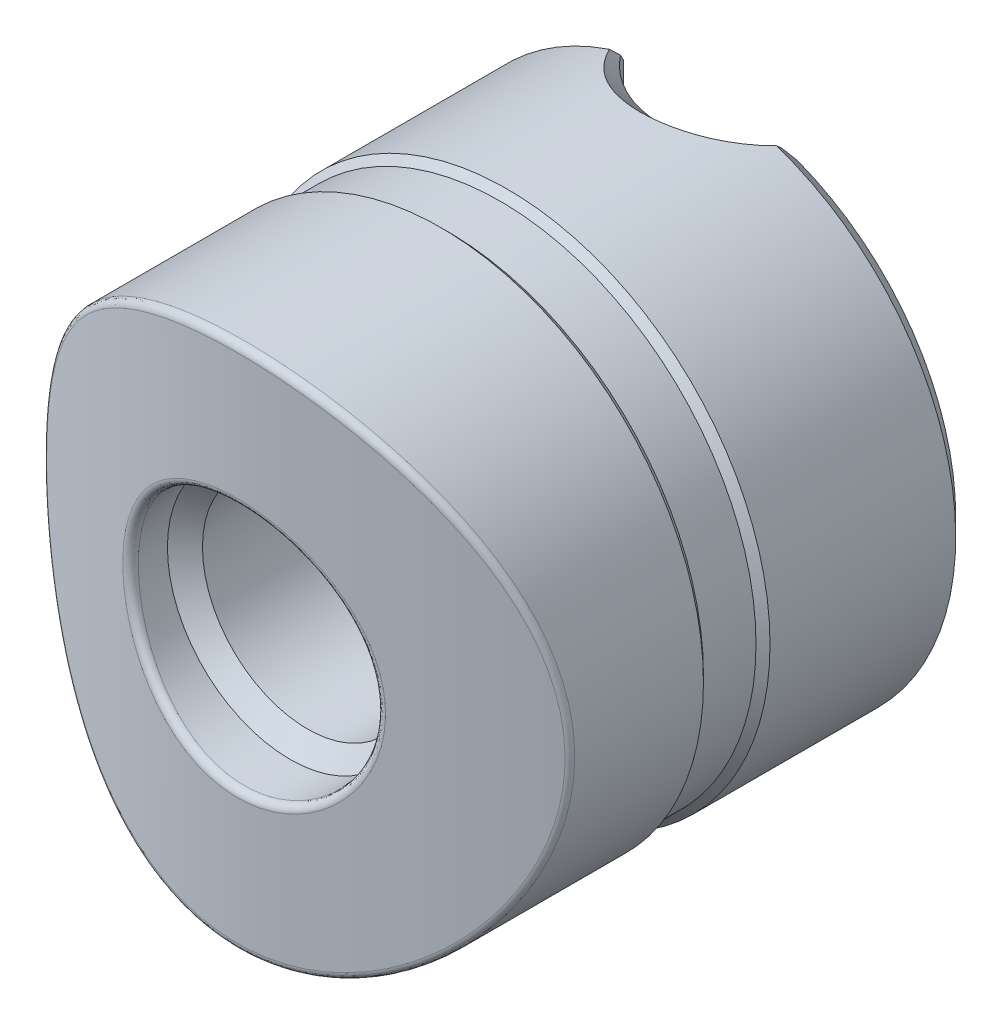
ISO-10303-21;
HEADER;
FILE_DESCRIPTION(('STEP AP214'),'2;1');
FILE_NAME('part.step','',(''),(''),'','','');
FILE_SCHEMA(('AUTOMOTIVE_DESIGN { 1 0 10303 214 1 1 1 1 }'));
ENDSEC;
DATA;
#1=APPLICATION_CONTEXT('core data for automotive mechanical design processes');
#2=APPLICATION_PROTOCOL_DEFINITION('international standard','automotive_design',2000,#1);
#3=PRODUCT_CONTEXT('',#1,'mechanical');
#4=PRODUCT('Part','Part','',(#3));
#5=PRODUCT_RELATED_PRODUCT_CATEGORY('part','',(#4));
#6=PRODUCT_DEFINITION_FORMATION('','',#4);
#7=PRODUCT_DEFINITION_CONTEXT('part definition',#1,'design');
#8=PRODUCT_DEFINITION('design','',#6,#7);
#9=PRODUCT_DEFINITION_SHAPE('','',#8);
#10=(LENGTH_UNIT() NAMED_UNIT(*) SI_UNIT(.MILLI.,.METRE.));
#11=(NAMED_UNIT(*) PLANE_ANGLE_UNIT() SI_UNIT($,.RADIAN.));
#12=(NAMED_UNIT(*) SI_UNIT($,.STERADIAN.) SOLID_ANGLE_UNIT());
#13=UNCERTAINTY_MEASURE_WITH_UNIT(LENGTH_MEASURE(1.E-05),#10,'distance_accuracy_value','');
#14=(GEOMETRIC_REPRESENTATION_CONTEXT(3) GLOBAL_UNCERTAINTY_ASSIGNED_CONTEXT((#13)) GLOBAL_UNIT_ASSIGNED_CONTEXT((#10,
#11,#12)) REPRESENTATION_CONTEXT('',''));
#15=CARTESIAN_POINT('',(0.,0.,0.));
#16=DIRECTION('',(0.,0.,1.));
#17=DIRECTION('',(1.,0.,0.));
#18=AXIS2_PLACEMENT_3D('',#15,#16,#17);
#19=CARTESIAN_POINT('',(0.,0.,7.));
#20=DIRECTION('',(0.,0.,-1.));
#21=DIRECTION('',(-1.,0.,0.));
#22=AXIS2_PLACEMENT_3D('',#19,#20,#21);
#23=CONICAL_SURFACE('',#22,2.5,0.785398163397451);
#24=CARTESIAN_POINT('',(0.,0.,6.));
#25=DIRECTION('',(0.,0.,-1.));
#26=DIRECTION('',(-1.,0.,0.));
#27=AXIS2_PLACEMENT_3D('',#24,#25,#26);
#28=CIRCLE('',#27,3.5);
#29=CARTESIAN_POINT('',(-3.5,0.,6.));
#30=VERTEX_POINT('',#29);
#31=EDGE_CURVE('E519',#30,#30,#28,.F.);
#32=ORIENTED_EDGE('',*,*,#31,.F.);
#33=EDGE_LOOP('',(#32));
#34=FACE_BOUND('',#33,.T.);
#35=CARTESIAN_POINT('',(0.,0.,6.5));
#36=DIRECTION('',(0.,0.,-1.));
#37=DIRECTION('',(-1.,0.,0.));
#38=AXIS2_PLACEMENT_3D('',#35,#36,#37);
#39=CIRCLE('',#38,3.);
#40=CARTESIAN_POINT('',(-3.,0.,6.5));
#41=VERTEX_POINT('',#40);
#42=EDGE_CURVE('E316',#41,#41,#39,.F.);
#43=ORIENTED_EDGE('',*,*,#42,.T.);
#44=EDGE_LOOP('',(#43));
#45=FACE_BOUND('',#44,.T.);
#46=ADVANCED_FACE('F14',(#34,#45),#23,.F.);
#47=CARTESIAN_POINT('',(0.,0.,13.5));
#48=DIRECTION('',(0.,0.,1.));
#49=DIRECTION('',(1.,0.,0.));
#50=AXIS2_PLACEMENT_3D('',#47,#48,#49);
#51=CONICAL_SURFACE('',#50,3.5,0.785398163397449);
#52=CARTESIAN_POINT('',(0.,0.,13.5));
#53=DIRECTION('',(0.,0.,-1.));
#54=DIRECTION('',(-1.,0.,0.));
#55=AXIS2_PLACEMENT_3D('',#52,#53,#54);
#56=CIRCLE('',#55,3.5);
#57=CARTESIAN_POINT('',(-3.5,0.,13.5));
#58=VERTEX_POINT('',#57);
#59=EDGE_CURVE('E269',#58,#58,#56,.T.);
#60=ORIENTED_EDGE('',*,*,#59,.F.);
#61=EDGE_LOOP('',(#60));
#62=FACE_BOUND('',#61,.T.);
#63=CARTESIAN_POINT('',(0.,0.,13.));
#64=DIRECTION('',(0.,0.,1.));
#65=DIRECTION('',(1.,0.,0.));
#66=AXIS2_PLACEMENT_3D('',#63,#64,#65);
#67=CIRCLE('',#66,3.);
#68=CARTESIAN_POINT('',(3.,0.,13.));
#69=VERTEX_POINT('',#68);
#70=EDGE_CURVE('E18',#69,#69,#67,.F.);
#71=ORIENTED_EDGE('',*,*,#70,.T.);
#72=EDGE_LOOP('',(#71));
#73=FACE_BOUND('',#72,.T.);
#74=ADVANCED_FACE('F298',(#62,#73),#51,.F.);
#75=CARTESIAN_POINT('',(0.,0.,0.));
#76=DIRECTION('',(0.,0.,-1.));
#77=DIRECTION('',(-1.,0.,0.));
#78=AXIS2_PLACEMENT_3D('',#75,#76,#77);
#79=CYLINDRICAL_SURFACE('',#78,7.5);
#80=CARTESIAN_POINT('',(0.,0.,2.));
#81=DIRECTION('',(0.,0.,1.));
#82=DIRECTION('',(1.,0.,0.));
#83=AXIS2_PLACEMENT_3D('',#80,#81,#82);
#84=CIRCLE('',#83,7.5);
#85=CARTESIAN_POINT('',(4.03112887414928,-6.32455532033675,2.));
#86=VERTEX_POINT('',#85);
#87=CARTESIAN_POINT('',(2.38326492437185,7.11126207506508,2.));
#88=VERTEX_POINT('',#87);
#89=EDGE_CURVE('E99',#86,#88,#84,.T.);
#90=ORIENTED_EDGE('',*,*,#89,.T.);
#91=CARTESIAN_POINT('',(2.62479859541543,7.0256979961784,1.50508494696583));
#92=CARTESIAN_POINT('',(2.5865155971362,7.03999046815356,1.60058989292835));
#93=CARTESIAN_POINT('',(2.54447010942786,7.0553519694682,1.69443840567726));
#94=CARTESIAN_POINT('',(2.45287910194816,7.0877205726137,1.87821342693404));
#95=CARTESIAN_POINT('',(2.40332670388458,7.10472917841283,1.96813624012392));
#96=CARTESIAN_POINT('',(2.29645897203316,7.13998965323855,2.14386185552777));
#97=CARTESIAN_POINT('',(2.23909360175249,7.15824912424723,2.22963282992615));
#98=CARTESIAN_POINT('',(2.11698242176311,7.19530798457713,2.39554712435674));
#99=CARTESIAN_POINT('',(2.05223991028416,7.2141071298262,2.47569293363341));
#100=CARTESIAN_POINT('',(1.87511088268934,7.26269033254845,2.67487616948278));
#101=CARTESIAN_POINT('',(1.75710922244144,7.29242789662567,2.78904242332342));
#102=CARTESIAN_POINT('',(1.5038047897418,7.34883025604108,2.99652151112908));
#103=CARTESIAN_POINT('',(1.36855634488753,7.37550422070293,3.08989740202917));
#104=CARTESIAN_POINT('',(1.10603480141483,7.41898680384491,3.23799438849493));
#105=CARTESIAN_POINT('',(0.98108006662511,7.43669556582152,3.29654092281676));
#106=CARTESIAN_POINT('',(0.722656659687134,7.4662330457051,3.3928315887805));
#107=CARTESIAN_POINT('',(0.589190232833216,7.47806330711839,3.43058118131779));
#108=CARTESIAN_POINT('',(0.316678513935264,7.49455843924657,3.48294585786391));
#109=CARTESIAN_POINT('',(0.177611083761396,7.49919126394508,3.49745748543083));
#110=CARTESIAN_POINT('',(-0.100947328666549,7.50061282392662,3.50192676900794));
#111=CARTESIAN_POINT('',(-0.240438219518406,7.49740314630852,3.49188939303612));
#112=CARTESIAN_POINT('',(-0.504664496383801,7.48408291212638,3.44972987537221));
#113=CARTESIAN_POINT('',(-0.629713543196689,7.47451770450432,3.41935163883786));
#114=CARTESIAN_POINT('',(-0.873203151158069,7.45000042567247,3.34010046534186));
#115=CARTESIAN_POINT('',(-0.991642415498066,7.4350473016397,3.29122391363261));
#116=CARTESIAN_POINT('',(-1.22732256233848,7.39992000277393,3.17353001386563));
#117=CARTESIAN_POINT('',(-1.34396480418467,7.37946567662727,3.10360658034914));
#118=CARTESIAN_POINT('',(-1.56579987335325,7.33560379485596,2.94828796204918));
#119=CARTESIAN_POINT('',(-1.67098597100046,7.31219452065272,2.86288376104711));
#120=CARTESIAN_POINT('',(-1.88684117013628,7.2597717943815,2.66279933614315));
#121=CARTESIAN_POINT('',(-1.99512143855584,7.23050525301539,2.54561514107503));
#122=CARTESIAN_POINT('',(-2.19406644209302,7.17264387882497,2.29701056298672));
#123=CARTESIAN_POINT('',(-2.28472519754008,7.14404927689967,2.16558537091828));
#124=CARTESIAN_POINT('',(-2.41622919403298,7.10032346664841,1.9450058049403));
#125=CARTESIAN_POINT('',(-2.46272097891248,7.08428718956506,1.8593311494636));
#126=CARTESIAN_POINT('',(-2.54885152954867,7.05375161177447,1.68463010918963));
#127=CARTESIAN_POINT('',(-2.58850827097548,7.03924831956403,1.59561328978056));
#128=CARTESIAN_POINT('',(-2.62479859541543,7.0256979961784,1.50508494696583));
#129=B_SPLINE_CURVE_WITH_KNOTS('',3,(#91,#92,#93,#94,#95,#96,#97,#98,#99,#100,#101,#102,#103,
#104,#105,#106,#107,#108,#109,#110,#111,#112,#113,#114,#115,#116,#117,#118,#119,#120,#121,#122,
#123,#124,#125,#126,#127,#128),.UNSPECIFIED.,.F.,.F.,(4,2,2,2,2,2,2,2,2,2,2,2,2,2,2,2,2,2,4),
(0.,0.311568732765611,0.623424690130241,0.937381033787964,1.25119755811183,1.74970535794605,
2.24667994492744,2.66230551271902,3.07782189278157,3.49518307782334,3.91245980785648,
4.29789120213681,4.68339795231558,5.0944310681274,5.50570434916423,5.99059584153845,
6.47565159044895,6.77173251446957,7.06702247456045),.UNSPECIFIED.);
#130=CARTESIAN_POINT('',(-2.38326492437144,7.11126207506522,2.));
#131=VERTEX_POINT('',#130);
#132=EDGE_CURVE('E29',#88,#131,#129,.T.);
#133=ORIENTED_EDGE('',*,*,#132,.T.);
#134=CARTESIAN_POINT('',(-4.03112887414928,-6.32455532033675,2.));
#135=VERTEX_POINT('',#134);
#136=EDGE_CURVE('E528',#131,#135,#84,.T.);
#137=ORIENTED_EDGE('',*,*,#136,.T.);
#138=CARTESIAN_POINT('',(-4.03112887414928,-6.32455532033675,2.));
#139=CARTESIAN_POINT('',(-3.97217989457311,-6.36213382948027,2.11879587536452));
#140=CARTESIAN_POINT('',(-3.90826775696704,-6.40170675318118,2.23444443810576));
#141=CARTESIAN_POINT('',(-3.77103809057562,-6.48348869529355,2.45898306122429));
#142=CARTESIAN_POINT('',(-3.69772380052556,-6.52569680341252,2.56787542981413));
#143=CARTESIAN_POINT('',(-3.54191792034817,-6.61156272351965,2.77886076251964));
#144=CARTESIAN_POINT('',(-3.45939740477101,-6.65522478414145,2.88093058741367));
#145=CARTESIAN_POINT('',(-3.28577765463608,-6.74263375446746,3.07747636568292));
#146=CARTESIAN_POINT('',(-3.19467752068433,-6.78638067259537,3.17195152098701));
#147=CARTESIAN_POINT('',(-3.00432201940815,-6.8727702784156,3.35280170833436));
#148=CARTESIAN_POINT('',(-2.90506862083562,-6.91541322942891,3.43917868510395));
#149=CARTESIAN_POINT('',(-2.69880779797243,-6.99848518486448,3.60330447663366));
#150=CARTESIAN_POINT('',(-2.5918010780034,-7.03891438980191,3.68105407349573));
#151=CARTESIAN_POINT('',(-2.37059157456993,-7.11646123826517,3.82725193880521));
#152=CARTESIAN_POINT('',(-2.25639420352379,-7.15358132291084,3.89570708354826));
#153=CARTESIAN_POINT('',(-2.02141062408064,-7.22349716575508,4.02265043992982));
#154=CARTESIAN_POINT('',(-1.90062868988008,-7.25629568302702,4.08114501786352));
#155=CARTESIAN_POINT('',(-1.65826094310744,-7.31540057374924,4.18531341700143));
#156=CARTESIAN_POINT('',(-1.53691038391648,-7.34191772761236,4.23141400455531));
#157=CARTESIAN_POINT('',(-1.28973873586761,-7.3893434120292,4.31317813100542));
#158=CARTESIAN_POINT('',(-1.16392008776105,-7.41025495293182,4.34884727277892));
#159=CARTESIAN_POINT('',(-0.908886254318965,-7.44583719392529,4.40920467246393));
#160=CARTESIAN_POINT('',(-0.77967318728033,-7.46051169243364,4.43389961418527));
#161=CARTESIAN_POINT('',(-0.519009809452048,-7.48316330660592,4.47190874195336));
#162=CARTESIAN_POINT('',(-0.38755984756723,-7.49114145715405,4.48522468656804));
#163=CARTESIAN_POINT('',(-0.142052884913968,-7.49951700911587,4.49919755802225));
#164=CARTESIAN_POINT('',(-0.0281086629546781,-7.5008113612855,4.50135242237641));
#165=CARTESIAN_POINT('',(0.199593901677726,-7.4982083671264,4.49701369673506));
#166=CARTESIAN_POINT('',(0.313352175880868,-7.49430941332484,4.49051742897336));
#167=CARTESIAN_POINT('',(0.539703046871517,-7.48141416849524,4.46896340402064));
#168=CARTESIAN_POINT('',(0.652296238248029,-7.47242062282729,4.45391025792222));
#169=CARTESIAN_POINT('',(0.875560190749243,-7.44956499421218,4.41545582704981));
#170=CARTESIAN_POINT('',(0.986230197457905,-7.4357010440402,4.39205134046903));
#171=CARTESIAN_POINT('',(1.30578935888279,-7.38849843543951,4.31181911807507));
#172=CARTESIAN_POINT('',(1.51114954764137,-7.34899009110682,4.24407168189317));
#173=CARTESIAN_POINT('',(1.90734162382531,-7.25628012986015,4.08142639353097));
#174=CARTESIAN_POINT('',(2.09816826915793,-7.20307360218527,3.98651880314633));
#175=CARTESIAN_POINT('',(2.47980137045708,-7.08127170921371,3.76219709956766));
#176=CARTESIAN_POINT('',(2.66886190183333,-7.01169145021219,3.6303515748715));
#177=CARTESIAN_POINT('',(3.02336553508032,-6.86629640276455,3.34091422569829));
#178=CARTESIAN_POINT('',(3.18879990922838,-6.79047932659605,3.18331293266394));
#179=CARTESIAN_POINT('',(3.47819237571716,-6.64646697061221,2.86249346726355));
#180=CARTESIAN_POINT('',(3.60467010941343,-6.57829391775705,2.70153974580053));
#181=CARTESIAN_POINT('',(3.77753950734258,-6.47955304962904,2.44758501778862));
#182=CARTESIAN_POINT('',(3.83233362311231,-6.4472398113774,2.36088846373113));
#183=CARTESIAN_POINT('',(3.93613355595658,-6.38439756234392,2.18343961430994));
#184=CARTESIAN_POINT('',(3.98513753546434,-6.35386911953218,2.09268604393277));
#185=CARTESIAN_POINT('',(4.03112887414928,-6.32455532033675,2.));
#186=B_SPLINE_CURVE_WITH_KNOTS('',3,(#138,#139,#140,#141,#142,#143,#144,#145,#146,#147,#148,
#149,#150,#151,#152,#153,#154,#155,#156,#157,#158,#159,#160,#161,#162,#163,#164,#165,#166,#167,
#168,#169,#170,#171,#172,#173,#174,#175,#176,#177,#178,#179,#180,#181,#182,#183,#184,#185),
.UNSPECIFIED.,.F.,.F.,(4,2,2,2,2,2,2,2,2,2,2,2,2,2,2,2,2,2,2,2,2,2,2,4),(0.,0.413312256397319,
0.82648252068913,1.24098958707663,1.65554015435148,2.06999091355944,2.48440407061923,
2.8985089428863,3.31234813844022,3.70924855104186,4.10593538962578,4.50238029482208,
4.898763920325,5.24024428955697,5.58183038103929,5.92323257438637,6.26476579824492,
6.92121916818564,7.57790820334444,8.29737601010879,9.01710891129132,9.66244663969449,
9.98482166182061,10.3072987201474),.UNSPECIFIED.);
#187=EDGE_CURVE('E262',#135,#86,#186,.T.);
#188=ORIENTED_EDGE('',*,*,#187,.T.);
#189=EDGE_LOOP('',(#90,#133,#137,#188));
#190=FACE_BOUND('',#189,.T.);
#191=CARTESIAN_POINT('',(0.,0.,7.3));
#192=DIRECTION('',(0.,0.,1.));
#193=DIRECTION('',(1.,0.,0.));
#194=AXIS2_PLACEMENT_3D('',#191,#192,#193);
#195=CIRCLE('',#194,7.5);
#196=CARTESIAN_POINT('',(7.5,0.,7.3));
#197=VERTEX_POINT('',#196);
#198=EDGE_CURVE('E92',#197,#197,#195,.T.);
#199=ORIENTED_EDGE('',*,*,#198,.F.);
#200=EDGE_LOOP('',(#199));
#201=FACE_BOUND('',#200,.T.);
#202=ADVANCED_FACE('F191',(#190,#201),#79,.T.);
#203=CARTESIAN_POINT('',(0.,0.,0.));
#204=DIRECTION('',(0.,-1.,0.));
#205=DIRECTION('',(1.,0.,0.));
#206=AXIS2_PLACEMENT_3D('',#203,#204,#205);
#207=CYLINDRICAL_SURFACE('',#206,4.5);
#208=DIRECTION('',(0.,-1.,0.));
#209=VECTOR('',#208,1.);
#210=CARTESIAN_POINT('',(-4.24264068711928,0.,1.5));
#211=LINE('',#210,#209);
#212=CARTESIAN_POINT('',(-4.24264068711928,4.28179093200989,1.5));
#213=VERTEX_POINT('',#212);
#214=CARTESIAN_POINT('',(-4.24264068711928,-5.56776436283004,1.5));
#215=VERTEX_POINT('',#214);
#216=EDGE_CURVE('E256',#213,#215,#211,.T.);
#217=ORIENTED_EDGE('',*,*,#216,.F.);
#218=CARTESIAN_POINT('',(0.,4.28179093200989,0.));
#219=DIRECTION('',(0.,-1.,0.));
#220=DIRECTION('',(1.,0.,0.));
#221=AXIS2_PLACEMENT_3D('',#218,#219,#220);
#222=CIRCLE('',#221,4.5);
#223=CARTESIAN_POINT('',(4.24264068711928,4.28179093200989,1.5));
#224=VERTEX_POINT('',#223);
#225=EDGE_CURVE('E240',#213,#224,#222,.F.);
#226=ORIENTED_EDGE('',*,*,#225,.T.);
#227=DIRECTION('',(0.,-1.,0.));
#228=VECTOR('',#227,1.);
#229=CARTESIAN_POINT('',(4.24264068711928,0.,1.5));
#230=LINE('',#229,#228);
#231=CARTESIAN_POINT('',(4.24264068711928,-5.56776436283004,1.5));
#232=VERTEX_POINT('',#231);
#233=EDGE_CURVE('E37',#232,#224,#230,.F.);
#234=ORIENTED_EDGE('',*,*,#233,.F.);
#235=CARTESIAN_POINT('',(4.40440897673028,-1.24652233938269,-0.92259501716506));
#236=CARTESIAN_POINT('',(4.40971881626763,-1.32076669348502,-0.897262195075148));
#237=CARTESIAN_POINT('',(4.41511334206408,-1.39446198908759,-0.870403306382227));
#238=CARTESIAN_POINT('',(4.42583888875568,-1.54083600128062,-0.814103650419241));
#239=CARTESIAN_POINT('',(4.43116993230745,-1.61351508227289,-0.784663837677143));
#240=CARTESIAN_POINT('',(4.44671274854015,-1.83006272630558,-0.693219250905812));
#241=CARTESIAN_POINT('',(4.45648768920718,-1.97261463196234,-0.628027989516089));
#242=CARTESIAN_POINT('',(4.47356975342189,-2.25483728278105,-0.491826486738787));
#243=CARTESIAN_POINT('',(4.48087939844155,-2.3945108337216,-0.420822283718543));
#244=CARTESIAN_POINT('',(4.49221232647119,-2.67182491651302,-0.274609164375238));
#245=CARTESIAN_POINT('',(4.49623456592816,-2.80946478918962,-0.199398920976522));
#246=CARTESIAN_POINT('',(4.5004140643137,-3.08270729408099,-0.0461890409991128));
#247=CARTESIAN_POINT('',(4.50058261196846,-3.21831471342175,0.0318017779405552));
#248=CARTESIAN_POINT('',(4.49668491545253,-3.48817854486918,0.189957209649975));
#249=CARTESIAN_POINT('',(4.49261903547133,-3.62243507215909,0.270121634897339));
#250=CARTESIAN_POINT('',(4.47995009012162,-3.88976360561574,0.432020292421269));
#251=CARTESIAN_POINT('',(4.47134748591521,-4.0228357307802,0.513754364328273));
#252=CARTESIAN_POINT('',(4.44935458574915,-4.28788578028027,0.678333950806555));
#253=CARTESIAN_POINT('',(4.43596458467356,-4.41986377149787,0.761179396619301));
#254=CARTESIAN_POINT('',(4.41049705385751,-4.63043186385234,0.894493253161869));
#255=CARTESIAN_POINT('',(4.40001772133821,-4.7093670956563,0.944726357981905));
#256=CARTESIAN_POINT('',(4.37719429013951,-4.86683164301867,1.04538653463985));
#257=CARTESIAN_POINT('',(4.36485037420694,-4.94536099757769,1.09581358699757));
#258=CARTESIAN_POINT('',(4.32494947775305,-5.18031882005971,1.24728362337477));
#259=CARTESIAN_POINT('',(4.29452059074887,-5.33614008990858,1.34853011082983));
#260=CARTESIAN_POINT('',(4.22591397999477,-5.64451482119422,1.5501240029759));
#261=CARTESIAN_POINT('',(4.18781128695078,-5.79708521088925,1.65047097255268));
#262=CARTESIAN_POINT('',(4.10323471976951,-6.10014128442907,1.85075111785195));
#263=CARTESIAN_POINT('',(4.05676150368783,-6.25062713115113,1.95068432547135));
#264=CARTESIAN_POINT('',(3.93634197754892,-6.60358668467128,2.18597692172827));
#265=CARTESIAN_POINT('',(3.85855538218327,-6.80502346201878,2.32097659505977));
#266=CARTESIAN_POINT('',(3.72817886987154,-7.10277963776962,2.52131632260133));
#267=CARTESIAN_POINT('',(3.68240338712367,-7.20136055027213,2.58777834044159));
#268=CARTESIAN_POINT('',(3.58601621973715,-7.39679792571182,2.71977066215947));
#269=CARTESIAN_POINT('',(3.5354035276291,-7.49365402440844,2.78530076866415));
#270=CARTESIAN_POINT('',(3.48224290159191,-7.58952127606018,2.8502604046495));
#271=B_SPLINE_CURVE_WITH_KNOTS('',3,(#235,#236,#237,#238,#239,#240,#241,#242,#243,#244,#245,
#246,#247,#248,#249,#250,#251,#252,#253,#254,#255,#256,#257,#258,#259,#260,#261,#262,#263,#264,
#265,#266,#267,#268,#269,#270),.UNSPECIFIED.,.F.,.F.,(4,2,2,2,2,2,2,2,2,2,2,2,2,2,2,2,2,4),(0.,
0.235832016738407,0.471577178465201,0.942516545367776,1.41297277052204,1.883578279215,
2.35280505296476,2.82199147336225,3.29113020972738,3.76024005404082,4.04266771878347,
4.32506772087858,4.88978549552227,5.44922866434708,6.00862787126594,6.77185941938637,
7.15396729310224,7.53615492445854),.UNSPECIFIED.);
#272=EDGE_CURVE('E135',#232,#86,#271,.T.);
#273=ORIENTED_EDGE('',*,*,#272,.T.);
#274=ORIENTED_EDGE('',*,*,#187,.F.);
#275=CARTESIAN_POINT('',(-3.48224290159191,-7.58952127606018,2.8502604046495));
#276=CARTESIAN_POINT('',(-3.5354035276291,-7.49365402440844,2.78530076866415));
#277=CARTESIAN_POINT('',(-3.58601621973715,-7.39679792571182,2.71977066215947));
#278=CARTESIAN_POINT('',(-3.68240338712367,-7.20136055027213,2.58777834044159));
#279=CARTESIAN_POINT('',(-3.72817886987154,-7.10277963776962,2.52131632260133));
#280=CARTESIAN_POINT('',(-3.85855538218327,-6.80502346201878,2.32097659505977));
#281=CARTESIAN_POINT('',(-3.93634197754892,-6.60358668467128,2.18597692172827));
#282=CARTESIAN_POINT('',(-4.05676150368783,-6.25062713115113,1.95068432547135));
#283=CARTESIAN_POINT('',(-4.10323471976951,-6.10014128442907,1.85075111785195));
#284=CARTESIAN_POINT('',(-4.18781128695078,-5.79708521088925,1.65047097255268));
#285=CARTESIAN_POINT('',(-4.22591397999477,-5.64451482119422,1.5501240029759));
#286=CARTESIAN_POINT('',(-4.29452059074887,-5.33614008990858,1.34853011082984));
#287=CARTESIAN_POINT('',(-4.32494947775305,-5.18031882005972,1.24728362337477));
#288=CARTESIAN_POINT('',(-4.36485037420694,-4.94536099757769,1.09581358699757));
#289=CARTESIAN_POINT('',(-4.37719429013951,-4.86683164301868,1.04538653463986));
#290=CARTESIAN_POINT('',(-4.40001772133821,-4.70936709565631,0.944726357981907));
#291=CARTESIAN_POINT('',(-4.41049705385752,-4.63043186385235,0.894493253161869));
#292=CARTESIAN_POINT('',(-4.43596458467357,-4.41986377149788,0.761179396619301));
#293=CARTESIAN_POINT('',(-4.44935458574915,-4.28788578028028,0.678333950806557));
#294=CARTESIAN_POINT('',(-4.47134748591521,-4.0228357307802,0.513754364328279));
#295=CARTESIAN_POINT('',(-4.47995009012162,-3.88976360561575,0.432020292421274));
#296=CARTESIAN_POINT('',(-4.49261903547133,-3.6224350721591,0.270121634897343));
#297=CARTESIAN_POINT('',(-4.49668491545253,-3.48817854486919,0.18995720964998));
#298=CARTESIAN_POINT('',(-4.50058261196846,-3.21831471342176,0.0318017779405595));
#299=CARTESIAN_POINT('',(-4.5004140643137,-3.082707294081,-0.0461890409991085));
#300=CARTESIAN_POINT('',(-4.49623456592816,-2.80946478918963,-0.199398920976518));
#301=CARTESIAN_POINT('',(-4.49221232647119,-2.67182491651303,-0.274609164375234));
#302=CARTESIAN_POINT('',(-4.48087939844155,-2.3945108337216,-0.420822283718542));
#303=CARTESIAN_POINT('',(-4.47356975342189,-2.25483728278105,-0.491826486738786));
#304=CARTESIAN_POINT('',(-4.45648768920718,-1.97261463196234,-0.628027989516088));
#305=CARTESIAN_POINT('',(-4.44671274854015,-1.83006272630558,-0.69321925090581));
#306=CARTESIAN_POINT('',(-4.43116993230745,-1.61351508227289,-0.784663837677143));
#307=CARTESIAN_POINT('',(-4.42583888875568,-1.54083600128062,-0.814103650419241));
#308=CARTESIAN_POINT('',(-4.41511334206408,-1.39446198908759,-0.870403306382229));
#309=CARTESIAN_POINT('',(-4.40971881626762,-1.32076669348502,-0.897262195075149));
#310=CARTESIAN_POINT('',(-4.40440897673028,-1.24652233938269,-0.92259501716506));
#311=B_SPLINE_CURVE_WITH_KNOTS('',3,(#275,#276,#277,#278,#279,#280,#281,#282,#283,#284,#285,
#286,#287,#288,#289,#290,#291,#292,#293,#294,#295,#296,#297,#298,#299,#300,#301,#302,#303,#304,
#305,#306,#307,#308,#309,#310),.UNSPECIFIED.,.F.,.F.,(4,2,2,2,2,2,2,2,2,2,2,2,2,2,2,2,2,4),(0.,
0.382187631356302,0.764295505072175,1.5275270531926,2.08692626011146,2.64636942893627,
3.21108720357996,3.49348720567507,3.77591487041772,4.24502471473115,4.71416345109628,
5.18334987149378,5.65257664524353,6.12318215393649,6.59363837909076,7.06457774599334,
7.30032290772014,7.53615492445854),.UNSPECIFIED.);
#312=EDGE_CURVE('E142',#135,#215,#311,.T.);
#313=ORIENTED_EDGE('',*,*,#312,.T.);
#314=EDGE_LOOP('',(#217,#226,#234,#273,#274,#313));
#315=FACE_BOUND('',#314,.T.);
#316=CARTESIAN_POINT('',(-4.,0.,2.06155281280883));
#317=CARTESIAN_POINT('',(-3.99999429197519,0.123939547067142,2.06157232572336));
#318=CARTESIAN_POINT('',(-3.99416510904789,0.247911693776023,2.07299393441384));
#319=CARTESIAN_POINT('',(-3.97159323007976,0.491476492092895,2.11588343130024));
#320=CARTESIAN_POINT('',(-3.95481316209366,0.611052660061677,2.14741995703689));
#321=CARTESIAN_POINT('',(-3.91760247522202,0.812343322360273,2.21437033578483));
#322=CARTESIAN_POINT('',(-3.89934762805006,0.895632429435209,2.24649278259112));
#323=CARTESIAN_POINT('',(-3.85826702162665,1.05869992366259,2.31633692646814));
#324=CARTESIAN_POINT('',(-3.83543843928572,1.13847610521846,2.35406207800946));
#325=CARTESIAN_POINT('',(-3.78550385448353,1.29488343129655,2.43355095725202));
#326=CARTESIAN_POINT('',(-3.75838548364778,1.37150464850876,2.47532622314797));
#327=CARTESIAN_POINT('',(-3.70014161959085,1.52165512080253,2.56157495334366));
#328=CARTESIAN_POINT('',(-3.66901480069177,1.59518334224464,2.60604930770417));
#329=CARTESIAN_POINT('',(-3.58130252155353,1.78647274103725,2.72632565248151));
#330=CARTESIAN_POINT('',(-3.52136411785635,1.90176905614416,2.80362244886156));
#331=CARTESIAN_POINT('',(-3.39114903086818,2.12528470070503,2.95981072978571));
#332=CARTESIAN_POINT('',(-3.32086627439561,2.23349981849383,3.03870312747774));
#333=CARTESIAN_POINT('',(-3.17001834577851,2.44286809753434,3.1957508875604));
#334=CARTESIAN_POINT('',(-3.08946448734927,2.54402884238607,3.27390696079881));
#335=CARTESIAN_POINT('',(-2.91793880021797,2.73906738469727,3.42766790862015));
#336=CARTESIAN_POINT('',(-2.82697193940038,2.83294861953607,3.50327397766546));
#337=CARTESIAN_POINT('',(-2.58382266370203,3.06010546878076,3.68889708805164));
#338=CARTESIAN_POINT('',(-2.42455638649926,3.18821894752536,3.79616515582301));
#339=CARTESIAN_POINT('',(-2.08155060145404,3.42200042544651,3.9945344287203));
#340=CARTESIAN_POINT('',(-1.89785402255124,3.52770697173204,4.08566335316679));
#341=CARTESIAN_POINT('',(-1.54518043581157,3.69359930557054,4.22981526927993));
#342=CARTESIAN_POINT('',(-1.38015066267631,3.75862845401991,4.28679531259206));
#343=CARTESIAN_POINT('',(-1.12369897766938,3.83997093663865,4.35835001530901));
#344=CARTESIAN_POINT('',(-1.03670531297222,3.86438939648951,4.37988638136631));
#345=CARTESIAN_POINT('',(-0.860240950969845,3.9074569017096,4.41793123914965));
#346=CARTESIAN_POINT('',(-0.770771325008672,3.92610840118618,4.43444186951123));
#347=CARTESIAN_POINT('',(-0.58939511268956,3.95741540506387,4.46218376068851));
#348=CARTESIAN_POINT('',(-0.497476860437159,3.97003303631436,4.47338167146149));
#349=CARTESIAN_POINT('',(-0.312511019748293,3.98885631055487,4.49009531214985));
#350=CARTESIAN_POINT('',(-0.219463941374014,3.99506474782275,4.49561351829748));
#351=CARTESIAN_POINT('',(-0.0329933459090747,4.00095084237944,4.50084496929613));
#352=CARTESIAN_POINT('',(0.0604301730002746,4.00062846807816,4.50055818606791));
#353=CARTESIAN_POINT('',(0.246799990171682,3.99346995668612,4.49419637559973));
#354=CARTESIAN_POINT('',(0.339746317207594,3.98663421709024,4.48812170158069));
#355=CARTESIAN_POINT('',(0.599724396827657,3.95836711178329,4.46302477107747));
#356=CARTESIAN_POINT('',(0.76541900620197,3.92958169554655,4.43748599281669));
#357=CARTESIAN_POINT('',(1.08847850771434,3.85264575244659,4.36950350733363));
#358=CARTESIAN_POINT('',(1.24584134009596,3.80449046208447,4.32705564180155));
#359=CARTESIAN_POINT('',(1.55880397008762,3.68777635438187,4.22478967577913));
#360=CARTESIAN_POINT('',(1.71370522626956,3.61814834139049,4.16406677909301));
#361=CARTESIAN_POINT('',(2.00909427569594,3.46286598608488,4.02988000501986));
#362=CARTESIAN_POINT('',(2.14957890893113,3.37720814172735,3.95641334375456));
#363=CARTESIAN_POINT('',(2.48506371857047,3.14408418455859,3.7589290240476));
#364=CARTESIAN_POINT('',(2.67021936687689,2.98770109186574,3.62854843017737));
#365=CARTESIAN_POINT('',(2.92187832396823,2.7343942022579,3.42409900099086));
#366=CARTESIAN_POINT('',(3.00160123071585,2.64656991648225,3.35426577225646));
#367=CARTESIAN_POINT('',(3.15239285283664,2.46502052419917,3.21295257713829));
#368=CARTESIAN_POINT('',(3.22346495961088,2.3712977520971,3.14147326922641));
#369=CARTESIAN_POINT('',(3.3586314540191,2.17579090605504,2.99660561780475));
#370=CARTESIAN_POINT('',(3.42251874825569,2.07386779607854,2.92321243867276));
#371=CARTESIAN_POINT('',(3.54136615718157,1.86368309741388,2.77804242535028));
#372=CARTESIAN_POINT('',(3.59631939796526,1.75541671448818,2.70626687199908));
#373=CARTESIAN_POINT('',(3.69676359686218,1.53258278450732,2.56734106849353));
#374=CARTESIAN_POINT('',(3.74230108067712,1.41804993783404,2.50016922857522));
#375=CARTESIAN_POINT('',(3.8235965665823,1.18141017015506,2.37396586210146));
#376=CARTESIAN_POINT('',(3.85937279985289,1.05931789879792,2.31491926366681));
#377=CARTESIAN_POINT('',(3.91535936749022,0.825872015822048,2.2186905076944));
#378=CARTESIAN_POINT('',(3.93711232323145,0.715724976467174,2.17954652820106));
#379=CARTESIAN_POINT('',(3.971503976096,0.490006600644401,2.1162407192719));
#380=CARTESIAN_POINT('',(3.98417271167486,0.374454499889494,2.0920295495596));
#381=CARTESIAN_POINT('',(3.99934696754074,0.138784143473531,2.06289699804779));
#382=CARTESIAN_POINT('',(4.00173705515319,0.0186292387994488,2.05819472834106));
#383=CARTESIAN_POINT('',(3.99571686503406,-0.220448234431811,2.06984726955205));
#384=CARTESIAN_POINT('',(3.98729233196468,-0.339368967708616,2.08622987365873));
#385=CARTESIAN_POINT('',(3.95785418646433,-0.596181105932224,2.14161375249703));
#386=CARTESIAN_POINT('',(3.93459682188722,-0.732907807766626,2.18459301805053));
#387=CARTESIAN_POINT('',(3.87601598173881,-0.997505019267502,2.28690867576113));
#388=CARTESIAN_POINT('',(3.84064643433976,-1.1253394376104,2.34630735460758));
#389=CARTESIAN_POINT('',(3.76306617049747,-1.36136475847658,2.46862734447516));
#390=CARTESIAN_POINT('',(3.72176251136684,-1.47028686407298,2.53074525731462));
#391=CARTESIAN_POINT('',(3.6309798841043,-1.68204231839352,2.65935871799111));
#392=CARTESIAN_POINT('',(3.58149460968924,-1.78487088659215,2.7258576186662));
#393=CARTESIAN_POINT('',(3.47453279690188,-1.98507304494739,2.86095518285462));
#394=CARTESIAN_POINT('',(3.41704459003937,-2.0824383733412,2.92955679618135));
#395=CARTESIAN_POINT('',(3.29419189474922,-2.2717900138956,3.06705098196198));
#396=CARTESIAN_POINT('',(3.22882962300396,-2.36377782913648,3.13594346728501));
#397=CARTESIAN_POINT('',(3.08511970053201,-2.54887021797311,3.27764319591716));
#398=CARTESIAN_POINT('',(3.00617418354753,-2.64157229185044,3.35037216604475));
#399=CARTESIAN_POINT('',(2.8389880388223,-2.8204857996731,3.49317067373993));
#400=CARTESIAN_POINT('',(2.75074534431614,-2.90669578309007,3.56323961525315));
#401=CARTESIAN_POINT('',(2.56510319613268,-3.07174502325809,3.69911223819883));
#402=CARTESIAN_POINT('',(2.4677289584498,-3.15060344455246,3.76492686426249));
#403=CARTESIAN_POINT('',(2.26368810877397,-3.30026413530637,3.89103111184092));
#404=CARTESIAN_POINT('',(2.15702230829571,-3.37106710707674,3.95132121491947));
#405=CARTESIAN_POINT('',(1.89222850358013,-3.52863794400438,4.08644950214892));
#406=CARTESIAN_POINT('',(1.72991628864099,-3.61128836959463,4.15814299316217));
#407=CARTESIAN_POINT('',(1.47494392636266,-3.71928643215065,4.25238633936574));
#408=CARTESIAN_POINT('',(1.38801185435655,-3.75262940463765,4.2815904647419));
#409=CARTESIAN_POINT('',(1.21068881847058,-3.81352912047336,4.33506519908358));
#410=CARTESIAN_POINT('',(1.12029958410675,-3.84108871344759,4.3593382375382));
#411=CARTESIAN_POINT('',(0.935787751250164,-3.89017933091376,4.40265386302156));
#412=CARTESIAN_POINT('',(0.841639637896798,-3.9116561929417,4.42164943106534));
#413=CARTESIAN_POINT('',(0.651097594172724,-3.94784350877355,4.45369481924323));
#414=CARTESIAN_POINT('',(0.554704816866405,-3.96255735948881,4.46674762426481));
#415=CARTESIAN_POINT('',(0.36049147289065,-3.98492121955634,4.48659899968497));
#416=CARTESIAN_POINT('',(0.262671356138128,-3.99257340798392,4.4933994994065));
#417=CARTESIAN_POINT('',(0.0665042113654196,-4.00065143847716,4.5005786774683));
#418=CARTESIAN_POINT('',(-0.031842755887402,-4.00107809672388,4.5009580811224));
#419=CARTESIAN_POINT('',(-0.216157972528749,-3.99508589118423,4.49563229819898));
#420=CARTESIAN_POINT('',(-0.302175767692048,-3.98949400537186,4.49066216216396));
#421=CARTESIAN_POINT('',(-0.473266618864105,-3.97283537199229,4.47586944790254));
#422=CARTESIAN_POINT('',(-0.558339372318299,-3.96176691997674,4.46604535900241));
#423=CARTESIAN_POINT('',(-0.81117899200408,-3.92059402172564,4.42954708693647));
#424=CARTESIAN_POINT('',(-0.976735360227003,-3.88251610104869,4.39584154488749));
#425=CARTESIAN_POINT('',(-1.29905391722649,-3.78695496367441,4.31167167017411));
#426=CARTESIAN_POINT('',(-1.45573124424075,-3.72931255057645,4.26106990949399));
#427=CARTESIAN_POINT('',(-1.75649823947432,-3.5974590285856,4.14616398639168));
#428=CARTESIAN_POINT('',(-1.90058218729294,-3.52324044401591,4.08185364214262));
#429=CARTESIAN_POINT('',(-2.24047984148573,-3.32200503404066,3.9092003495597));
#430=CARTESIAN_POINT('',(-2.42820612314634,-3.18668597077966,3.79448212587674));
#431=CARTESIAN_POINT('',(-2.68645530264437,-2.9657846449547,3.61167397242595));
#432=CARTESIAN_POINT('',(-2.76876818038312,-2.88901802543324,3.54883353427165));
#433=CARTESIAN_POINT('',(-2.92572291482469,-2.72994728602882,3.42058331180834));
#434=CARTESIAN_POINT('',(-3.00036584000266,-2.64764394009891,3.3551738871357));
#435=CARTESIAN_POINT('',(-3.14356577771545,-2.47603739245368,3.22145966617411));
#436=CARTESIAN_POINT('',(-3.21195707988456,-2.38662160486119,3.15312285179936));
#437=CARTESIAN_POINT('',(-3.34091431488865,-2.20248249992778,3.01614586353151));
#438=CARTESIAN_POINT('',(-3.40147811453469,-2.1077577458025,2.94750561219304));
#439=CARTESIAN_POINT('',(-3.5146917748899,-1.91301258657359,2.81153893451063));
#440=CARTESIAN_POINT('',(-3.56735200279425,-1.81299935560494,2.74421088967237));
#441=CARTESIAN_POINT('',(-3.66468343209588,-1.60718535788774,2.61280912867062));
#442=CARTESIAN_POINT('',(-3.7093596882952,-1.5013883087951,2.54873337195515));
#443=CARTESIAN_POINT('',(-3.79393041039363,-1.27363357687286,2.42124402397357));
#444=CARTESIAN_POINT('',(-3.83305970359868,-1.15107274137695,2.35838339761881));
#445=CARTESIAN_POINT('',(-3.90025526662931,-0.897302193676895,2.24551055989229));
#446=CARTESIAN_POINT('',(-3.92834640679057,-0.766112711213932,2.19546955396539));
#447=CARTESIAN_POINT('',(-3.96619343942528,-0.529041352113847,2.12614421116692));
#448=CARTESIAN_POINT('',(-3.97877292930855,-0.424989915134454,2.10230432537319));
#449=CARTESIAN_POINT('',(-3.9956699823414,-0.213962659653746,2.07001639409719));
#450=CARTESIAN_POINT('',(-4.00000492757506,-0.106993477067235,2.06153596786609));
#451=CARTESIAN_POINT('',(-4.,0.,2.06155281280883));
#452=B_SPLINE_CURVE_WITH_KNOTS('',3,(#316,#317,#318,#319,#320,#321,#322,#323,#324,#325,#326,
#327,#328,#329,#330,#331,#332,#333,#334,#335,#336,#337,#338,#339,#340,#341,#342,#343,#344,#345,
#346,#347,#348,#349,#350,#351,#352,#353,#354,#355,#356,#357,#358,#359,#360,#361,#362,#363,#364,
#365,#366,#367,#368,#369,#370,#371,#372,#373,#374,#375,#376,#377,#378,#379,#380,#381,#382,#383,
#384,#385,#386,#387,#388,#389,#390,#391,#392,#393,#394,#395,#396,#397,#398,#399,#400,#401,#402,
#403,#404,#405,#406,#407,#408,#409,#410,#411,#412,#413,#414,#415,#416,#417,#418,#419,#420,#421,
#422,#423,#424,#425,#426,#427,#428,#429,#430,#431,#432,#433,#434,#435,#436,#437,#438,#439,#440,
#441,#442,#443,#444,#445,#446,#447,#448,#449,#450,#451),.UNSPECIFIED.,.T.,.F.,(4,2,2,2,2,2,2,2,
2,2,2,2,2,2,2,2,2,2,2,2,2,2,2,2,2,2,2,2,2,2,2,2,2,2,2,2,2,2,2,2,2,2,2,2,2,2,2,2,2,2,2,2,2,2,2,2,
2,2,2,2,2,2,2,2,2,2,2,4),(0.,0.371336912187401,0.74394775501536,1.01692856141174,
1.29007838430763,1.56403061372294,1.83807367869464,2.29104510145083,2.74428353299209,
3.1970269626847,3.64955528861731,4.33941738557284,5.02808288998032,5.58450485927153,
5.86286969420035,6.14111590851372,6.42108640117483,6.70093478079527,6.9807845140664,
7.26061716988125,7.76843928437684,8.27638636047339,8.81545000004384,9.35463154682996,
10.1753935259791,10.5880423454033,11.0005288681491,11.4228630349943,11.84552062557,
12.2660370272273,12.6857625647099,13.0414038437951,13.3958636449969,13.754293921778,
14.1131971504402,14.5463458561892,14.9811608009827,15.3766826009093,15.7725106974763,
16.168922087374,16.5652221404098,16.9902524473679,17.4153774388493,17.8393612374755,
18.2633080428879,18.8479073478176,19.1403581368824,19.4326644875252,19.7274971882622,
20.0221816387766,20.3167751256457,20.6113353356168,20.8700389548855,21.1288231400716,
21.6458930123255,22.1672753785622,22.6888933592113,23.4591967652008,23.8456636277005,
24.2320765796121,24.6268123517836,25.0216554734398,25.4159760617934,25.8100461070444,
26.2387444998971,26.6664713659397,26.9877139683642,27.3082785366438),.UNSPECIFIED.);
#453=CARTESIAN_POINT('',(-4.,0.,2.06155281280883));
#454=VERTEX_POINT('',#453);
#455=EDGE_CURVE('E513',#454,#454,#452,.T.);
#456=ORIENTED_EDGE('',*,*,#455,.F.);
#457=EDGE_LOOP('',(#456));
#458=FACE_BOUND('',#457,.T.);
#459=ADVANCED_FACE('F307',(#315,#458),#207,.F.);
#460=CARTESIAN_POINT('',(0.,0.,1.5));
#461=DIRECTION('',(0.,0.,1.));
#462=DIRECTION('',(1.,0.,0.));
#463=AXIS2_PLACEMENT_3D('',#460,#461,#462);
#464=PLANE('',#463);
#465=CARTESIAN_POINT('',(0.,0.,1.5));
#466=DIRECTION('',(0.,0.,1.));
#467=DIRECTION('',(1.,0.,0.));
#468=AXIS2_PLACEMENT_3D('',#465,#466,#467);
#469=CIRCLE('',#468,7.);
#470=CARTESIAN_POINT('',(2.48193472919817,6.54522726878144,1.5));
#471=VERTEX_POINT('',#470);
#472=EDGE_CURVE('E97',#471,#232,#469,.F.);
#473=ORIENTED_EDGE('',*,*,#472,.T.);
#474=ORIENTED_EDGE('',*,*,#233,.T.);
#475=CARTESIAN_POINT('',(4.24264068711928,4.28179093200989,1.5));
#476=CARTESIAN_POINT('',(4.24264129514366,4.28233040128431,1.5));
#477=CARTESIAN_POINT('',(4.24259442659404,4.28286954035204,1.5));
#478=CARTESIAN_POINT('',(4.24241046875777,4.2839308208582,1.5));
#479=CARTESIAN_POINT('',(4.24227361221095,4.28445300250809,1.5));
#480=CARTESIAN_POINT('',(4.24191439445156,4.28546688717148,1.5));
#481=CARTESIAN_POINT('',(4.2416920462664,4.28595859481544,1.5));
#482=CARTESIAN_POINT('',(4.24116976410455,4.28689917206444,1.5));
#483=CARTESIAN_POINT('',(4.24086978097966,4.28734801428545,1.5));
#484=CARTESIAN_POINT('',(4.2401939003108,4.28820228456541,1.5));
#485=CARTESIAN_POINT('',(4.23981632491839,4.2886063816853,1.5));
#486=CARTESIAN_POINT('',(4.23900216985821,4.28934891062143,1.5));
#487=CARTESIAN_POINT('',(4.23856565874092,4.28968741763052,1.5));
#488=CARTESIAN_POINT('',(4.2378561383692,4.29015454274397,1.5));
#489=CARTESIAN_POINT('',(4.23759948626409,4.29030842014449,1.5));
#490=CARTESIAN_POINT('',(4.23733701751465,4.29045118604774,1.5));
#491=B_SPLINE_CURVE_WITH_KNOTS('',3,(#475,#476,#477,#478,#479,#480,#481,#482,#483,#484,#485,
#486,#487,#488,#489,#490),.UNSPECIFIED.,.F.,.F.,(4,2,2,2,2,2,2,4),(0.,0.001615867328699,
0.00322757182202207,0.00483903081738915,0.00645151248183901,0.00810344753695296,
0.009753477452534,0.0106500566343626),.UNSPECIFIED.);
#492=CARTESIAN_POINT('',(4.23733701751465,4.29045118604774,1.5));
#493=VERTEX_POINT('',#492);
#494=EDGE_CURVE('E231',#224,#493,#491,.T.);
#495=ORIENTED_EDGE('',*,*,#494,.T.);
#496=CARTESIAN_POINT('',(22.0976012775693,-5.90177481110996,1.5));
#497=CARTESIAN_POINT('',(21.3207173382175,-5.45427919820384,1.5));
#498=CARTESIAN_POINT('',(20.5437936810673,-5.00685248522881,1.5));
#499=CARTESIAN_POINT('',(18.989801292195,-4.11222177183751,1.5));
#500=CARTESIAN_POINT('',(18.2127325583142,-3.66501777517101,1.5));
#501=CARTESIAN_POINT('',(16.6580574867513,-2.77072939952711,1.5));
#502=CARTESIAN_POINT('',(15.8804510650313,-2.32364516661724,1.5));
#503=CARTESIAN_POINT('',(14.3249648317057,-1.42998104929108,1.5));
#504=CARTESIAN_POINT('',(13.5470850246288,-0.983401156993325,1.5));
#505=CARTESIAN_POINT('',(12.0114926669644,-0.102873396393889,1.5));
#506=CARTESIAN_POINT('',(11.2537921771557,0.331095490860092,1.5));
#507=CARTESIAN_POINT('',(10.1166321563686,0.981025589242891,1.5));
#508=CARTESIAN_POINT('',(9.73746809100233,1.19750363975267,1.5));
#509=CARTESIAN_POINT('',(8.97886115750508,1.62996691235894,1.5));
#510=CARTESIAN_POINT('',(8.59941829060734,1.84595213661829,1.5));
#511=CARTESIAN_POINT('',(7.84023996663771,2.27714515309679,1.5));
#512=CARTESIAN_POINT('',(7.46050463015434,2.4923531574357,1.5));
#513=CARTESIAN_POINT('',(6.70040398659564,2.92166915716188,1.5));
#514=CARTESIAN_POINT('',(6.32003866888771,3.13577713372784,1.5));
#515=CARTESIAN_POINT('',(5.55833256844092,3.56218095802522,1.5));
#516=CARTESIAN_POINT('',(5.1769918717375,3.77447695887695,1.5));
#517=CARTESIAN_POINT('',(4.60360178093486,4.09040764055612,1.5));
#518=CARTESIAN_POINT('',(4.41224455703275,4.1952975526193,1.5));
#519=CARTESIAN_POINT('',(4.02887113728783,4.40386508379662,1.5));
#520=CARTESIAN_POINT('',(3.83685494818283,4.50754271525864,1.5));
#521=CARTESIAN_POINT('',(3.5602779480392,4.65520192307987,1.5));
#522=CARTESIAN_POINT('',(3.47610849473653,4.69991637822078,1.5));
#523=CARTESIAN_POINT('',(3.30754528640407,4.78892173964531,1.5));
#524=CARTESIAN_POINT('',(3.2231515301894,4.83321264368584,1.5));
#525=CARTESIAN_POINT('',(3.05408100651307,4.92128518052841,1.5));
#526=CARTESIAN_POINT('',(2.96940419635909,4.96506673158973,1.5));
#527=CARTESIAN_POINT('',(2.79972014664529,5.05198158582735,1.5));
#528=CARTESIAN_POINT('',(2.71471290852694,5.09511489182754,1.5));
#529=CARTESIAN_POINT('',(2.4577002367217,5.22402254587,1.5));
#530=CARTESIAN_POINT('',(2.28507637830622,5.30858376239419,1.5));
#531=CARTESIAN_POINT('',(2.02423088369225,5.43133410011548,1.5));
#532=CARTESIAN_POINT('',(1.93697226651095,5.47156543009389,1.5));
#533=CARTESIAN_POINT('',(1.76163313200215,5.55018972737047,1.5));
#534=CARTESIAN_POINT('',(1.67355266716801,5.58858281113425,1.5));
#535=CARTESIAN_POINT('',(1.48828538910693,5.66627325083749,1.5));
#536=CARTESIAN_POINT('',(1.39099895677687,5.705335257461,1.5));
#537=CARTESIAN_POINT('',(1.19480431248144,5.77929064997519,1.5));
#538=CARTESIAN_POINT('',(1.09589572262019,5.81418304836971,1.5));
#539=CARTESIAN_POINT('',(0.89730063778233,5.87760865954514,1.5));
#540=CARTESIAN_POINT('',(0.797636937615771,5.90621177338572,1.5));
#541=CARTESIAN_POINT('',(0.596286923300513,5.95518089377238,1.5));
#542=CARTESIAN_POINT('',(0.494601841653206,5.97555176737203,1.5));
#543=CARTESIAN_POINT('',(0.309014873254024,6.00264625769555,1.5));
#544=CARTESIAN_POINT('',(0.225389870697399,6.01122315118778,1.5));
#545=CARTESIAN_POINT('',(0.0577137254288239,6.02031221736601,1.5));
#546=CARTESIAN_POINT('',(-0.0263372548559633,6.02082726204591,1.5));
#547=CARTESIAN_POINT('',(-0.194672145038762,6.01370950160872,1.5));
#548=CARTESIAN_POINT('',(-0.278953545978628,6.0060194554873,1.5));
#549=CARTESIAN_POINT('',(-0.446501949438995,5.98328861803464,1.5));
#550=CARTESIAN_POINT('',(-0.529768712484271,5.96824612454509,1.5));
#551=CARTESIAN_POINT('',(-0.747176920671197,5.92081898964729,1.5));
#552=CARTESIAN_POINT('',(-0.880217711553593,5.88348228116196,1.5));
#553=CARTESIAN_POINT('',(-1.14307627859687,5.79864300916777,1.5));
#554=CARTESIAN_POINT('',(-1.27288844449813,5.7511239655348,1.5));
#555=CARTESIAN_POINT('',(-1.53060661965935,5.64953260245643,1.5));
#556=CARTESIAN_POINT('',(-1.65850042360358,5.59542979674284,1.5));
#557=CARTESIAN_POINT('',(-1.91238076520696,5.4831952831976,1.5));
#558=CARTESIAN_POINT('',(-2.03836851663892,5.42506628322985,1.5));
#559=CARTESIAN_POINT('',(-2.29228058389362,5.30458611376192,1.5));
#560=CARTESIAN_POINT('',(-2.42017142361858,5.24216481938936,1.5));
#561=CARTESIAN_POINT('',(-2.675004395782,5.11537870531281,1.5));
#562=CARTESIAN_POINT('',(-2.80194638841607,5.05101360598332,1.5));
#563=CARTESIAN_POINT('',(-3.05472080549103,4.92112082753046,1.5));
#564=CARTESIAN_POINT('',(-3.18055547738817,4.85559751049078,1.5));
#565=CARTESIAN_POINT('',(-3.43169200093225,4.72355557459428,1.5));
#566=CARTESIAN_POINT('',(-3.55699388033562,4.65703700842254,1.5));
#567=CARTESIAN_POINT('',(-3.9379919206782,4.45333308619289,1.5));
#568=CARTESIAN_POINT('',(-4.1930585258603,4.31497143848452,1.5));
#569=CARTESIAN_POINT('',(-4.70219430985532,4.03642292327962,1.5));
#570=CARTESIAN_POINT('',(-4.95626347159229,3.89623602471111,1.5));
#571=CARTESIAN_POINT('',(-5.4637595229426,3.61467043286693,1.5));
#572=CARTESIAN_POINT('',(-5.71718637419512,3.47329167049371,1.5));
#573=CARTESIAN_POINT('',(-6.22358925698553,3.18972863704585,1.5));
#574=CARTESIAN_POINT('',(-6.47656528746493,3.0475443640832,1.5));
#575=CARTESIAN_POINT('',(-7.23577582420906,2.61972366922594,1.5));
#576=CARTESIAN_POINT('',(-7.74153408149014,2.33324247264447,1.5));
#577=CARTESIAN_POINT('',(-8.75233697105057,1.7590619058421,1.5));
#578=CARTESIAN_POINT('',(-9.25738162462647,1.47136257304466,1.5));
#579=CARTESIAN_POINT('',(-10.210632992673,0.927385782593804,1.5));
#580=CARTESIAN_POINT('',(-10.658885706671,0.671188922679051,1.5));
#581=CARTESIAN_POINT('',(-11.5551590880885,0.158379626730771,1.5));
#582=CARTESIAN_POINT('',(-12.0031797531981,-0.0982328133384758,1.5));
#583=CARTESIAN_POINT('',(-12.8983726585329,-0.611361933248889,1.5));
#584=CARTESIAN_POINT('',(-13.3455451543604,-0.867878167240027,1.5));
#585=CARTESIAN_POINT('',(-14.2397584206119,-1.38112948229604,1.5));
#586=CARTESIAN_POINT('',(-14.686799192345,-1.63786456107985,1.5));
#587=CARTESIAN_POINT('',(-15.1337968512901,-1.89467459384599,1.5));
#588=B_SPLINE_CURVE_WITH_KNOTS('',3,(#496,#497,#498,#499,#500,#501,#502,#503,#504,#505,#506,
#507,#508,#509,#510,#511,#512,#513,#514,#515,#516,#517,#518,#519,#520,#521,#522,#523,#524,#525,
#526,#527,#528,#529,#530,#531,#532,#533,#534,#535,#536,#537,#538,#539,#540,#541,#542,#543,#544,
#545,#546,#547,#548,#549,#550,#551,#552,#553,#554,#555,#556,#557,#558,#559,#560,#561,#562,#563,
#564,#565,#566,#567,#568,#569,#570,#571,#572,#573,#574,#575,#576,#577,#578,#579,#580,#581,#582,
#583,#584,#585,#586,#587),.UNSPECIFIED.,.F.,.F.,(4,2,2,2,2,2,2,2,2,2,2,2,2,2,2,2,2,2,2,2,2,2,2,
2,2,2,2,2,2,2,2,2,2,2,2,2,2,2,2,2,2,2,2,2,2,4),(0.,2.68964848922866,5.37934082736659,
8.07025216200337,10.7611208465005,13.3806525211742,14.690481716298,16.0003051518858,
17.3097390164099,18.6191952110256,19.9285396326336,20.5831937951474,21.2378412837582,
21.5237684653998,21.8096971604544,22.095671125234,22.3816438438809,22.9582399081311,
23.2464845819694,23.5347109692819,23.8491519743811,24.1636673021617,24.4744871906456,
24.7851230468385,25.036964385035,25.2887160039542,25.5422354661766,25.7958136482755,
26.2096285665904,26.6241183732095,27.0406062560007,27.4568166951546,27.8837266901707,
28.3106983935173,28.7363084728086,29.1618961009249,30.0324130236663,30.9029447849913,
31.7735273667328,32.6441119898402,34.3878872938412,36.1316094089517,37.6805138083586,
39.2294333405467,40.7760018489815,42.3225544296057),.UNSPECIFIED.);
#589=CARTESIAN_POINT('',(2.48193472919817,5.21132486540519,1.5));
#590=VERTEX_POINT('',#589);
#591=EDGE_CURVE('E247',#493,#590,#588,.T.);
#592=ORIENTED_EDGE('',*,*,#591,.T.);
#593=DIRECTION('',(0.,-1.,0.));
#594=VECTOR('',#593,1.);
#595=CARTESIAN_POINT('',(2.48193472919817,30.,1.5));
#596=LINE('',#595,#594);
#597=EDGE_CURVE('E261',#471,#590,#596,.T.);
#598=ORIENTED_EDGE('',*,*,#597,.F.);
#599=EDGE_LOOP('',(#473,#474,#495,#592,#598));
#600=FACE_BOUND('',#599,.T.);
#601=ADVANCED_FACE('F446',(#600),#464,.F.);
#602=CARTESIAN_POINT('',(0.,0.,1.5));
#603=DIRECTION('',(0.,0.,1.));
#604=DIRECTION('',(1.,0.,0.));
#605=AXIS2_PLACEMENT_3D('',#602,#603,#604);
#606=CONICAL_SURFACE('',#605,7.,0.785398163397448);
#607=CARTESIAN_POINT('',(-2.29565014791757,6.8998,1.77167447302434));
#608=CARTESIAN_POINT('',(-2.31063871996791,6.93493662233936,1.80974656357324));
#609=CARTESIAN_POINT('',(-2.32544047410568,6.97014227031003,1.8478264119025));
#610=CARTESIAN_POINT('',(-2.35467033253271,7.04069158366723,1.92400158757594));
#611=CARTESIAN_POINT('',(-2.36909843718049,7.0760352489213,1.96209691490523));
#612=CARTESIAN_POINT('',(-2.3833397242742,7.11144793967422,2.0002));
#613=B_SPLINE_CURVE_WITH_KNOTS('',3,(#607,#608,#609,#610,#611,#612),.UNSPECIFIED.,.F.,.F.,(4,2,
4),(0.,0.161794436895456,0.323588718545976),.UNSPECIFIED.);
#614=CARTESIAN_POINT('',(-2.29573552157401,6.9,1.77189119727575));
#615=VERTEX_POINT('',#614);
#616=EDGE_CURVE('E176',#615,#131,#613,.T.);
#617=ORIENTED_EDGE('',*,*,#616,.F.);
#618=CARTESIAN_POINT('',(-2.48193472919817,6.54522726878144,1.5));
#619=CARTESIAN_POINT('',(-2.45569913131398,6.60159299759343,1.54340285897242));
#620=CARTESIAN_POINT('',(-2.42813499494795,6.65762625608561,1.58644600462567));
#621=CARTESIAN_POINT('',(-2.37028726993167,6.76877478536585,1.67164296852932));
#622=CARTESIAN_POINT('',(-2.34000857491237,6.82389150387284,1.71379822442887));
#623=CARTESIAN_POINT('',(-2.27657600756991,6.93315666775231,1.79720544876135));
#624=CARTESIAN_POINT('',(-2.24342200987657,6.98730507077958,1.83845737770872));
#625=CARTESIAN_POINT('',(-2.1740420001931,7.09453126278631,1.92000130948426));
#626=CARTESIAN_POINT('',(-2.13781065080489,7.1476069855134,1.9602914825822));
#627=CARTESIAN_POINT('',(-2.1,7.2,2.));
#628=B_SPLINE_CURVE_WITH_KNOTS('',3,(#618,#619,#620,#621,#622,#623,#624,#625,#626,#627),
.UNSPECIFIED.,.F.,.F.,(4,2,2,2,4),(0.,0.227466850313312,0.454531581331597,0.681606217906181,
0.909083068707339),.UNSPECIFIED.);
#629=CARTESIAN_POINT('',(-2.48193472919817,6.54522726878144,1.5));
#630=VERTEX_POINT('',#629);
#631=EDGE_CURVE('E91',#630,#615,#628,.T.);
#632=ORIENTED_EDGE('',*,*,#631,.F.);
#633=EDGE_CURVE('E101',#215,#630,#469,.F.);
#634=ORIENTED_EDGE('',*,*,#633,.F.);
#635=ORIENTED_EDGE('',*,*,#312,.F.);
#636=ORIENTED_EDGE('',*,*,#136,.F.);
#637=EDGE_LOOP('',(#617,#632,#634,#635,#636));
#638=FACE_BOUND('',#637,.T.);
#639=ADVANCED_FACE('F124',(#638),#606,.T.);
#640=ORIENTED_EDGE('',*,*,#216,.T.);
#641=ORIENTED_EDGE('',*,*,#633,.T.);
#642=DIRECTION('',(0.,-1.,0.));
#643=VECTOR('',#642,1.);
#644=CARTESIAN_POINT('',(-2.48193472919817,30.,1.5));
#645=LINE('',#644,#643);
#646=CARTESIAN_POINT('',(-2.48193472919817,5.21132486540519,1.5));
#647=VERTEX_POINT('',#646);
#648=EDGE_CURVE('E259',#647,#630,#645,.F.);
#649=ORIENTED_EDGE('',*,*,#648,.F.);
#650=CARTESIAN_POINT('',(-4.23733701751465,4.29045118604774,1.5));
#651=VERTEX_POINT('',#650);
#652=EDGE_CURVE('E255',#647,#651,#588,.T.);
#653=ORIENTED_EDGE('',*,*,#652,.T.);
#654=CARTESIAN_POINT('',(-4.23733701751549,4.29045118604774,1.49999999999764));
#655=CARTESIAN_POINT('',(-4.23784737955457,4.29017392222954,1.49999999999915));
#656=CARTESIAN_POINT('',(-4.23833522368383,4.2898544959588,1.49999999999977));
#657=CARTESIAN_POINT('',(-4.23925215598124,4.28913935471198,1.50000000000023));
#658=CARTESIAN_POINT('',(-4.23968117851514,4.28874355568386,1.50000000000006));
#659=CARTESIAN_POINT('',(-4.24046649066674,4.28788333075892,1.49999999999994));
#660=CARTESIAN_POINT('',(-4.24082260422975,4.28741874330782,1.49999999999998));
#661=CARTESIAN_POINT('',(-4.24144724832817,4.28643483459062,1.50000000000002));
#662=CARTESIAN_POINT('',(-4.24171590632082,4.28591559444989,1.5));
#663=CARTESIAN_POINT('',(-4.24216593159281,4.2848104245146,1.5));
#664=CARTESIAN_POINT('',(-4.24234237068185,4.28422247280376,1.5));
#665=CARTESIAN_POINT('',(-4.24258060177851,4.28302027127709,1.5));
#666=CARTESIAN_POINT('',(-4.24264171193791,4.28240588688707,1.50000000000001));
#667=CARTESIAN_POINT('',(-4.24264068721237,4.28179093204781,1.5));
#668=B_SPLINE_CURVE_WITH_KNOTS('',3,(#654,#655,#656,#657,#658,#659,#660,#661,#662,#663,#664,
#665,#666,#667),.UNSPECIFIED.,.F.,.F.,(4,2,2,2,2,2,4),(0.,0.00174108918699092,
0.00348410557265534,0.00523128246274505,0.00697590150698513,0.00880609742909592,
0.0106470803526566),.UNSPECIFIED.);
#669=EDGE_CURVE('E225',#651,#213,#668,.T.);
#670=ORIENTED_EDGE('',*,*,#669,.T.);
#671=EDGE_LOOP('',(#640,#641,#649,#653,#670));
#672=FACE_BOUND('',#671,.T.);
#673=ADVANCED_FACE('F189',(#672),#464,.F.);
#674=CARTESIAN_POINT('',(0.,0.,9.2));
#675=DIRECTION('',(0.,0.,1.));
#676=DIRECTION('',(1.,0.,0.));
#677=AXIS2_PLACEMENT_3D('',#674,#675,#676);
#678=CIRCLE('',#677,7.5);
#679=CARTESIAN_POINT('',(7.5,0.,9.2));
#680=VERTEX_POINT('',#679);
#681=EDGE_CURVE('E328',#680,#680,#678,.T.);
#682=ORIENTED_EDGE('',*,*,#681,.T.);
#683=EDGE_LOOP('',(#682));
#684=FACE_BOUND('',#683,.T.);
#685=CARTESIAN_POINT('',(-7.37396448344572,-0.595810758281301,13.0623369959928));
#686=CARTESIAN_POINT('',(-7.47541727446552,-0.606766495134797,13.0050647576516));
#687=CARTESIAN_POINT('',(-7.47497769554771,-0.612134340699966,12.8881725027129));
#688=CARTESIAN_POINT('',(-7.38970446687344,-0.40617926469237,13.053450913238));
#689=CARTESIAN_POINT('',(-7.49108279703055,-0.413769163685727,12.9960596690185));
#690=CARTESIAN_POINT('',(-7.49093329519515,-0.417307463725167,12.879404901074));
#691=CARTESIAN_POINT('',(-7.39793528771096,-0.215759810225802,13.0487758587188));
#692=CARTESIAN_POINT('',(-7.49928967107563,-0.219724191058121,12.991313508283));
#693=CARTESIAN_POINT('',(-7.49927686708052,-0.22167103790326,12.8747921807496));
#694=CARTESIAN_POINT('',(-7.3992729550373,0.165106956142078,13.0480175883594));
#695=CARTESIAN_POINT('',(-7.50062160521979,0.168130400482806,12.9905447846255));
#696=CARTESIAN_POINT('',(-7.50063285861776,0.169630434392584,12.874044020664));
#697=CARTESIAN_POINT('',(-7.39238343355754,0.355554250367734,13.0519323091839));
#698=CARTESIAN_POINT('',(-7.49375208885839,0.362202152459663,12.9945190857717));
#699=CARTESIAN_POINT('',(-7.49364896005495,0.365295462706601,12.8779065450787));
#700=CARTESIAN_POINT('',(-7.36358033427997,0.734942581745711,13.0682042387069));
#701=CARTESIAN_POINT('',(-7.465066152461,0.748587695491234,13.0110197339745));
#702=CARTESIAN_POINT('',(-7.46445129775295,0.755077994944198,12.8939615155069));
#703=CARTESIAN_POINT('',(-7.34167032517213,0.923883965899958,13.0805594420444));
#704=CARTESIAN_POINT('',(-7.44321485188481,0.941158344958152,13.0235660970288));
#705=CARTESIAN_POINT('',(-7.44224115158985,0.949195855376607,12.9061519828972));
#706=CARTESIAN_POINT('',(-7.28312576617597,1.2989309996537,13.1132440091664));
#707=CARTESIAN_POINT('',(-7.38489526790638,1.32325166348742,13.056721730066));
#708=CARTESIAN_POINT('',(-7.38289461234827,1.33451815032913,12.938400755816));
#709=CARTESIAN_POINT('',(-7.24648156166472,1.48503470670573,13.1335786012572));
#710=CARTESIAN_POINT('',(-7.34834158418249,1.51301064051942,13.0773787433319));
#711=CARTESIAN_POINT('',(-7.34574843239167,1.5257205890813,12.9584642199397));
#712=CARTESIAN_POINT('',(-7.1198421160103,2.01695683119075,13.2029155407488));
#713=CARTESIAN_POINT('',(-7.22189724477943,2.05612932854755,13.1478854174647));
#714=CARTESIAN_POINT('',(-7.21737419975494,2.0722159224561,13.0268766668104));
#715=CARTESIAN_POINT('',(-7.01139241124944,2.35747849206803,13.2613238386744));
#716=CARTESIAN_POINT('',(-7.11331907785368,2.40408687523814,13.2074378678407));
#717=CARTESIAN_POINT('',(-7.10743888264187,2.42206694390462,13.0845061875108));
#718=CARTESIAN_POINT('',(-6.74719786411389,3.01611518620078,13.397655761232));
#719=CARTESIAN_POINT('',(-6.84965307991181,3.07657730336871,13.34607577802));
#720=CARTESIAN_POINT('',(-6.83962523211,3.09874847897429,13.2190203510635));
#721=CARTESIAN_POINT('',(-6.59142150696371,3.33421511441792,13.4755923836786));
#722=CARTESIAN_POINT('',(-6.69350628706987,3.40206269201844,13.4256574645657));
#723=CARTESIAN_POINT('',(-6.68171495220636,3.42556347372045,13.295917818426));
#724=CARTESIAN_POINT('',(-6.31680285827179,3.80554978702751,13.6054994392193));
#725=CARTESIAN_POINT('',(-6.41974693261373,3.88292600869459,13.5577166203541));
#726=CARTESIAN_POINT('',(-6.40333440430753,3.9098114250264,13.424092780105));
#727=CARTESIAN_POINT('',(-6.21288425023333,3.96855945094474,13.6533727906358));
#728=CARTESIAN_POINT('',(-6.3156474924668,4.0499325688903,13.6066158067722));
#729=CARTESIAN_POINT('',(-6.29799225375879,4.07728710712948,13.4713278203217));
#730=CARTESIAN_POINT('',(-5.99280633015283,4.28537310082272,13.7513917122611));
#731=CARTESIAN_POINT('',(-6.09518957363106,4.37478535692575,13.7067883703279));
#732=CARTESIAN_POINT('',(-6.07489956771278,4.40278058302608,13.5680398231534));
#733=CARTESIAN_POINT('',(-5.87665896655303,4.43918584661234,13.8015350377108));
#734=CARTESIAN_POINT('',(-5.97865708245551,4.53266584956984,13.7581147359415));
#735=CARTESIAN_POINT('',(-5.9571611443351,4.56080737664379,13.6175145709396));
#736=CARTESIAN_POINT('',(-5.51045092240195,4.88632855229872,13.9536656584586));
#737=CARTESIAN_POINT('',(-5.60937880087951,4.99431810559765,13.9146944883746));
#738=CARTESIAN_POINT('',(-5.58593655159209,5.02020056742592,13.7676167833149));
#739=CARTESIAN_POINT('',(-5.24269652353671,5.16523957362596,14.0573180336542));
#740=CARTESIAN_POINT('',(-5.33955804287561,5.28133226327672,14.0212064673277));
#741=CARTESIAN_POINT('',(-5.31451428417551,5.30675298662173,13.8698871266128));
#742=CARTESIAN_POINT('',(-4.63635923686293,5.70448220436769,14.2694378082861));
#743=CARTESIAN_POINT('',(-4.72788672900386,5.83871095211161,14.2399088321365));
#744=CARTESIAN_POINT('',(-4.69987100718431,5.86076938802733,14.0791786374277));
#745=CARTESIAN_POINT('',(-4.29339506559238,5.96026749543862,14.3773716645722));
#746=CARTESIAN_POINT('',(-4.3810548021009,6.1028440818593,14.3512525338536));
#747=CARTESIAN_POINT('',(-4.3522086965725,6.12356249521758,14.1856733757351));
#748=CARTESIAN_POINT('',(-3.74675528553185,6.29832231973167,14.5257612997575));
#749=CARTESIAN_POINT('',(-3.83006768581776,6.45217559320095,14.5043336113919));
#750=CARTESIAN_POINT('',(-3.79808070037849,6.47087909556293,14.3320844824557));
#751=CARTESIAN_POINT('',(-3.55907288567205,6.40344520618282,14.5729932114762));
#752=CARTESIAN_POINT('',(-3.63962328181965,6.56145043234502,14.5533604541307));
#753=CARTESIAN_POINT('',(-3.60782730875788,6.57888206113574,14.3786866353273));
#754=CARTESIAN_POINT('',(-3.17405238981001,6.59755080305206,14.6616612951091));
#755=CARTESIAN_POINT('',(-3.24825396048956,6.76380418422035,14.645664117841));
#756=CARTESIAN_POINT('',(-3.2175325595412,6.7783056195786,14.46617247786));
#757=CARTESIAN_POINT('',(-2.97671912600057,6.68654148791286,14.703100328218));
#758=CARTESIAN_POINT('',(-3.04744030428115,6.85660506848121,14.6888308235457));
#759=CARTESIAN_POINT('',(-3.01749610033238,6.86973440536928,14.5070589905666));
#760=CARTESIAN_POINT('',(-2.58037836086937,6.84478249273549,14.7777190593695));
#761=CARTESIAN_POINT('',(-2.64341443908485,7.02209513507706,14.7667838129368));
#762=CARTESIAN_POINT('',(-2.61572600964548,7.03231078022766,14.5806828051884));
#763=CARTESIAN_POINT('',(-2.38164075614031,6.91458709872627,14.8111260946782));
#764=CARTESIAN_POINT('',(-2.44065045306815,7.09510032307,14.8016930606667));
#765=CARTESIAN_POINT('',(-2.4142659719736,7.10402784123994,14.6136444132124));
#766=CARTESIAN_POINT('',(-1.97790023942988,7.03739625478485,14.8704237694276));
#767=CARTESIAN_POINT('',(-2.02794367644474,7.22392563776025,14.8638452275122));
#768=CARTESIAN_POINT('',(-2.0049947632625,7.23020163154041,14.6721514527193));
#769=CARTESIAN_POINT('',(-1.77290044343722,7.09040901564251,14.8963180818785));
#770=CARTESIAN_POINT('',(-1.81832007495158,7.27950700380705,14.8909774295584));
#771=CARTESIAN_POINT('',(-1.79718675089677,7.28466679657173,14.6977005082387));
#772=CARTESIAN_POINT('',(-1.35828808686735,7.17897655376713,14.9398287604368));
#773=CARTESIAN_POINT('',(-1.39356419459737,7.37263937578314,14.9367039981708));
#774=CARTESIAN_POINT('',(-1.3768947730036,7.37566084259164,14.7406310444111));
#775=CARTESIAN_POINT('',(-1.14867758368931,7.21453895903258,14.9574487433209));
#776=CARTESIAN_POINT('',(-1.17885003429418,7.40999655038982,14.9552048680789));
#777=CARTESIAN_POINT('',(-1.16441289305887,7.41219756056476,14.7580160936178));
#778=CARTESIAN_POINT('',(-0.726588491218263,7.26774430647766,14.9838835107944));
#779=CARTESIAN_POINT('',(-0.745747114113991,7.46604228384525,14.9830389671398));
#780=CARTESIAN_POINT('',(-0.73654175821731,7.46686058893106,14.7840983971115));
#781=CARTESIAN_POINT('',(-0.51411016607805,7.2853888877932,14.9926991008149));
#782=CARTESIAN_POINT('',(-0.527851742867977,7.48460082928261,14.9923079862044));
#783=CARTESIAN_POINT('',(-0.5211527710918,7.48498858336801,14.7927964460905));
#784=CARTESIAN_POINT('',(-0.108980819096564,7.30167587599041,15.0008365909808));
#785=CARTESIAN_POINT('',(-0.111831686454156,7.50177022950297,15.000883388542));
#786=CARTESIAN_POINT('',(-0.110473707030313,7.50172179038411,14.8008254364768));
#787=CARTESIAN_POINT('',(0.0835861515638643,7.30200134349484,15.0009993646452));
#788=CARTESIAN_POINT('',(0.0857589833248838,7.50211330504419,15.0010549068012));
#789=CARTESIAN_POINT('',(0.0847311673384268,7.50205617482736,14.8009860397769));
#790=CARTESIAN_POINT('',(0.46808786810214,7.28784846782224,14.993927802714));
#791=CARTESIAN_POINT('',(0.480624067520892,7.4871916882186,14.9936018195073));
#792=CARTESIAN_POINT('',(0.474500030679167,7.48751554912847,14.7940087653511));
#793=CARTESIAN_POINT('',(0.660022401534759,7.27336557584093,14.9866911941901));
#794=CARTESIAN_POINT('',(0.677504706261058,7.47195198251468,14.9859896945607));
#795=CARTESIAN_POINT('',(0.669063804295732,7.47263586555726,14.7868686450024));
#796=CARTESIAN_POINT('',(1.04166734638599,7.22977053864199,14.9650074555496));
#797=CARTESIAN_POINT('',(1.0691705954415,7.42602193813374,14.9631539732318));
#798=CARTESIAN_POINT('',(1.0559367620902,7.42784644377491,14.7654740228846));
#799=CARTESIAN_POINT('',(1.23137875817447,7.20066525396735,14.950563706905));
#800=CARTESIAN_POINT('',(1.26358840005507,7.39542747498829,14.9479778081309));
#801=CARTESIAN_POINT('',(1.24824696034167,7.39794375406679,14.7512228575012));
#802=CARTESIAN_POINT('',(1.6073964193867,7.12814558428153,14.9148235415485));
#803=CARTESIAN_POINT('',(1.64897125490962,7.31913427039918,14.9103982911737));
#804=CARTESIAN_POINT('',(1.62941554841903,7.32343724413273,14.7159592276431));
#805=CARTESIAN_POINT('',(1.79370111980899,7.08472485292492,14.8935240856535));
#806=CARTESIAN_POINT('',(1.83961409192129,7.27356656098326,14.8880585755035));
#807=CARTESIAN_POINT('',(1.81827236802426,7.27882690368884,14.6949437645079));
#808=CARTESIAN_POINT('',(2.15760150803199,6.98512906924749,14.8451245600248));
#809=CARTESIAN_POINT('',(2.21191490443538,7.16899369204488,14.8372773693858));
#810=CARTESIAN_POINT('',(2.18715769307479,7.17650246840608,14.6471895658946));
#811=CARTESIAN_POINT('',(2.33529835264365,6.92924899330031,14.8181593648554));
#812=CARTESIAN_POINT('',(2.39340873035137,7.11046981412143,14.8090580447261));
#813=CARTESIAN_POINT('',(2.36728874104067,7.11909143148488,14.6205839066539));
#814=CARTESIAN_POINT('',(2.68511713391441,6.80476241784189,14.7587814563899));
#815=CARTESIAN_POINT('',(2.75049386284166,6.98008791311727,14.7469276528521));
#816=CARTESIAN_POINT('',(2.72189956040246,6.99119426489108,14.5619977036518));
#817=CARTESIAN_POINT('',(2.85723869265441,6.73615505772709,14.7263683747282));
#818=CARTESIAN_POINT('',(2.92590839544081,6.90840847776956,14.7130968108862));
#819=CARTESIAN_POINT('',(2.89637894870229,6.92070725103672,14.5300167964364));
#820=CARTESIAN_POINT('',(3.19494425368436,6.5868078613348,14.6568084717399));
#821=CARTESIAN_POINT('',(3.26979313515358,6.75240816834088,14.640526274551));
#822=CARTESIAN_POINT('',(3.23871061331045,6.76726835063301,14.461384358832));
#823=CARTESIAN_POINT('',(3.36052983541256,6.50607097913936,14.619662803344));
#824=CARTESIAN_POINT('',(3.43815423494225,6.66827372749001,14.6018648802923));
#825=CARTESIAN_POINT('',(3.40656449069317,6.68431949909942,14.4247339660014));
#826=CARTESIAN_POINT('',(3.68450270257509,6.33301878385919,14.5413988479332));
#827=CARTESIAN_POINT('',(3.76720045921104,6.48803216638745,14.520473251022));
#828=CARTESIAN_POINT('',(3.7349753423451,6.50652614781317,14.3475135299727));
#829=CARTESIAN_POINT('',(3.84288434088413,6.24069459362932,14.5002775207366));
#830=CARTESIAN_POINT('',(3.9278333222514,6.39208964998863,14.4778061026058));
#831=CARTESIAN_POINT('',(3.89552659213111,6.41167252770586,14.3069404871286));
#832=CARTESIAN_POINT('',(4.3296100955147,5.93234438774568,14.3656899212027));
#833=CARTESIAN_POINT('',(4.41824990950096,6.07358579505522,14.3390298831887));
#834=CARTESIAN_POINT('',(4.38891982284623,6.09487437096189,14.1741473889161));
#835=CARTESIAN_POINT('',(4.64364019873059,5.6963020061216,14.2664775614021));
#836=CARTESIAN_POINT('',(4.73574988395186,5.82976386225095,14.236670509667));
#837=CARTESIAN_POINT('',(4.70725170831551,5.85236507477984,14.0762578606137));
#838=CARTESIAN_POINT('',(5.22890672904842,5.17911130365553,14.0625326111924));
#839=CARTESIAN_POINT('',(5.3256317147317,5.29566390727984,14.026579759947));
#840=CARTESIAN_POINT('',(5.30053558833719,5.32100476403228,13.8750321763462));
#841=CARTESIAN_POINT('',(5.50012494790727,4.89794389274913,13.957797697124));
#842=CARTESIAN_POINT('',(5.59895418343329,5.00632326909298,13.9189527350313));
#843=CARTESIAN_POINT('',(5.57546912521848,5.0321341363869,13.7716937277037));
#844=CARTESIAN_POINT('',(5.88163512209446,4.4336272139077,13.7995500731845));
#845=CARTESIAN_POINT('',(5.98352727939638,4.52710473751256,13.7561332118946));
#846=CARTESIAN_POINT('',(5.96220546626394,4.55509645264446,13.6155560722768));
#847=CARTESIAN_POINT('',(6.00887976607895,4.26430815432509,13.7444754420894));
#848=CARTESIAN_POINT('',(6.11120824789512,4.35331777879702,13.6997576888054));
#849=CARTESIAN_POINT('',(6.09119318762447,4.38113851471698,13.5612157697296));
#850=CARTESIAN_POINT('',(6.24834440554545,3.91494207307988,13.6372786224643));
#851=CARTESIAN_POINT('',(6.35106070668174,3.99512755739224,13.5902204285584));
#852=CARTESIAN_POINT('',(6.33393816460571,4.02220076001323,13.4554482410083));
#853=CARTESIAN_POINT('',(6.36057800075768,3.73490497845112,13.5851537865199));
#854=CARTESIAN_POINT('',(6.4634903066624,3.81069956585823,13.5369821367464));
#855=CARTESIAN_POINT('',(6.44770920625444,3.83723114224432,13.4040184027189));
#856=CARTESIAN_POINT('',(6.56931305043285,3.36484044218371,13.4854560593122));
#857=CARTESIAN_POINT('',(6.67221518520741,3.43201778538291,13.4353320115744));
#858=CARTESIAN_POINT('',(6.65930364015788,3.45702785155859,13.3056499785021));
#859=CARTESIAN_POINT('',(6.66580512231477,3.17480713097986,13.4378858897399));
#860=CARTESIAN_POINT('',(6.76874990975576,3.2376491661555,13.3868283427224));
#861=CARTESIAN_POINT('',(6.75711752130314,3.26178814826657,13.2587140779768));
#862=CARTESIAN_POINT('',(6.84208349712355,2.78591334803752,13.34899420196));
#863=CARTESIAN_POINT('',(6.94478472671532,2.84031822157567,13.2963565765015));
#864=CARTESIAN_POINT('',(6.93581066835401,2.86223974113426,13.1710076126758));
#865=CARTESIAN_POINT('',(6.92186748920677,2.58705165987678,13.3076735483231));
#866=CARTESIAN_POINT('',(7.0245190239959,2.63717593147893,13.2542845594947));
#867=CARTESIAN_POINT('',(7.01668759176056,2.65792978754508,13.1302379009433));
#868=CARTESIAN_POINT('',(7.06148801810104,2.1884379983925,13.2341006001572));
#869=CARTESIAN_POINT('',(7.16381146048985,2.23038422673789,13.179504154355));
#870=CARTESIAN_POINT('',(7.15822073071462,2.24839520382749,13.0576459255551));
#871=CARTESIAN_POINT('',(7.12188648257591,1.98892305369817,13.2015981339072));
#872=CARTESIAN_POINT('',(7.2241191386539,2.02677630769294,13.1464484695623));
#873=CARTESIAN_POINT('',(7.21944657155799,2.04341409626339,13.0255768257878));
#874=CARTESIAN_POINT('',(7.22537223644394,1.58441455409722,13.1452454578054));
#875=CARTESIAN_POINT('',(7.32727053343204,1.61438882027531,13.0892373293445));
#876=CARTESIAN_POINT('',(7.32434993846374,1.62782317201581,12.9699755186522));
#877=CARTESIAN_POINT('',(7.26846212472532,1.37942182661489,13.1213939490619));
#878=CARTESIAN_POINT('',(7.37027134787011,1.40533363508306,13.064998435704));
#879=CARTESIAN_POINT('',(7.36803009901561,1.41721420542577,12.9464420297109));
#880=CARTESIAN_POINT('',(7.33661190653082,0.966235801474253,13.0834111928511));
#881=CARTESIAN_POINT('',(7.43816448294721,0.984368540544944,13.0264654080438));
#882=CARTESIAN_POINT('',(7.43711343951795,0.992708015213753,12.9089657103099));
#883=CARTESIAN_POINT('',(7.36171960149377,0.758052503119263,13.0692541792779));
#884=CARTESIAN_POINT('',(7.4632114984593,0.77215233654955,13.0120853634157));
#885=CARTESIAN_POINT('',(7.46256507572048,0.778821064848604,12.8949974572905));
#886=CARTESIAN_POINT('',(7.39366876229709,0.339997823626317,13.0512074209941));
#887=CARTESIAN_POINT('',(7.49502944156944,0.346385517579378,12.9937855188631));
#888=CARTESIAN_POINT('',(7.49495189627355,0.34931283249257,12.8771913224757));
#889=CARTESIAN_POINT('',(7.40052267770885,0.130127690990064,13.0473106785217));
#890=CARTESIAN_POINT('',(7.50186456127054,0.132493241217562,12.9898289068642));
#891=CARTESIAN_POINT('',(7.50189970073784,0.133692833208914,12.8733465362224));
#892=CARTESIAN_POINT('',(7.39690531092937,-0.197745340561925,13.0493589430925));
#893=CARTESIAN_POINT('',(7.49826464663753,-0.201380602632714,12.9919043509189));
#894=CARTESIAN_POINT('',(7.4982327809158,-0.203163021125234,12.8753674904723));
#895=CARTESIAN_POINT('',(7.39268833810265,-0.315879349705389,13.0517517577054));
#896=CARTESIAN_POINT('',(7.49406232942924,-0.321714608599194,12.99433217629));
#897=CARTESIAN_POINT('',(7.49395804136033,-0.324533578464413,12.8777284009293));
#898=CARTESIAN_POINT('',(7.3784611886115,-0.55168569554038,13.0598001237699));
#899=CARTESIAN_POINT('',(7.47989347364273,-0.561862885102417,13.0024934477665));
#900=CARTESIAN_POINT('',(7.4795359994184,-0.566800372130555,12.8856694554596));
#901=CARTESIAN_POINT('',(7.36845171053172,-0.669358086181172,13.0654552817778));
#902=CARTESIAN_POINT('',(7.46992031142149,-0.681738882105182,13.0082307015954));
#903=CARTESIAN_POINT('',(7.46938940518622,-0.687696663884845,12.8912492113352));
#904=CARTESIAN_POINT('',(7.33400378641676,-0.982910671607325,13.0848396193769));
#905=CARTESIAN_POINT('',(7.43559495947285,-1.0012332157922,13.0278983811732));
#906=CARTESIAN_POINT('',(7.43446959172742,-1.00983973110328,12.9103750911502));
#907=CARTESIAN_POINT('',(7.30438780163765,-1.17809155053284,13.101441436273));
#908=CARTESIAN_POINT('',(7.40605359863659,-1.20020382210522,13.0447607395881));
#909=CARTESIAN_POINT('',(7.40444790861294,-1.21036803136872,12.9267555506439));
#910=CARTESIAN_POINT('',(7.22944787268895,-1.56470476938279,13.1429412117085));
#911=CARTESIAN_POINT('',(7.3313856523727,-1.59416442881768,13.086869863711));
#912=CARTESIAN_POINT('',(7.32848140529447,-1.60757339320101,12.9677019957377));
#913=CARTESIAN_POINT('',(7.18411442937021,-1.75613476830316,13.1678441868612));
#914=CARTESIAN_POINT('',(7.28614674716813,-1.7894067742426,13.1121783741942));
#915=CARTESIAN_POINT('',(7.28252695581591,-1.80424804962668,12.9922729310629));
#916=CARTESIAN_POINT('',(7.0781900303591,-2.13422058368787,13.2250842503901));
#917=CARTESIAN_POINT('',(7.18054458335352,-2.1749408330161,13.1703052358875));
#918=CARTESIAN_POINT('',(7.17515153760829,-2.19269238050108,13.0487497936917));
#919=CARTESIAN_POINT('',(7.0175630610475,-2.32086396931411,13.2574388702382));
#920=CARTESIAN_POINT('',(7.12000812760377,-2.3654380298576,13.2032131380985));
#921=CARTESIAN_POINT('',(7.11369406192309,-2.38444928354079,13.0806730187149));
#922=CARTESIAN_POINT('',(6.8817679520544,-2.68773094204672,13.3284332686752));
#923=CARTESIAN_POINT('',(6.98451993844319,-2.73987809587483,13.2753841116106));
#924=CARTESIAN_POINT('',(6.97603874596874,-2.76136740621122,13.1507208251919));
#925=CARTESIAN_POINT('',(6.80659816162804,-2.86795379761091,13.3670737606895));
#926=CARTESIAN_POINT('',(6.90940237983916,-2.92399731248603,13.3147274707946));
#927=CARTESIAN_POINT('',(6.89983923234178,-2.94652787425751,13.1888461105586));
#928=CARTESIAN_POINT('',(6.64290831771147,-3.21993017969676,13.4491671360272));
#929=CARTESIAN_POINT('',(6.74592070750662,-3.28365723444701,13.3982930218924));
#930=CARTESIAN_POINT('',(6.73390706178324,-3.3081474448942,13.2698449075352));
#931=CARTESIAN_POINT('',(6.55446964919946,-3.39172740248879,13.492590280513));
#932=CARTESIAN_POINT('',(6.65745558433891,-3.45937750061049,13.4425647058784));
#933=CARTESIAN_POINT('',(6.64425690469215,-3.4846514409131,13.3126890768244));
#934=CARTESIAN_POINT('',(6.36462622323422,-3.72712347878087,13.5831730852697));
#935=CARTESIAN_POINT('',(6.46761475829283,-3.80259593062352,13.5349258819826));
#936=CARTESIAN_POINT('',(6.45181288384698,-3.8292364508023,13.402064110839));
#937=CARTESIAN_POINT('',(6.26322448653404,-3.89072422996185,13.6303318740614));
#938=CARTESIAN_POINT('',(6.36605660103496,-3.97017584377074,13.5830847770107));
#939=CARTESIAN_POINT('',(6.34902208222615,-3.99731941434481,13.4485941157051));
#940=CARTESIAN_POINT('',(6.04815029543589,-4.20896530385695,13.7271177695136));
#941=CARTESIAN_POINT('',(6.15067168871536,-4.29639088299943,13.6819605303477));
#942=CARTESIAN_POINT('',(6.1310016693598,-4.32427942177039,13.5440895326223));
#943=CARTESIAN_POINT('',(5.93448601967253,-4.36361149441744,13.7767432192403));
#944=CARTESIAN_POINT('',(6.0366686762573,-4.45506450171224,13.7327327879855));
#945=CARTESIAN_POINT('',(6.01578034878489,-4.48316249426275,13.593053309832));
#946=CARTESIAN_POINT('',(5.69536435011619,-4.6635305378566,13.8773085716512));
#947=CARTESIAN_POINT('',(5.79677923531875,-4.76311952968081,13.8357065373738));
#948=CARTESIAN_POINT('',(5.7733830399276,-4.79129849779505,13.692277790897));
#949=CARTESIAN_POINT('',(5.56989452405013,-4.80879323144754,13.9282498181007));
#950=CARTESIAN_POINT('',(5.67070853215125,-4.91247280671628,13.8879475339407));
#951=CARTESIAN_POINT('',(5.6461944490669,-4.94054099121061,13.7425398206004));
#952=CARTESIAN_POINT('',(5.15477225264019,-5.25290117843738,14.0897490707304));
#953=CARTESIAN_POINT('',(5.25099231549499,-5.37232545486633,14.0546898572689));
#954=CARTESIAN_POINT('',(5.22538557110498,-5.39681627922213,13.9018857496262));
#955=CARTESIAN_POINT('',(4.8443431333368,-5.53321990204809,14.2005272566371));
#956=CARTESIAN_POINT('',(4.93762947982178,-5.66120778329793,14.1687228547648));
#957=CARTESIAN_POINT('',(4.91070399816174,-5.68481496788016,14.0111868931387));
#958=CARTESIAN_POINT('',(4.17738195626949,-6.03935317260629,14.4108075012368));
#959=CARTESIAN_POINT('',(4.26383012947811,-6.1852995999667,14.3859930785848));
#960=CARTESIAN_POINT('',(4.23460636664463,-6.2048149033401,14.2186634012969));
#961=CARTESIAN_POINT('',(3.82086430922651,-6.26518469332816,14.5103130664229));
#962=CARTESIAN_POINT('',(3.90268148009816,-6.41897652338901,14.4888596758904));
#963=CARTESIAN_POINT('',(3.87320491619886,-6.43683358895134,14.3168422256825));
#964=CARTESIAN_POINT('',(3.25635823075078,-6.55832721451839,14.6435713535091));
#965=CARTESIAN_POINT('',(3.33196228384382,-6.72289670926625,14.6268255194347));
#966=CARTESIAN_POINT('',(3.30096587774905,-6.73800741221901,14.448323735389));
#967=CARTESIAN_POINT('',(3.06231656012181,-6.64873551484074,14.6854722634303));
#968=CARTESIAN_POINT('',(3.13459805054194,-6.81712832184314,14.6704464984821));
#969=CARTESIAN_POINT('',(3.10426610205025,-6.83089265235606,14.4896659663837));
#970=CARTESIAN_POINT('',(2.665979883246,-6.81290665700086,14.7625602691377));
#971=CARTESIAN_POINT('',(2.73070704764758,-6.98875800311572,14.7509440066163));
#972=CARTESIAN_POINT('',(2.70250015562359,-6.99956163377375,14.565726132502));
#973=CARTESIAN_POINT('',(2.46369224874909,-6.8866839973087,14.7977532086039));
#974=CARTESIAN_POINT('',(2.52439006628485,-7.06588616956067,14.7877039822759));
#975=CARTESIAN_POINT('',(2.49744145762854,-7.07536027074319,14.6004498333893));
#976=CARTESIAN_POINT('',(2.05234231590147,-7.01675663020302,14.8603895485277));
#977=CARTESIAN_POINT('',(2.10403303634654,-7.20228493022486,14.8533318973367));
#978=CARTESIAN_POINT('',(2.08045659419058,-7.20899653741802,14.6622510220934));
#979=CARTESIAN_POINT('',(1.8432825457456,-7.07305836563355,14.8878358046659));
#980=CARTESIAN_POINT('',(1.89031964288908,-7.2612929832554,14.8820788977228));
#981=CARTESIAN_POINT('',(1.8685329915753,-7.2668407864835,14.6893313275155));
#982=CARTESIAN_POINT('',(1.42001030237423,-7.16748242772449,14.9341513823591));
#983=CARTESIAN_POINT('',(1.45678325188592,-7.36056122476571,14.9307410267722));
#984=CARTESIAN_POINT('',(1.43946249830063,-7.36385180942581,14.7350293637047));
#985=CARTESIAN_POINT('',(1.20579731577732,-7.2056029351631,14.9530198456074));
#986=CARTESIAN_POINT('',(1.23739554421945,-7.40059659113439,14.9505481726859));
#987=CARTESIAN_POINT('',(1.22231508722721,-7.40301671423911,14.7536462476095));
#988=CARTESIAN_POINT('',(0.794814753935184,-7.26035677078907,14.980205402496));
#989=CARTESIAN_POINT('',(0.815807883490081,-7.45825473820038,14.9791632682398));
#990=CARTESIAN_POINT('',(0.805702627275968,-7.45927065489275,14.7804693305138));
#991=CARTESIAN_POINT('',(0.598331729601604,-7.27869368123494,14.9893576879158));
#992=CARTESIAN_POINT('',(0.614304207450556,-7.47754498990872,14.9887878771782));
#993=CARTESIAN_POINT('',(0.606528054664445,-7.47810994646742,14.7894995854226));
#994=CARTESIAN_POINT('',(0.204227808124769,-7.2998165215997,14.9999053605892));
#995=CARTESIAN_POINT('',(0.209615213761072,-7.49981361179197,14.9999037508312));
#996=CARTESIAN_POINT('',(0.207025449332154,-7.49981149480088,14.7999066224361));
#997=CARTESIAN_POINT('',(0.00660654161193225,-7.30259708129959,15.0012980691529));
#998=CARTESIAN_POINT('',(0.00685098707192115,-7.50273976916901,15.001368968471));
#999=CARTESIAN_POINT('',(0.00669704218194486,-7.50266823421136,14.8012807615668));
#1000=CARTESIAN_POINT('',(-0.38801656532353,-7.29255210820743,14.9962772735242));
#1001=CARTESIAN_POINT('',(-0.39842876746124,-7.49214911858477,14.9960771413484));
#1002=CARTESIAN_POINT('',(-0.393331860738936,-7.49234805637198,14.7963269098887));
#1003=CARTESIAN_POINT('',(-0.585018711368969,-7.27973614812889,14.9898685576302));
#1004=CARTESIAN_POINT('',(-0.600517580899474,-7.47866467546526,14.9893362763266));
#1005=CARTESIAN_POINT('',(-0.593032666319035,-7.47918097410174,14.7900036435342));
#1006=CARTESIAN_POINT('',(-0.976990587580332,-7.23869202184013,14.9694392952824));
#1007=CARTESIAN_POINT('',(-1.00281964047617,-7.43541369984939,14.9678175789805));
#1008=CARTESIAN_POINT('',(-0.990374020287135,-7.43701235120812,14.7698467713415));
#1009=CARTESIAN_POINT('',(-1.17195953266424,-7.21045811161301,14.9554159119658));
#1010=CARTESIAN_POINT('',(-1.20263089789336,-7.405729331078,14.9530804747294));
#1011=CARTESIAN_POINT('',(-1.18801377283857,-7.40800490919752,14.7560103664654));
#1012=CARTESIAN_POINT('',(-1.73154664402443,-7.10676384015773,14.9042446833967));
#1013=CARTESIAN_POINT('',(-1.77509208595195,-7.29686514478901,14.8993843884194));
#1014=CARTESIAN_POINT('',(-1.75526646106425,-7.30146969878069,14.7055214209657));
#1015=CARTESIAN_POINT('',(-2.09178700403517,-7.01165259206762,14.8576339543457));
#1016=CARTESIAN_POINT('',(-2.14277753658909,-7.19751864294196,14.8507211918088));
#1017=CARTESIAN_POINT('',(-2.12044162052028,-7.20375266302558,14.6595321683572));
#1018=CARTESIAN_POINT('',(-2.79039608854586,-6.77078804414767,14.7424384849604));
#1019=CARTESIAN_POINT('',(-2.85613876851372,-6.94512107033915,14.7301189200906));
#1020=CARTESIAN_POINT('',(-2.82862069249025,-6.95628908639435,14.5458726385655));
#1021=CARTESIAN_POINT('',(-3.1287609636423,-6.62502585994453,14.6738498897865));
#1022=CARTESIAN_POINT('',(-3.20034751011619,-6.79346100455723,14.6588106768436));
#1023=CARTESIAN_POINT('',(-3.17162070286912,-6.80653341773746,14.4781985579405));
#1024=CARTESIAN_POINT('',(-3.79481546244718,-6.278239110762,14.516292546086));
#1025=CARTESIAN_POINT('',(-3.87681824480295,-6.43224532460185,14.494934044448));
#1026=CARTESIAN_POINT('',(-3.84679923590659,-6.45024566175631,14.3227419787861));
#1027=CARTESIAN_POINT('',(-4.12089979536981,-6.07462047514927,14.4264118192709));
#1028=CARTESIAN_POINT('',(-4.20723130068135,-6.22136735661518,14.4019456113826));
#1029=CARTESIAN_POINT('',(-4.17735047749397,-6.24104843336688,14.2340596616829));
#1030=CARTESIAN_POINT('',(-4.73541885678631,-5.62167208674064,14.2365541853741));
#1031=CARTESIAN_POINT('',(-4.82834135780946,-5.75214311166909,14.2056796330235));
#1032=CARTESIAN_POINT('',(-4.80028760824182,-5.77569050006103,14.0467334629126));
#1033=CARTESIAN_POINT('',(-5.02383159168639,-5.37231583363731,14.1365714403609));
#1034=CARTESIAN_POINT('',(-5.11949659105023,-5.49498830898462,14.1027105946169));
#1035=CARTESIAN_POINT('',(-5.0926512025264,-5.51950256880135,13.948083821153));
#1036=CARTESIAN_POINT('',(-5.58380653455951,-4.80707146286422,13.9254805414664));
#1037=CARTESIAN_POINT('',(-5.68229328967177,-4.91310166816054,13.8859929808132));
#1038=CARTESIAN_POINT('',(-5.66029703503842,-4.93877205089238,13.7398074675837));
#1039=CARTESIAN_POINT('',(-5.85107851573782,-4.48709060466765,13.8142274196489));
#1040=CARTESIAN_POINT('',(-5.95135418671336,-4.58438735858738,13.7718516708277));
#1041=CARTESIAN_POINT('',(-5.93123027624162,-4.61002459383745,13.6300377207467));
#1042=CARTESIAN_POINT('',(-6.32844013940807,-3.80439326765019,13.6021787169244));
#1043=CARTESIAN_POINT('',(-6.42956994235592,-3.8842367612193,13.5551237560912));
#1044=CARTESIAN_POINT('',(-6.41513110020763,-3.90862322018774,13.4208163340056));
#1045=CARTESIAN_POINT('',(-6.53851315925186,-3.4416644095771,13.5013861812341));
#1046=CARTESIAN_POINT('',(-6.64057177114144,-3.51257319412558,13.4519962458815));
#1047=CARTESIAN_POINT('',(-6.62808183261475,-3.53595658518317,13.3213676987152));
#1048=CARTESIAN_POINT('',(-6.80622244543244,-2.87005617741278,13.3673267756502));
#1049=CARTESIAN_POINT('',(-6.90897136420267,-2.92627688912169,13.3150166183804));
#1050=CARTESIAN_POINT('',(-6.89945836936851,-2.94868785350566,13.1890957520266));
#1051=CARTESIAN_POINT('',(-6.8878635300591,-2.67381843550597,13.3253187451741));
#1052=CARTESIAN_POINT('',(-6.99057284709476,-2.72576960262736,13.2722339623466));
#1053=CARTESIAN_POINT('',(-6.98221782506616,-2.7470737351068,13.147647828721));
#1054=CARTESIAN_POINT('',(-7.03386790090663,-2.27384036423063,13.2488302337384));
#1055=CARTESIAN_POINT('',(-7.136241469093,-2.31754665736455,13.1944802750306));
#1056=CARTESIAN_POINT('',(-7.13022225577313,-2.33613736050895,13.0721791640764));
#1057=CARTESIAN_POINT('',(-7.09824028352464,-2.07010404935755,13.2143457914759));
#1058=CARTESIAN_POINT('',(-7.20052718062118,-2.10960485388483,13.1594031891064));
#1059=CARTESIAN_POINT('',(-7.19547645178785,-2.12681922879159,13.0381545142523));
#1060=CARTESIAN_POINT('',(-7.20881889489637,-1.65684105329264,13.154348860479));
#1061=CARTESIAN_POINT('',(-7.31075787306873,-1.68825229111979,13.0984858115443));
#1062=CARTESIAN_POINT('',(-7.30756983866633,-1.70223395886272,12.9789575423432));
#1063=CARTESIAN_POINT('',(-7.25504253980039,-1.44732013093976,13.1288277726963));
#1064=CARTESIAN_POINT('',(-7.35689222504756,-1.47455669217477,13.0725460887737));
#1065=CARTESIAN_POINT('',(-7.35442668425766,-1.48697273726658,12.9537767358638));
#1066=CARTESIAN_POINT('',(-7.32870512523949,-1.02413931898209,13.0878521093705));
#1067=CARTESIAN_POINT('',(-7.43027985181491,-1.04338656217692,13.0309746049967));
#1068=CARTESIAN_POINT('',(-7.42909834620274,-1.05219793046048,12.9133474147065));
#1069=CARTESIAN_POINT('',(-7.3561462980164,-0.810479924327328,13.0723963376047));
#1070=CARTESIAN_POINT('',(-7.45765682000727,-0.825573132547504,13.0152740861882));
#1071=CARTESIAN_POINT('',(-7.456915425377,-0.832684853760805,12.8980977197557));
#1072=CARTESIAN_POINT('',(-7.37396448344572,-0.595810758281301,13.0623369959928));
#1073=CARTESIAN_POINT('',(-7.47541727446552,-0.606766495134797,13.0050647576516));
#1074=CARTESIAN_POINT('',(-7.47497769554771,-0.612134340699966,12.8881725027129));
#1075=(BOUNDED_SURFACE() B_SPLINE_SURFACE(3,2,((#685,#686,#687),(#688,#689,#690),(#691,#692,
#693),(#694,#695,#696),(#697,#698,#699),(#700,#701,#702),(#703,#704,#705),(#706,#707,#708),
(#709,#710,#711),(#712,#713,#714),(#715,#716,#717),(#718,#719,#720),(#721,#722,#723),(#724,#725,
#726),(#727,#728,#729),(#730,#731,#732),(#733,#734,#735),(#736,#737,#738),(#739,#740,#741),
(#742,#743,#744),(#745,#746,#747),(#748,#749,#750),(#751,#752,#753),(#754,#755,#756),(#757,#758,
#759),(#760,#761,#762),(#763,#764,#765),(#766,#767,#768),(#769,#770,#771),(#772,#773,#774),
(#775,#776,#777),(#778,#779,#780),(#781,#782,#783),(#784,#785,#786),(#787,#788,#789),(#790,#791,
#792),(#793,#794,#795),(#796,#797,#798),(#799,#800,#801),(#802,#803,#804),(#805,#806,#807),
(#808,#809,#810),(#811,#812,#813),(#814,#815,#816),(#817,#818,#819),(#820,#821,#822),(#823,#824,
#825),(#826,#827,#828),(#829,#830,#831),(#832,#833,#834),(#835,#836,#837),(#838,#839,#840),
(#841,#842,#843),(#844,#845,#846),(#847,#848,#849),(#850,#851,#852),(#853,#854,#855),(#856,#857,
#858),(#859,#860,#861),(#862,#863,#864),(#865,#866,#867),(#868,#869,#870),(#871,#872,#873),
(#874,#875,#876),(#877,#878,#879),(#880,#881,#882),(#883,#884,#885),(#886,#887,#888),(#889,#890,
#891),(#892,#893,#894),(#895,#896,#897),(#898,#899,#900),(#901,#902,#903),(#904,#905,#906),
(#907,#908,#909),(#910,#911,#912),(#913,#914,#915),(#916,#917,#918),(#919,#920,#921),(#922,#923,
#924),(#925,#926,#927),(#928,#929,#930),(#931,#932,#933),(#934,#935,#936),(#937,#938,#939),
(#940,#941,#942),(#943,#944,#945),(#946,#947,#948),(#949,#950,#951),(#952,#953,#954),(#955,#956,
#957),(#958,#959,#960),(#961,#962,#963),(#964,#965,#966),(#967,#968,#969),(#970,#971,#972),
(#973,#974,#975),(#976,#977,#978),(#979,#980,#981),(#982,#983,#984),(#985,#986,#987),(#988,#989,
#990),(#991,#992,#993),(#994,#995,#996),(#997,#998,#999),(#1000,#1001,#1002),(#1003,#1004,
#1005),(#1006,#1007,#1008),(#1009,#1010,#1011),(#1012,#1013,#1014),(#1015,#1016,#1017),(#1018,
#1019,#1020),(#1021,#1022,#1023),(#1024,#1025,#1026),(#1027,#1028,#1029),(#1030,#1031,#1032),
(#1033,#1034,#1035),(#1036,#1037,#1038),(#1039,#1040,#1041),(#1042,#1043,#1044),(#1045,#1046,
#1047),(#1048,#1049,#1050),(#1051,#1052,#1053),(#1054,#1055,#1056),(#1057,#1058,#1059),(#1060,
#1061,#1062),(#1063,#1064,#1065),(#1066,#1067,#1068),(#1069,#1070,#1071),(#1072,#1073,#1074)),
.UNSPECIFIED.,.T.,.F.,.F.) B_SPLINE_SURFACE_WITH_KNOTS((4,2,2,2,2,2,2,2,2,2,2,2,2,2,2,2,2,2,2,2,
2,2,2,2,2,2,2,2,2,2,2,2,2,2,2,2,2,2,2,2,2,2,2,2,2,2,2,2,2,2,2,2,2,2,2,2,2,2,2,2,2,2,2,2,4),(3,
3),(0.,0.57119058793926,1.14224398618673,1.71316175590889,2.284454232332,3.36429724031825,
4.44486089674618,5.03917822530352,5.63292015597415,6.82083958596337,8.12593349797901,
8.77914455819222,9.4320318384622,10.0633849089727,10.6944287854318,11.325196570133,
11.9559066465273,12.5252001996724,13.0946686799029,13.6638702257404,14.233324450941,
14.7905086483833,15.3477305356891,15.9048169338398,16.4623327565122,17.6618833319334,
18.8619427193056,19.5143082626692,20.1660787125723,20.8182362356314,21.4704838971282,
22.1016259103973,22.7326731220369,23.3620365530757,23.9909706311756,24.3454995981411,
24.6999858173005,25.2932000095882,25.8867733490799,26.4817577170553,27.076809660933,
27.6683507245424,28.2597541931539,28.8507656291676,29.4424065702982,30.7242554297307,
32.0057044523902,32.6521286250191,33.2979870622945,33.9436071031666,34.5892917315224,
35.173348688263,35.7576072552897,36.341507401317,36.925625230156,38.0326550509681,
39.13987914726,40.3078755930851,41.4765509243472,42.7576545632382,44.0391301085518,
44.6867782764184,45.3340846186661,45.980768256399,46.6273750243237),(0.,1.),
.UNSPECIFIED.) GEOMETRIC_REPRESENTATION_ITEM() RATIONAL_B_SPLINE_SURFACE(((1.,0.863121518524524,
1.),(1.,0.863727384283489,1.),(1.,0.864045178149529,1.),(1.,0.864096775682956,1.),(1.,
0.863830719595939,1.),(1.,0.862721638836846,1.),(1.,0.861878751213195,1.),(1.,0.85963813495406,
1.),(1.,0.858240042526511,1.),(1.,0.853441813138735,1.),(1.,0.849367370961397,1.),(1.,
0.839671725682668,1.),(1.,0.83404949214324,1.),(1.,0.824463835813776,1.),(1.,0.820892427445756,
1.),(1.,0.813487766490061,1.),(1.,0.809654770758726,1.),(1.,0.797870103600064,1.),(1.,
0.789635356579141,1.),(1.,0.772317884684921,1.),(1.,0.763231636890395,1.),(1.,0.750410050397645,
1.),(1.,0.746268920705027,1.),(1.,0.738402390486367,1.),(1.,0.734676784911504,1.),(1.,
0.727899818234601,1.),(1.,0.724830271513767,1.),(1.,0.719339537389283,1.),(1.,0.716918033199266,
1.),(1.,0.712827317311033,1.),(1.,0.711157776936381,1.),(1.,0.70864627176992,1.),(1.,
0.707804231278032,1.),(1.,0.707026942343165,1.),(1.,0.707011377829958,1.),(1.,0.707686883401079,
1.),(1.,0.708378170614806,1.),(1.,0.710440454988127,1.),(1.,0.711811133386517,1.),(1.,
0.715181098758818,1.),(1.,0.717180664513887,1.),(1.,0.721687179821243,1.),(1.,0.724182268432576,
1.),(1.,0.729624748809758,1.),(1.,0.732572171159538,1.),(1.,0.738830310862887,1.),(1.,
0.742140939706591,1.),(1.,0.749036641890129,1.),(1.,0.752621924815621,1.),(1.,0.764211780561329,
1.),(1.,0.772550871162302,1.),(1.,0.789217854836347,1.),(1.,0.797545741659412,1.),(1.,
0.809810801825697,1.),(1.,0.814017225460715,1.),(1.,0.822099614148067,1.),(1.,0.825975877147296,
1.),(1.,0.833304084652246,1.),(1.,0.836755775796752,1.),(1.,0.843141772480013,1.),(1.,
0.846076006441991,1.),(1.,0.851258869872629,1.),(1.,0.853526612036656,1.),(1.,0.857436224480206,
1.),(1.,0.859078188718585,1.),(1.,0.861684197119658,1.),(1.,0.862650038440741,1.),(1.,
0.86388016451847,1.),(1.,0.864144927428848,1.),(1.,0.86400547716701,1.),(1.,0.863842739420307,
1.),(1.,0.863294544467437,1.),(1.,0.862909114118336,1.),(1.,0.86158534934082,1.),(1.,
0.860449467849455,1.),(1.,0.857593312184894,1.),(1.,0.855872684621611,1.),(1.,0.851887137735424,
1.),(1.,0.849620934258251,1.),(1.,0.844601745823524,1.),(1.,0.841848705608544,1.),(1.,
0.835937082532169,1.),(1.,0.832780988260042,1.),(1.,0.82612009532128,1.),(1.,0.822615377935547,
1.),(1.,0.815332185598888,1.),(1.,0.811553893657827,1.),(1.,0.803797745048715,1.),(1.,
0.799819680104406,1.),(1.,0.787036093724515,1.),(1.,0.77801282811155,1.),(1.,0.76039396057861,
1.),(1.,0.751798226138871,1.),(1.,0.740018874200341,1.),(1.,0.736264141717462,1.),(1.,
0.729285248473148,1.),(1.,0.7260606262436,1.),(1.,0.720274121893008,1.),(1.,0.717711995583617,
1.),(1.,0.713363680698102,1.),(1.,0.711577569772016,1.),(1.,0.708996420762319,1.),(1.,
0.708123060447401,1.),(1.,0.707116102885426,1.),(1.,0.706982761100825,1.),(1.,0.707462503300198,
1.),(1.,0.70807512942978,1.),(1.,0.710019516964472,1.),(1.,0.711351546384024,1.),(1.,
0.716181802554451,1.),(1.,0.720551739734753,1.),(1.,0.731132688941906,1.),(1.,0.737344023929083,
1.),(1.,0.751267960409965,1.),(1.,0.759044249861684,1.),(1.,0.775026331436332,1.),(1.,
0.783232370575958,1.),(1.,0.800101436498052,1.),(1.,0.808732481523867,1.),(1.,0.824767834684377,
1.),(1.,0.832171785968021,1.),(1.,0.841832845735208,1.),(1.,0.844824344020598,1.),(1.,
0.850226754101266,1.),(1.,0.852637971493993,1.),(1.,0.856807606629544,1.),(1.,0.858566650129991,
1.),(1.,0.861380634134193,1.),(1.,0.86243565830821,1.),(1.,0.863121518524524,1.))) REPRESENTATION_ITEM('') SURFACE());
#1076=CARTESIAN_POINT('',(-7.47497769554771,-0.612134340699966,12.8881725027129));
#1077=CARTESIAN_POINT('',(-7.49093329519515,-0.417307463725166,12.879404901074));
#1078=CARTESIAN_POINT('',(-7.49927686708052,-0.221671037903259,12.8747921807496));
#1079=CARTESIAN_POINT('',(-7.50063285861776,0.169630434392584,12.874044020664));
#1080=CARTESIAN_POINT('',(-7.49364896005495,0.365295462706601,12.8779065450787));
#1081=CARTESIAN_POINT('',(-7.46445129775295,0.755077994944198,12.8939615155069));
#1082=CARTESIAN_POINT('',(-7.44224115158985,0.949195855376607,12.9061519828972));
#1083=CARTESIAN_POINT('',(-7.38289461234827,1.33451815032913,12.938400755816));
#1084=CARTESIAN_POINT('',(-7.34574843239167,1.5257205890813,12.9584642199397));
#1085=CARTESIAN_POINT('',(-7.21737419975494,2.0722159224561,13.0268766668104));
#1086=CARTESIAN_POINT('',(-7.10743888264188,2.42206694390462,13.0845061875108));
#1087=CARTESIAN_POINT('',(-6.83962523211,3.09874847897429,13.2190203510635));
#1088=CARTESIAN_POINT('',(-6.68171495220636,3.42556347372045,13.295917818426));
#1089=CARTESIAN_POINT('',(-6.40333440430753,3.9098114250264,13.424092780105));
#1090=CARTESIAN_POINT('',(-6.29799225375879,4.07728710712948,13.4713278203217));
#1091=CARTESIAN_POINT('',(-6.07489956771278,4.40278058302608,13.5680398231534));
#1092=CARTESIAN_POINT('',(-5.9571611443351,4.56080737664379,13.6175145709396));
#1093=CARTESIAN_POINT('',(-5.58593655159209,5.02020056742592,13.7676167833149));
#1094=CARTESIAN_POINT('',(-5.31451428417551,5.30675298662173,13.8698871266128));
#1095=CARTESIAN_POINT('',(-4.69987100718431,5.86076938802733,14.0791786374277));
#1096=CARTESIAN_POINT('',(-4.3522086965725,6.12356249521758,14.1856733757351));
#1097=CARTESIAN_POINT('',(-3.79808070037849,6.47087909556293,14.3320844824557));
#1098=CARTESIAN_POINT('',(-3.60782730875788,6.57888206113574,14.3786866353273));
#1099=CARTESIAN_POINT('',(-3.2175325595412,6.7783056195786,14.46617247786));
#1100=CARTESIAN_POINT('',(-3.01749610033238,6.86973440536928,14.5070589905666));
#1101=CARTESIAN_POINT('',(-2.61572600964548,7.03231078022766,14.5806828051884));
#1102=CARTESIAN_POINT('',(-2.4142659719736,7.10402784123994,14.6136444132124));
#1103=CARTESIAN_POINT('',(-2.0049947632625,7.23020163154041,14.6721514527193));
#1104=CARTESIAN_POINT('',(-1.79718675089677,7.28466679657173,14.6977005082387));
#1105=CARTESIAN_POINT('',(-1.3768947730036,7.37566084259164,14.7406310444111));
#1106=CARTESIAN_POINT('',(-1.16441289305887,7.41219756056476,14.7580160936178));
#1107=CARTESIAN_POINT('',(-0.73654175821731,7.46686058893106,14.7840983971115));
#1108=CARTESIAN_POINT('',(-0.521152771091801,7.48498858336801,14.7927964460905));
#1109=CARTESIAN_POINT('',(-0.110473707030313,7.50172179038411,14.8008254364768));
#1110=CARTESIAN_POINT('',(0.0847311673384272,7.50205617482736,14.8009860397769));
#1111=CARTESIAN_POINT('',(0.474500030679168,7.48751554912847,14.7940087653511));
#1112=CARTESIAN_POINT('',(0.669063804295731,7.47263586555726,14.7868686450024));
#1113=CARTESIAN_POINT('',(1.0559367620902,7.42784644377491,14.7654740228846));
#1114=CARTESIAN_POINT('',(1.24824696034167,7.39794375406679,14.7512228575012));
#1115=CARTESIAN_POINT('',(1.62941554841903,7.32343724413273,14.7159592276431));
#1116=CARTESIAN_POINT('',(1.81827236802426,7.27882690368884,14.6949437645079));
#1117=CARTESIAN_POINT('',(2.18715769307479,7.17650246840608,14.6471895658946));
#1118=CARTESIAN_POINT('',(2.36728874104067,7.11909143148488,14.6205839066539));
#1119=CARTESIAN_POINT('',(2.72189956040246,6.99119426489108,14.5619977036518));
#1120=CARTESIAN_POINT('',(2.89637894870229,6.92070725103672,14.5300167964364));
#1121=CARTESIAN_POINT('',(3.23871061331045,6.76726835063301,14.461384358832));
#1122=CARTESIAN_POINT('',(3.40656449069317,6.68431949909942,14.4247339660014));
#1123=CARTESIAN_POINT('',(3.7349753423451,6.50652614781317,14.3475135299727));
#1124=CARTESIAN_POINT('',(3.89552659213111,6.41167252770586,14.3069404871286));
#1125=CARTESIAN_POINT('',(4.38891982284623,6.09487437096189,14.1741473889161));
#1126=CARTESIAN_POINT('',(4.70725170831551,5.85236507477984,14.0762578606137));
#1127=CARTESIAN_POINT('',(5.30053558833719,5.32100476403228,13.8750321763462));
#1128=CARTESIAN_POINT('',(5.57546912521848,5.0321341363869,13.7716937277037));
#1129=CARTESIAN_POINT('',(5.96220546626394,4.55509645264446,13.6155560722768));
#1130=CARTESIAN_POINT('',(6.09119318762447,4.38113851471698,13.5612157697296));
#1131=CARTESIAN_POINT('',(6.33393816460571,4.02220076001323,13.4554482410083));
#1132=CARTESIAN_POINT('',(6.44770920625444,3.83723114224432,13.4040184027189));
#1133=CARTESIAN_POINT('',(6.65930364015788,3.45702785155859,13.3056499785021));
#1134=CARTESIAN_POINT('',(6.75711752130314,3.26178814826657,13.2587140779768));
#1135=CARTESIAN_POINT('',(6.93581066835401,2.86223974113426,13.1710076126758));
#1136=CARTESIAN_POINT('',(7.01668759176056,2.65792978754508,13.1302379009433));
#1137=CARTESIAN_POINT('',(7.15822073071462,2.24839520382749,13.0576459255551));
#1138=CARTESIAN_POINT('',(7.21944657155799,2.04341409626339,13.0255768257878));
#1139=CARTESIAN_POINT('',(7.32434993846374,1.62782317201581,12.9699755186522));
#1140=CARTESIAN_POINT('',(7.36803009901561,1.41721420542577,12.9464420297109));
#1141=CARTESIAN_POINT('',(7.43711343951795,0.992708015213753,12.9089657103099));
#1142=CARTESIAN_POINT('',(7.46256507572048,0.778821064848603,12.8949974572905));
#1143=CARTESIAN_POINT('',(7.49495189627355,0.34931283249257,12.8771913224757));
#1144=CARTESIAN_POINT('',(7.50189970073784,0.133692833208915,12.8733465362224));
#1145=CARTESIAN_POINT('',(7.4982327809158,-0.203163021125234,12.8753674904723));
#1146=CARTESIAN_POINT('',(7.49395804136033,-0.324533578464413,12.8777284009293));
#1147=CARTESIAN_POINT('',(7.4795359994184,-0.566800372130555,12.8856694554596));
#1148=CARTESIAN_POINT('',(7.46938940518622,-0.687696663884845,12.8912492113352));
#1149=CARTESIAN_POINT('',(7.43446959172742,-1.00983973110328,12.9103750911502));
#1150=CARTESIAN_POINT('',(7.40444790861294,-1.21036803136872,12.9267555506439));
#1151=CARTESIAN_POINT('',(7.32848140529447,-1.60757339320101,12.9677019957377));
#1152=CARTESIAN_POINT('',(7.28252695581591,-1.80424804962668,12.9922729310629));
#1153=CARTESIAN_POINT('',(7.17515153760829,-2.19269238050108,13.0487497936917));
#1154=CARTESIAN_POINT('',(7.11369406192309,-2.38444928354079,13.0806730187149));
#1155=CARTESIAN_POINT('',(6.97603874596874,-2.76136740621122,13.1507208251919));
#1156=CARTESIAN_POINT('',(6.89983923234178,-2.94652787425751,13.1888461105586));
#1157=CARTESIAN_POINT('',(6.73390706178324,-3.3081474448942,13.2698449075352));
#1158=CARTESIAN_POINT('',(6.64425690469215,-3.4846514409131,13.3126890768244));
#1159=CARTESIAN_POINT('',(6.45181288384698,-3.8292364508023,13.402064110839));
#1160=CARTESIAN_POINT('',(6.34902208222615,-3.99731941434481,13.4485941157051));
#1161=CARTESIAN_POINT('',(6.1310016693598,-4.32427942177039,13.5440895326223));
#1162=CARTESIAN_POINT('',(6.01578034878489,-4.48316249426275,13.593053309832));
#1163=CARTESIAN_POINT('',(5.7733830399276,-4.79129849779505,13.692277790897));
#1164=CARTESIAN_POINT('',(5.6461944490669,-4.94054099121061,13.7425398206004));
#1165=CARTESIAN_POINT('',(5.22538557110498,-5.39681627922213,13.9018857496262));
#1166=CARTESIAN_POINT('',(4.91070399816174,-5.68481496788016,14.0111868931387));
#1167=CARTESIAN_POINT('',(4.23460636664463,-6.2048149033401,14.2186634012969));
#1168=CARTESIAN_POINT('',(3.87320491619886,-6.43683358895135,14.3168422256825));
#1169=CARTESIAN_POINT('',(3.30096587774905,-6.73800741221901,14.448323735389));
#1170=CARTESIAN_POINT('',(3.10426610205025,-6.83089265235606,14.4896659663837));
#1171=CARTESIAN_POINT('',(2.70250015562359,-6.99956163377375,14.565726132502));
#1172=CARTESIAN_POINT('',(2.49744145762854,-7.07536027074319,14.6004498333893));
#1173=CARTESIAN_POINT('',(2.08045659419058,-7.20899653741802,14.6622510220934));
#1174=CARTESIAN_POINT('',(1.8685329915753,-7.2668407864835,14.6893313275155));
#1175=CARTESIAN_POINT('',(1.43946249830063,-7.36385180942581,14.7350293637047));
#1176=CARTESIAN_POINT('',(1.22231508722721,-7.40301671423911,14.7536462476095));
#1177=CARTESIAN_POINT('',(0.805702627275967,-7.45927065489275,14.7804693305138));
#1178=CARTESIAN_POINT('',(0.606528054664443,-7.47810994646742,14.7894995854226));
#1179=CARTESIAN_POINT('',(0.207025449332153,-7.49981149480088,14.7999066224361));
#1180=CARTESIAN_POINT('',(0.00669704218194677,-7.50266823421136,14.8012807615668));
#1181=CARTESIAN_POINT('',(-0.393331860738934,-7.49234805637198,14.7963269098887));
#1182=CARTESIAN_POINT('',(-0.593032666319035,-7.47918097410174,14.7900036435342));
#1183=CARTESIAN_POINT('',(-0.990374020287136,-7.43701235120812,14.7698467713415));
#1184=CARTESIAN_POINT('',(-1.18801377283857,-7.40800490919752,14.7560103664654));
#1185=CARTESIAN_POINT('',(-1.75526646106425,-7.30146969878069,14.7055214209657));
#1186=CARTESIAN_POINT('',(-2.12044162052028,-7.20375266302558,14.6595321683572));
#1187=CARTESIAN_POINT('',(-2.82862069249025,-6.95628908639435,14.5458726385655));
#1188=CARTESIAN_POINT('',(-3.17162070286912,-6.80653341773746,14.4781985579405));
#1189=CARTESIAN_POINT('',(-3.84679923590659,-6.45024566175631,14.3227419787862));
#1190=CARTESIAN_POINT('',(-4.17735047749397,-6.24104843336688,14.2340596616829));
#1191=CARTESIAN_POINT('',(-4.80028760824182,-5.77569050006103,14.0467334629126));
#1192=CARTESIAN_POINT('',(-5.0926512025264,-5.51950256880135,13.948083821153));
#1193=CARTESIAN_POINT('',(-5.66029703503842,-4.93877205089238,13.7398074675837));
#1194=CARTESIAN_POINT('',(-5.93123027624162,-4.61002459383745,13.6300377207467));
#1195=CARTESIAN_POINT('',(-6.41513110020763,-3.90862322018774,13.4208163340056));
#1196=CARTESIAN_POINT('',(-6.62808183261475,-3.53595658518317,13.3213676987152));
#1197=CARTESIAN_POINT('',(-6.8994583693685,-2.94868785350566,13.1890957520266));
#1198=CARTESIAN_POINT('',(-6.98221782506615,-2.7470737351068,13.147647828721));
#1199=CARTESIAN_POINT('',(-7.13022225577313,-2.33613736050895,13.0721791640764));
#1200=CARTESIAN_POINT('',(-7.19547645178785,-2.12681922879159,13.0381545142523));
#1201=CARTESIAN_POINT('',(-7.30756983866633,-1.70223395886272,12.9789575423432));
#1202=CARTESIAN_POINT('',(-7.35442668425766,-1.48697273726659,12.9537767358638));
#1203=CARTESIAN_POINT('',(-7.42909834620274,-1.05219793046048,12.9133474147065));
#1204=CARTESIAN_POINT('',(-7.456915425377,-0.832684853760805,12.8980977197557));
#1205=CARTESIAN_POINT('',(-7.47497769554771,-0.612134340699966,12.8881725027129));
#1206=B_SPLINE_CURVE_WITH_KNOTS('',3,(#1076,#1077,#1078,#1079,#1080,#1081,#1082,#1083,#1084,
#1085,#1086,#1087,#1088,#1089,#1090,#1091,#1092,#1093,#1094,#1095,#1096,#1097,#1098,#1099,#1100,
#1101,#1102,#1103,#1104,#1105,#1106,#1107,#1108,#1109,#1110,#1111,#1112,#1113,#1114,#1115,#1116,
#1117,#1118,#1119,#1120,#1121,#1122,#1123,#1124,#1125,#1126,#1127,#1128,#1129,#1130,#1131,#1132,
#1133,#1134,#1135,#1136,#1137,#1138,#1139,#1140,#1141,#1142,#1143,#1144,#1145,#1146,#1147,#1148,
#1149,#1150,#1151,#1152,#1153,#1154,#1155,#1156,#1157,#1158,#1159,#1160,#1161,#1162,#1163,#1164,
#1165,#1166,#1167,#1168,#1169,#1170,#1171,#1172,#1173,#1174,#1175,#1176,#1177,#1178,#1179,#1180,
#1181,#1182,#1183,#1184,#1185,#1186,#1187,#1188,#1189,#1190,#1191,#1192,#1193,#1194,#1195,#1196,
#1197,#1198,#1199,#1200,#1201,#1202,#1203,#1204,#1205),.UNSPECIFIED.,.T.,.F.,(4,2,2,2,2,2,2,2,2,
2,2,2,2,2,2,2,2,2,2,2,2,2,2,2,2,2,2,2,2,2,2,2,2,2,2,2,2,2,2,2,2,2,2,2,2,2,2,2,2,2,2,2,2,2,2,2,2,
2,2,2,2,2,2,2,4),(0.,0.57119058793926,1.14224398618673,1.71316175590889,2.284454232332,
3.36429724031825,4.44486089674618,5.03917822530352,5.63292015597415,6.82083958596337,
8.12593349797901,8.77914455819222,9.4320318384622,10.0633849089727,10.6944287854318,
11.325196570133,11.9559066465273,12.5252001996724,13.0946686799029,13.6638702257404,
14.233324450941,14.7905086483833,15.3477305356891,15.9048169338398,16.4623327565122,
17.6618833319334,18.8619427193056,19.5143082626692,20.1660787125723,20.8182362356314,
21.4704838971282,22.1016259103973,22.7326731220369,23.3620365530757,23.9909706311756,
24.3454995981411,24.6999858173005,25.2932000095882,25.8867733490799,26.4817577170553,
27.076809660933,27.6683507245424,28.2597541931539,28.8507656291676,29.4424065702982,
30.7242554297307,32.0057044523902,32.6521286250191,33.2979870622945,33.9436071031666,
34.5892917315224,35.173348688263,35.7576072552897,36.341507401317,36.925625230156,
38.0326550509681,39.13987914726,40.3078755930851,41.4765509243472,42.7576545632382,
44.0391301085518,44.6867782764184,45.3340846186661,45.980768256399,46.6273750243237),.UNSPECIFIED.);
#1207=CARTESIAN_POINT('',(-7.47497769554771,-0.612134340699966,12.8881725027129));
#1208=VERTEX_POINT('',#1207);
#1209=EDGE_CURVE('E203',#1208,#1208,#1206,.T.);
#1210=ORIENTED_EDGE('',*,*,#1209,.T.);
#1211=EDGE_LOOP('',(#1210));
#1212=FACE_BOUND('',#1211,.T.);
#1213=ADVANCED_FACE('F183',(#684,#1212),#79,.T.);
#1214=CARTESIAN_POINT('',(0.,4.28756443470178,0.));
#1215=DIRECTION('',(0.,-1.,0.));
#1216=DIRECTION('',(1.,0.,0.));
#1217=AXIS2_PLACEMENT_3D('',#1214,#1215,#1216);
#1218=CONICAL_SURFACE('',#1217,4.5,1.0471975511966);
#1219=CARTESIAN_POINT('',(0.,5.21132486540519,0.));
#1220=DIRECTION('',(0.,-1.,0.));
#1221=DIRECTION('',(1.,0.,0.));
#1222=AXIS2_PLACEMENT_3D('',#1219,#1220,#1221);
#1223=CIRCLE('',#1222,2.9);
#1224=EDGE_CURVE('E212',#590,#647,#1223,.T.);
#1225=ORIENTED_EDGE('',*,*,#1224,.F.);
#1226=ORIENTED_EDGE('',*,*,#591,.F.);
#1227=CARTESIAN_POINT('',(0.,4.29045118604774,0.));
#1228=DIRECTION('',(0.,-1.,0.));
#1229=DIRECTION('',(1.,0.,0.));
#1230=AXIS2_PLACEMENT_3D('',#1227,#1228,#1229);
#1231=CIRCLE('',#1230,4.495);
#1232=EDGE_CURVE('E244',#493,#651,#1231,.T.);
#1233=ORIENTED_EDGE('',*,*,#1232,.T.);
#1234=ORIENTED_EDGE('',*,*,#652,.F.);
#1235=EDGE_LOOP('',(#1225,#1226,#1233,#1234));
#1236=FACE_BOUND('',#1235,.T.);
#1237=ADVANCED_FACE('F188',(#1236),#1218,.F.);
#1238=CARTESIAN_POINT('',(0.,4.28179093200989,0.));
#1239=DIRECTION('',(0.,-1.,0.));
#1240=DIRECTION('',(1.,0.,0.));
#1241=AXIS2_PLACEMENT_3D('',#1238,#1239,#1240);
#1242=TOROIDAL_SURFACE('',#1241,4.49,0.01);
#1243=ORIENTED_EDGE('',*,*,#494,.F.);
#1244=ORIENTED_EDGE('',*,*,#225,.F.);
#1245=ORIENTED_EDGE('',*,*,#669,.F.);
#1246=ORIENTED_EDGE('',*,*,#1232,.F.);
#1247=EDGE_LOOP('',(#1243,#1244,#1245,#1246));
#1248=FACE_BOUND('',#1247,.T.);
#1249=ADVANCED_FACE('F218',(#1248),#1242,.F.);
#1250=CARTESIAN_POINT('',(0.,30.,0.));
#1251=DIRECTION('',(0.,-1.,0.));
#1252=DIRECTION('',(1.,0.,0.));
#1253=AXIS2_PLACEMENT_3D('',#1250,#1251,#1252);
#1254=CYLINDRICAL_SURFACE('',#1253,2.9);
#1255=CARTESIAN_POINT('',(0.,6.9,0.));
#1256=DIRECTION('',(0.,-1.,0.));
#1257=DIRECTION('',(1.,0.,0.));
#1258=AXIS2_PLACEMENT_3D('',#1255,#1256,#1257);
#1259=CIRCLE('',#1258,2.9);
#1260=CARTESIAN_POINT('',(2.29573552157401,6.9,1.77189119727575));
#1261=VERTEX_POINT('',#1260);
#1262=EDGE_CURVE('E78',#1261,#615,#1259,.T.);
#1263=ORIENTED_EDGE('',*,*,#1262,.F.);
#1264=CARTESIAN_POINT('',(2.09999999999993,7.2,2.));
#1265=CARTESIAN_POINT('',(2.13781065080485,7.14760698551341,1.96029148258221));
#1266=CARTESIAN_POINT('',(2.17404200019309,7.09453126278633,1.92000130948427));
#1267=CARTESIAN_POINT('',(2.24342200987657,6.9873050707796,1.83845737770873));
#1268=CARTESIAN_POINT('',(2.27657600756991,6.93315666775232,1.79720544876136));
#1269=CARTESIAN_POINT('',(2.34000857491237,6.82389150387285,1.71379822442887));
#1270=CARTESIAN_POINT('',(2.37028726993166,6.76877478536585,1.67164296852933));
#1271=CARTESIAN_POINT('',(2.42813499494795,6.65762625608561,1.58644600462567));
#1272=CARTESIAN_POINT('',(2.45569913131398,6.60159299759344,1.54340285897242));
#1273=CARTESIAN_POINT('',(2.48193472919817,6.54522726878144,1.5));
#1274=B_SPLINE_CURVE_WITH_KNOTS('',3,(#1264,#1265,#1266,#1267,#1268,#1269,#1270,#1271,#1272,
#1273),.UNSPECIFIED.,.F.,.F.,(4,2,2,2,4),(0.,0.227476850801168,0.45455148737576,
0.681616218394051,0.90908306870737),.UNSPECIFIED.);
#1275=EDGE_CURVE('E87',#1261,#471,#1274,.T.);
#1276=ORIENTED_EDGE('',*,*,#1275,.T.);
#1277=ORIENTED_EDGE('',*,*,#597,.T.);
#1278=ORIENTED_EDGE('',*,*,#1224,.T.);
#1279=ORIENTED_EDGE('',*,*,#648,.T.);
#1280=ORIENTED_EDGE('',*,*,#631,.T.);
#1281=EDGE_LOOP('',(#1263,#1276,#1277,#1278,#1279,#1280));
#1282=FACE_BOUND('',#1281,.T.);
#1283=ADVANCED_FACE('F86',(#1282),#1254,.F.);
#1284=CARTESIAN_POINT('',(0.,50.,0.));
#1285=DIRECTION('',(0.,-1.,0.));
#1286=DIRECTION('',(1.,0.,0.));
#1287=AXIS2_PLACEMENT_3D('',#1284,#1285,#1286);
#1288=CYLINDRICAL_SURFACE('',#1287,15.);
#1289=CARTESIAN_POINT('',(0.945855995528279,-3.36977097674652,14.7661840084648));
#1290=CARTESIAN_POINT('',(0.958614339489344,-3.36618985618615,14.9694380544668));
#1291=CARTESIAN_POINT('',(1.01341713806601,-3.56232931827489,14.9657270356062));
#1292=CARTESIAN_POINT('',(0.75718324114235,-3.42272890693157,14.7796895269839));
#1293=CARTESIAN_POINT('',(0.76841419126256,-3.42034205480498,14.9815748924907));
#1294=CARTESIAN_POINT('',(0.811267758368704,-3.61831341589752,14.9794150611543));
#1295=CARTESIAN_POINT('',(0.563821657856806,-3.45986338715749,14.789434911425));
#1296=CARTESIAN_POINT('',(0.572047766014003,-3.45869711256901,14.9904317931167));
#1297=CARTESIAN_POINT('',(0.604094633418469,-3.65756986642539,14.9892921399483));
#1298=CARTESIAN_POINT('',(0.173408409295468,-3.50120634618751,14.8003032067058));
#1299=CARTESIAN_POINT('',(0.176209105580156,-3.50120393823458,15.000265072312));
#1300=CARTESIAN_POINT('',(0.185794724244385,-3.70127528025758,15.0003073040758));
#1301=CARTESIAN_POINT('',(-0.0236426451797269,-3.50542022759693,14.8014275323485));
#1302=CARTESIAN_POINT('',(-0.0241767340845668,-3.50556097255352,15.001288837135));
#1303=CARTESIAN_POINT('',(-0.0253314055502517,-3.70572995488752,15.0014468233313));
#1304=CARTESIAN_POINT('',(-0.410748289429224,-3.48109011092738,14.7950105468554));
#1305=CARTESIAN_POINT('',(-0.416742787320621,-3.48054292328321,14.9954814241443));
#1306=CARTESIAN_POINT('',(-0.440087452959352,-3.68000954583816,14.9949431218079));
#1307=CARTESIAN_POINT('',(-0.600856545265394,-3.45333953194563,14.7876791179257));
#1308=CARTESIAN_POINT('',(-0.60989282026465,-3.45187236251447,14.9888143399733));
#1309=CARTESIAN_POINT('',(-0.643774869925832,-3.65067321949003,14.9875126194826));
#1310=CARTESIAN_POINT('',(-0.973609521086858,-3.36729508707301,14.7654874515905));
#1311=CARTESIAN_POINT('',(-0.987345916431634,-3.3635016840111,14.9687743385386));
#1312=CARTESIAN_POINT('',(-1.04315305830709,-3.55971194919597,14.965021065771));
#1313=CARTESIAN_POINT('',(-1.15625400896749,-3.30900027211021,14.7506269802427));
#1314=CARTESIAN_POINT('',(-1.17238401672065,-3.30342623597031,14.9553183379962));
#1315=CARTESIAN_POINT('',(-1.23884358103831,-3.49808600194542,14.9499597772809));
#1316=CARTESIAN_POINT('',(-1.51005493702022,-3.16330979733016,14.7148630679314));
#1317=CARTESIAN_POINT('',(-1.52949708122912,-3.15421923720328,14.9231797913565));
#1318=CARTESIAN_POINT('',(-1.61791600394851,-3.34407035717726,14.9137125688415));
#1319=CARTESIAN_POINT('',(-1.68114761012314,-3.07576632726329,14.6939290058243));
#1320=CARTESIAN_POINT('',(-1.70197634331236,-3.06438969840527,14.9043627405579));
#1321=CARTESIAN_POINT('',(-1.80122958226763,-3.25152440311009,14.8924956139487));
#1322=CARTESIAN_POINT('',(-2.00643080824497,-2.87417194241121,14.6482467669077));
#1323=CARTESIAN_POINT('',(-2.02864794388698,-2.85884989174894,14.8636216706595));
#1324=CARTESIAN_POINT('',(-2.14974729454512,-3.03841033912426,14.8461960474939));
#1325=CARTESIAN_POINT('',(-2.16061847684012,-2.76011655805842,14.6234979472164));
#1326=CARTESIAN_POINT('',(-2.18298951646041,-2.74254069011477,14.841606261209));
#1327=CARTESIAN_POINT('',(-2.31494836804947,-2.91783750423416,14.8211127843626));
#1328=CARTESIAN_POINT('',(-2.45213367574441,-2.50510365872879,14.5720727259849));
#1329=CARTESIAN_POINT('',(-2.47382131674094,-2.48405239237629,14.7961958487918));
#1330=CARTESIAN_POINT('',(-2.62728608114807,-2.64825243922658,14.7689926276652));
#1331=CARTESIAN_POINT('',(-2.58889372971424,-2.36350305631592,14.5453623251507));
#1332=CARTESIAN_POINT('',(-2.60945559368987,-2.34080417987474,14.7727517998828));
#1333=CARTESIAN_POINT('',(-2.77381471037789,-2.49856037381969,14.7419212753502));
#1334=CARTESIAN_POINT('',(-2.83691070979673,-2.05923887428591,14.4935773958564));
#1335=CARTESIAN_POINT('',(-2.85474180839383,-2.03479626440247,14.7276005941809));
#1336=CARTESIAN_POINT('',(-3.03954718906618,-2.17690966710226,14.6894365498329));
#1337=CARTESIAN_POINT('',(-2.94816564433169,-1.89657365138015,14.4685029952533));
#1338=CARTESIAN_POINT('',(-2.96387682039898,-1.87182465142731,14.7059383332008));
#1339=CARTESIAN_POINT('',(-3.15874890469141,-2.0049492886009,14.6640233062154));
#1340=CARTESIAN_POINT('',(-3.14290608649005,-1.55289704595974,14.4226300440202));
#1341=CARTESIAN_POINT('',(-3.15468290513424,-1.52906435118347,14.6664799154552));
#1342=CARTESIAN_POINT('',(-3.36739937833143,-1.64163402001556,14.6175304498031));
#1343=CARTESIAN_POINT('',(-3.22613262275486,-1.37173370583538,14.4018720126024));
#1344=CARTESIAN_POINT('',(-3.23538774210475,-1.34939385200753,14.6488392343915));
#1345=CARTESIAN_POINT('',(-3.45657066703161,-1.45011848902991,14.5964919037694));
#1346=CARTESIAN_POINT('',(-3.36076917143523,-0.997385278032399,14.3674259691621));
#1347=CARTESIAN_POINT('',(-3.36611646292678,-0.979086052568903,14.6195903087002));
#1348=CARTESIAN_POINT('',(-3.60082411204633,-1.05437872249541,14.5615803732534));
#1349=CARTESIAN_POINT('',(-3.41218548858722,-0.804202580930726,14.3537365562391));
#1350=CARTESIAN_POINT('',(-3.41548247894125,-0.789182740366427,14.6081196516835));
#1351=CARTESIAN_POINT('',(-3.65591302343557,-0.850157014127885,14.5477059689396));
#1352=CARTESIAN_POINT('',(-3.48059182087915,-0.416307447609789,14.3353681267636));
#1353=CARTESIAN_POINT('',(-3.48145550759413,-0.407801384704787,14.5926711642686));
#1354=CARTESIAN_POINT('',(-3.72920552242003,-0.440096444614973,14.5290893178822));
#1355=CARTESIAN_POINT('',(-3.49838830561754,-0.221746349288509,14.3304781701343));
#1356=CARTESIAN_POINT('',(-3.49844913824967,-0.217506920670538,14.5886059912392));
#1357=CARTESIAN_POINT('',(-3.74827318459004,-0.234417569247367,14.5241332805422));
#1358=CARTESIAN_POINT('',(-3.50140233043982,0.167607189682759,14.3296557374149));
#1359=CARTESIAN_POINT('',(-3.50134988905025,0.164453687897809,14.5879163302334));
#1360=CARTESIAN_POINT('',(-3.75150249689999,0.177184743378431,14.5232997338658));
#1361=CARTESIAN_POINT('',(-3.48662380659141,0.362399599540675,14.333722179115));
#1362=CARTESIAN_POINT('',(-3.48724278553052,0.354925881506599,14.5912952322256));
#1363=CARTESIAN_POINT('',(-3.7356683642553,0.383108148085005,14.5274211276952));
#1364=CARTESIAN_POINT('',(-3.42558755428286,0.742747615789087,14.3501566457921));
#1365=CARTESIAN_POINT('',(-3.42839081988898,0.728800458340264,14.6051122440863));
#1366=CARTESIAN_POINT('',(-3.67027237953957,0.785190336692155,14.5440776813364));
#1367=CARTESIAN_POINT('',(-3.37996148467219,0.928409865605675,14.362358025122));
#1368=CARTESIAN_POINT('',(-3.38459627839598,0.911225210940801,14.6153305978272));
#1369=CARTESIAN_POINT('',(-3.62138730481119,0.981461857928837,14.5564439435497));
#1370=CARTESIAN_POINT('',(-3.28961785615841,1.19895405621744,14.38566487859));
#1371=CARTESIAN_POINT('',(-3.29674237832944,1.17926354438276,14.635139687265));
#1372=CARTESIAN_POINT('',(-3.52459056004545,1.26746571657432,14.5800657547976));
#1373=CARTESIAN_POINT('',(-3.25584163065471,1.2878313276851,14.3942706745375));
#1374=CARTESIAN_POINT('',(-3.26397119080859,1.26721446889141,14.6424441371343));
#1375=CARTESIAN_POINT('',(-3.48840174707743,1.36142168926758,14.5887878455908));
#1376=CARTESIAN_POINT('',(-3.18120670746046,1.46251568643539,14.4129092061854));
#1377=CARTESIAN_POINT('',(-3.19130475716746,1.44046187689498,14.6583323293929));
#1378=CARTESIAN_POINT('',(-3.4084357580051,1.54608801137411,14.6076782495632));
#1379=CARTESIAN_POINT('',(-3.14034173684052,1.54831997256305,14.4229432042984));
#1380=CARTESIAN_POINT('',(-3.15147945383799,1.52569566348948,14.6669022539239));
#1381=CARTESIAN_POINT('',(-3.36465186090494,1.63679539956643,14.6178478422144));
#1382=CARTESIAN_POINT('',(-3.00618259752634,1.80276043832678,14.4551046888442));
#1383=CARTESIAN_POINT('',(-3.02073348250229,1.7781717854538,14.6944000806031));
#1384=CARTESIAN_POINT('',(-3.22090992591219,1.90577532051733,14.6504439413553));
#1385=CARTESIAN_POINT('',(-2.90222695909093,1.9657222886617,14.4790469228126));
#1386=CARTESIAN_POINT('',(-2.91896520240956,1.94111110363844,14.7150210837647));
#1387=CARTESIAN_POINT('',(-3.10952888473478,2.07804927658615,14.6747097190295));
#1388=CARTESIAN_POINT('',(-2.66918816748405,2.27212309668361,14.5290635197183));
#1389=CARTESIAN_POINT('',(-2.68892141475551,2.24874497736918,14.7585121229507));
#1390=CARTESIAN_POINT('',(-2.85984446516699,2.40195870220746,14.7254022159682));
#1391=CARTESIAN_POINT('',(-2.54010010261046,2.41555822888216,14.5551382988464));
#1392=CARTESIAN_POINT('',(-2.56116836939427,2.39356251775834,14.781325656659));
#1393=CARTESIAN_POINT('',(-2.72153582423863,2.55359012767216,14.7518293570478));
#1394=CARTESIAN_POINT('',(-2.2562527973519,2.6829734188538,14.6073504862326));
#1395=CARTESIAN_POINT('',(-2.278594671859,2.66409459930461,14.8272946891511));
#1396=CARTESIAN_POINT('',(-2.41741371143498,2.8362861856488,14.8047471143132));
#1397=CARTESIAN_POINT('',(-2.10089149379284,2.80631918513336,14.6334703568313));
#1398=CARTESIAN_POINT('',(-2.12335463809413,2.78970767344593,14.8504730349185));
#1399=CARTESIAN_POINT('',(-2.25095517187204,2.96668028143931,14.8312199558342));
#1400=CARTESIAN_POINT('',(-1.77128757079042,3.02516684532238,14.6821175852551));
#1401=CARTESIAN_POINT('',(-1.79272568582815,3.01260373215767,14.893782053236));
#1402=CARTESIAN_POINT('',(-1.89780811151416,3.1980335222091,14.8805245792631));
#1403=CARTESIAN_POINT('',(-1.59705557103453,3.12068428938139,14.7046469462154));
#1404=CARTESIAN_POINT('',(-1.61725446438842,3.11054814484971,14.9140057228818));
#1405=CARTESIAN_POINT('',(-1.71113096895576,3.2990091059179,14.9033583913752));
#1406=CARTESIAN_POINT('',(-1.26331816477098,3.26830969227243,14.7405124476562));
#1407=CARTESIAN_POINT('',(-1.28034899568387,3.26177750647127,14.9462298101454));
#1408=CARTESIAN_POINT('',(-1.35355517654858,3.45507024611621,14.9397085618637));
#1409=CARTESIAN_POINT('',(-1.10586639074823,3.32490189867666,14.7547402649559));
#1410=CARTESIAN_POINT('',(-1.12103958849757,3.31998932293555,14.9590818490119));
#1411=CARTESIAN_POINT('',(-1.18485684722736,3.51489629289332,14.9541286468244));
#1412=CARTESIAN_POINT('',(-0.784187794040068,3.41510516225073,14.7777463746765));
#1413=CARTESIAN_POINT('',(-0.795540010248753,3.41257526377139,14.9798357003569));
#1414=CARTESIAN_POINT('',(-0.840201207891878,3.61025402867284,14.9774456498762));
#1415=CARTESIAN_POINT('',(-0.619962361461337,3.44872091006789,14.786525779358));
#1416=CARTESIAN_POINT('',(-0.628903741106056,3.44724357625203,14.9878009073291));
#1417=CARTESIAN_POINT('',(-0.66424538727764,3.64579067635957,14.9863436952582));
#1418=CARTESIAN_POINT('',(-0.26369437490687,3.49532324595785,14.7987409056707));
#1419=CARTESIAN_POINT('',(-0.267826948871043,3.49513421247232,14.9988460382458));
#1420=CARTESIAN_POINT('',(-0.282529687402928,3.69505600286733,14.9987238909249));
#1421=CARTESIAN_POINT('',(-0.0711163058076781,3.50454371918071,14.8011995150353));
#1422=CARTESIAN_POINT('',(-0.0720272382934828,3.50466873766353,15.0010848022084));
#1423=CARTESIAN_POINT('',(-0.0761960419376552,3.70480336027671,15.0012157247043));
#1424=CARTESIAN_POINT('',(0.312926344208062,3.49127845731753,14.797696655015));
#1425=CARTESIAN_POINT('',(0.317473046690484,3.49102768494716,14.9979143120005));
#1426=CARTESIAN_POINT('',(0.33527822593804,3.69078008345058,14.9976655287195));
#1427=CARTESIAN_POINT('',(0.50439044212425,3.46877986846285,14.7917317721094));
#1428=CARTESIAN_POINT('',(0.512058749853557,3.46777666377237,14.9924874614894));
#1429=CARTESIAN_POINT('',(0.540418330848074,3.66699586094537,14.9916200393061));
#1430=CARTESIAN_POINT('',(0.880541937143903,3.39284984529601,14.7720382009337));
#1431=CARTESIAN_POINT('',(0.893094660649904,3.3897687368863,14.9746933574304));
#1432=CARTESIAN_POINT('',(0.943437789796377,3.586726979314,14.9716603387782));
#1433=CARTESIAN_POINT('',(1.06523455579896,3.33944280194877,14.7583156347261));
#1434=CARTESIAN_POINT('',(1.08032554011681,3.33469920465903,14.9622559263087));
#1435=CARTESIAN_POINT('',(1.14132273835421,3.53026810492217,14.9577523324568));
#1436=CARTESIAN_POINT('',(1.42295326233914,3.20340989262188,14.7245803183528));
#1437=CARTESIAN_POINT('',(1.44162375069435,3.19530494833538,14.9319106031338));
#1438=CARTESIAN_POINT('',(1.52459278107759,3.38646188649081,14.9235611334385));
#1439=CARTESIAN_POINT('',(1.59597882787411,3.12078271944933,14.7045672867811));
#1440=CARTESIAN_POINT('',(1.61622196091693,3.11044850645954,14.9138955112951));
#1441=CARTESIAN_POINT('',(1.70997731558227,3.29911316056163,14.9032776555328));
#1442=CARTESIAN_POINT('',(1.92811212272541,2.92742276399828,14.6600525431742));
#1443=CARTESIAN_POINT('',(1.95012330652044,2.91311915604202,14.8741349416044));
#1444=CARTESIAN_POINT('',(2.0658344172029,3.09470406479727,14.8581613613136));
#1445=CARTESIAN_POINT('',(2.08700210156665,2.8163279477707,14.635494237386));
#1446=CARTESIAN_POINT('',(2.10937789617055,2.79969351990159,14.852246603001));
#1447=CARTESIAN_POINT('',(2.23607368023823,2.97726097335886,14.8332711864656));
#1448=CARTESIAN_POINT('',(2.38418756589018,2.56962256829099,14.5846775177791));
#1449=CARTESIAN_POINT('',(2.40616134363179,2.54941036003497,14.8073031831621));
#1450=CARTESIAN_POINT('',(2.55448667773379,2.71645814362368,14.7817677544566));
#1451=CARTESIAN_POINT('',(2.52247968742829,2.43400800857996,14.558418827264));
#1452=CARTESIAN_POINT('',(2.54354551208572,2.41202755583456,14.7842009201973));
#1453=CARTESIAN_POINT('',(2.70265680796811,2.57309418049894,14.7551542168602));
#1454=CARTESIAN_POINT('',(2.77802074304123,2.13815964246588,14.5063721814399));
#1455=CARTESIAN_POINT('',(2.79670640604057,2.11402011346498,14.7387120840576));
#1456=CARTESIAN_POINT('',(2.97645079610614,2.2603401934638,14.7024042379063));
#1457=CARTESIAN_POINT('',(2.89467296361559,1.97740526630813,14.4806114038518));
#1458=CARTESIAN_POINT('',(2.9113473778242,1.95269156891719,14.7163968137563));
#1459=CARTESIAN_POINT('',(3.10143531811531,2.09039985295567,14.67629534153));
#1460=CARTESIAN_POINT('',(3.09933919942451,1.63809168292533,14.4331988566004));
#1461=CARTESIAN_POINT('',(3.11217427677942,1.61383728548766,14.6755262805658));
#1462=CARTESIAN_POINT('',(3.32072057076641,1.73169692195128,14.628242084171));
#1463=CARTESIAN_POINT('',(3.18735445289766,1.4595332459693,14.4115469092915));
#1464=CARTESIAN_POINT('',(3.19767763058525,1.43646730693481,14.6570784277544));
#1465=CARTESIAN_POINT('',(3.41502262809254,1.54293514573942,14.6062975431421));
#1466=CARTESIAN_POINT('',(3.33155509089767,1.09072558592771,14.375053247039));
#1467=CARTESIAN_POINT('',(3.33787324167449,1.07121104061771,14.6260332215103));
#1468=CARTESIAN_POINT('',(3.5695233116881,1.153052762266,14.5693107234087));
#1469=CARTESIAN_POINT('',(3.38794238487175,0.900559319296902,14.360168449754));
#1470=CARTESIAN_POINT('',(3.39209364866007,0.88402796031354,14.6135347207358));
#1471=CARTESIAN_POINT('',(3.6299382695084,0.952019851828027,14.5542247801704));
#1472=CARTESIAN_POINT('',(3.46783822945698,0.513043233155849,14.3388414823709));
#1473=CARTESIAN_POINT('',(3.46922447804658,0.502691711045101,14.5955734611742));
#1474=CARTESIAN_POINT('',(3.71554096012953,0.542359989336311,14.5326096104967));
#1475=CARTESIAN_POINT('',(3.49135403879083,0.315695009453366,14.3323974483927));
#1476=CARTESIAN_POINT('',(3.49168712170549,0.309592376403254,14.5902131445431));
#1477=CARTESIAN_POINT('',(3.74073647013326,0.333734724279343,14.5260784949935));
#1478=CARTESIAN_POINT('',(3.50449183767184,-0.0745056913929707,14.3288128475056));
#1479=CARTESIAN_POINT('',(3.50432471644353,-0.073228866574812,14.5872093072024));
#1480=CARTESIAN_POINT('',(3.75481268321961,-0.0787631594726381,14.5224454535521));
#1481=CARTESIAN_POINT('',(3.49506799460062,-0.267324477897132,14.3314103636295));
#1482=CARTESIAN_POINT('',(3.4953310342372,-0.261731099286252,14.5893670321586));
#1483=CARTESIAN_POINT('',(3.74471570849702,-0.282600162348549,14.525078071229));
#1484=CARTESIAN_POINT('',(3.44475996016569,-0.648529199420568,14.3450152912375));
#1485=CARTESIAN_POINT('',(3.44686132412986,-0.636189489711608,14.6007924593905));
#1486=CARTESIAN_POINT('',(3.69081424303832,-0.685588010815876,14.5388668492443));
#1487=CARTESIAN_POINT('',(3.40387628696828,-0.836915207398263,14.3560225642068));
#1488=CARTESIAN_POINT('',(3.40766905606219,-0.82107451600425,14.6099936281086));
#1489=CARTESIAN_POINT('',(3.6470103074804,-0.884738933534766,14.5500228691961));
#1490=CARTESIAN_POINT('',(3.29231012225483,-1.20295943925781,14.3850669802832));
#1491=CARTESIAN_POINT('',(3.29958455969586,-1.18243809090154,14.6345765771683));
#1492=CARTESIAN_POINT('',(3.52747513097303,-1.27169997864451,14.5794597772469));
#1493=CARTESIAN_POINT('',(3.22179323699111,-1.38067110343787,14.4030650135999));
#1494=CARTESIAN_POINT('',(3.23139970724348,-1.35818453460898,14.6498061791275));
#1495=CARTESIAN_POINT('',(3.45192132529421,-1.45956659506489,14.5977010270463));
#1496=CARTESIAN_POINT('',(3.05309357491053,-1.72187551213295,14.4440720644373));
#1497=CARTESIAN_POINT('',(3.0666369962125,-1.69750040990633,14.6849183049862));
#1498=CARTESIAN_POINT('',(3.27117168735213,-1.82026839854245,14.639262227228));
#1499=CARTESIAN_POINT('',(2.95490653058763,-1.88536605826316,14.4670818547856));
#1500=CARTESIAN_POINT('',(2.97068301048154,-1.8607158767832,14.7046862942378));
#1501=CARTESIAN_POINT('',(3.16597128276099,-1.99310126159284,14.6625829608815));
#1502=CARTESIAN_POINT('',(2.73061328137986,-2.1981237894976,14.5162757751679));
#1503=CARTESIAN_POINT('',(2.74965878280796,-2.17424521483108,14.7473583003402));
#1504=CARTESIAN_POINT('',(2.92565708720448,-2.3237308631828,14.7124416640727));
#1505=CARTESIAN_POINT('',(2.60384029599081,-2.34690339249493,14.5425275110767));
#1506=CARTESIAN_POINT('',(2.62441902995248,-2.32423079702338,14.770268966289));
#1507=CARTESIAN_POINT('',(2.78982888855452,-2.48101215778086,14.7390481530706));
#1508=CARTESIAN_POINT('',(2.32731311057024,-2.62136854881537,14.594825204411));
#1509=CARTESIAN_POINT('',(2.34943117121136,-2.60162788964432,14.8162348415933));
#1510=CARTESIAN_POINT('',(2.49354976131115,-2.7711610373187,14.7920525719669));
#1511=CARTESIAN_POINT('',(2.17755604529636,-2.7470512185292,14.6208711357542));
#1512=CARTESIAN_POINT('',(2.20000453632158,-2.72944901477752,14.8392976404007));
#1513=CARTESIAN_POINT('',(2.33309576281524,-2.90402557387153,14.8184504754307));
#1514=CARTESIAN_POINT('',(1.85611356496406,-2.9739207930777,14.670371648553));
#1515=CARTESIAN_POINT('',(1.87796432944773,-2.96026185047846,14.8832884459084));
#1516=CARTESIAN_POINT('',(1.98869310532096,-3.14385912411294,14.8686199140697));
#1517=CARTESIAN_POINT('',(1.68408996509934,-3.07464000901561,14.6937728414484));
#1518=CARTESIAN_POINT('',(1.70492076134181,-3.06343997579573,14.9042596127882));
#1519=CARTESIAN_POINT('',(1.80438210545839,-3.25033372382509,14.8923373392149));
#1520=CARTESIAN_POINT('',(1.32494635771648,-3.24562109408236,14.7348077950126));
#1521=CARTESIAN_POINT('',(1.3429483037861,-3.23831839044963,14.9410527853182));
#1522=CARTESIAN_POINT('',(1.41958538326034,-3.43108515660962,14.9339268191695));
#1523=CARTESIAN_POINT('',(1.13782830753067,-3.31588690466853,14.7524423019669));
#1524=CARTESIAN_POINT('',(1.15359463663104,-3.31067669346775,14.9569961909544));
#1525=CARTESIAN_POINT('',(1.21910175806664,-3.50536615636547,14.9517996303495));
#1526=CARTESIAN_POINT('',(0.945855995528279,-3.36977097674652,14.7661840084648));
#1527=CARTESIAN_POINT('',(0.958614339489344,-3.36618985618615,14.9694380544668));
#1528=CARTESIAN_POINT('',(1.01341713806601,-3.56232931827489,14.9657270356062));
#1529=(BOUNDED_SURFACE() B_SPLINE_SURFACE(3,2,((#1289,#1290,#1291),(#1292,#1293,#1294),(#1295,
#1296,#1297),(#1298,#1299,#1300),(#1301,#1302,#1303),(#1304,#1305,#1306),(#1307,#1308,#1309),
(#1310,#1311,#1312),(#1313,#1314,#1315),(#1316,#1317,#1318),(#1319,#1320,#1321),(#1322,#1323,
#1324),(#1325,#1326,#1327),(#1328,#1329,#1330),(#1331,#1332,#1333),(#1334,#1335,#1336),(#1337,
#1338,#1339),(#1340,#1341,#1342),(#1343,#1344,#1345),(#1346,#1347,#1348),(#1349,#1350,#1351),
(#1352,#1353,#1354),(#1355,#1356,#1357),(#1358,#1359,#1360),(#1361,#1362,#1363),(#1364,#1365,
#1366),(#1367,#1368,#1369),(#1370,#1371,#1372),(#1373,#1374,#1375),(#1376,#1377,#1378),(#1379,
#1380,#1381),(#1382,#1383,#1384),(#1385,#1386,#1387),(#1388,#1389,#1390),(#1391,#1392,#1393),
(#1394,#1395,#1396),(#1397,#1398,#1399),(#1400,#1401,#1402),(#1403,#1404,#1405),(#1406,#1407,
#1408),(#1409,#1410,#1411),(#1412,#1413,#1414),(#1415,#1416,#1417),(#1418,#1419,#1420),(#1421,
#1422,#1423),(#1424,#1425,#1426),(#1427,#1428,#1429),(#1430,#1431,#1432),(#1433,#1434,#1435),
(#1436,#1437,#1438),(#1439,#1440,#1441),(#1442,#1443,#1444),(#1445,#1446,#1447),(#1448,#1449,
#1450),(#1451,#1452,#1453),(#1454,#1455,#1456),(#1457,#1458,#1459),(#1460,#1461,#1462),(#1463,
#1464,#1465),(#1466,#1467,#1468),(#1469,#1470,#1471),(#1472,#1473,#1474),(#1475,#1476,#1477),
(#1478,#1479,#1480),(#1481,#1482,#1483),(#1484,#1485,#1486),(#1487,#1488,#1489),(#1490,#1491,
#1492),(#1493,#1494,#1495),(#1496,#1497,#1498),(#1499,#1500,#1501),(#1502,#1503,#1504),(#1505,
#1506,#1507),(#1508,#1509,#1510),(#1511,#1512,#1513),(#1514,#1515,#1516),(#1517,#1518,#1519),
(#1520,#1521,#1522),(#1523,#1524,#1525),(#1526,#1527,#1528)),.UNSPECIFIED.,.T.,.F.,
.F.) B_SPLINE_SURFACE_WITH_KNOTS((4,2,2,2,2,2,2,2,2,2,2,2,2,2,2,2,2,2,2,2,2,2,2,2,2,2,2,2,2,2,2,
2,2,2,2,2,2,2,2,4),(3,3),(0.,0.622037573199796,1.24397306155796,1.85079760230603,
2.45764099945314,3.06759871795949,3.67765934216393,4.30418796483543,4.93076549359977,
5.56298295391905,6.19507506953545,6.81180197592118,7.4284543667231,8.03284748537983,
8.33519179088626,8.63780502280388,9.25198551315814,9.86628615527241,10.497273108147,
11.1279067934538,11.6584186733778,12.1888222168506,12.797320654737,13.4060657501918,
14.0143311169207,14.6226236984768,15.2390733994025,15.8556236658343,16.4872383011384,
17.1188256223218,17.7463336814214,18.3737031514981,18.9830519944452,19.5923908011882,
20.1983686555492,20.8044400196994,21.4264622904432,22.0485621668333,22.6815600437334,
23.3144759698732),(0.,1.),
.UNSPECIFIED.) GEOMETRIC_REPRESENTATION_ITEM() RATIONAL_B_SPLINE_SURFACE(((1.,0.70062185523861,
1.),(1.,0.703220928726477,1.),(1.,0.705086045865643,1.),(1.,0.707165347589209,1.),(1.,
0.707379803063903,1.),(1.,0.706152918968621,1.),(1.,0.704751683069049,1.),(1.,0.700490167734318,
1.),(1.,0.697629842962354,1.),(1.,0.690699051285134,1.),(1.,0.686622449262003,1.),(1.,
0.677651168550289,1.),(1.,0.672756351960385,1.),(1.,0.662490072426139,1.),(1.,0.657109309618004,
1.),(1.,0.646577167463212,1.),(1.,0.641425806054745,1.),(1.,0.63192285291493,1.),(1.,
0.627578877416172,1.),(1.,0.620328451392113,1.),(1.,0.617421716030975,1.),(1.,0.613512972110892,
1.),(1.,0.612466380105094,1.),(1.,0.612290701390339,1.),(1.,0.613161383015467,1.),(1.,
0.616660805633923,1.),(1.,0.619254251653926,1.),(1.,0.624169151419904,1.),(1.,0.625978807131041,
1.),(1.,0.629882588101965,1.),(1.,0.631976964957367,1.),(1.,0.63866006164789,1.),(1.,
0.643596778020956,1.),(1.,0.653807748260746,1.),(1.,0.659082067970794,1.),(1.,0.669547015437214,
1.),(1.,0.674731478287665,1.),(1.,0.684313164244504,1.),(1.,0.688710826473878,1.),(1.,
0.695674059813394,1.),(1.,0.698419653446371,1.),(1.,0.70284688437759,1.),(1.,0.704528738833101,
1.),(1.,0.706867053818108,1.),(1.,0.707336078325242,1.),(1.,0.706666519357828,1.),(1.,
0.705527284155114,1.),(1.,0.701749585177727,1.),(1.,0.699112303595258,1.),(1.,0.692586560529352,
1.),(1.,0.688698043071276,1.),(1.,0.679977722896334,1.),(1.,0.675133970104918,1.),(1.,
0.665017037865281,1.),(1.,0.659743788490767,1.),(1.,0.649192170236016,1.),(1.,0.643916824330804,
1.),(1.,0.634123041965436,1.),(1.,0.629604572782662,1.),(1.,0.621940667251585,1.),(1.,
0.618786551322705,1.),(1.,0.614254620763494,1.),(1.,0.612876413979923,1.),(1.,0.612110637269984,
1.),(1.,0.612667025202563,1.),(1.,0.615567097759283,1.),(1.,0.617910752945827,1.),(1.,
0.624047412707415,1.),(1.,0.627832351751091,1.),(1.,0.63637586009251,1.),(1.,0.641134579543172,
1.),(1.,0.651208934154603,1.),(1.,0.656535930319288,1.),(1.,0.66704812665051,1.),(1.,
0.672233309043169,1.),(1.,0.682009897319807,1.),(1.,0.686589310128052,1.),(1.,0.694572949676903,
1.),(1.,0.697977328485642,1.),(1.,0.70062185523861,1.))) REPRESENTATION_ITEM('') SURFACE());
#1530=CARTESIAN_POINT('',(1.01341713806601,-3.56232931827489,14.9657270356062));
#1531=CARTESIAN_POINT('',(0.811267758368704,-3.61831341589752,14.9794150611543));
#1532=CARTESIAN_POINT('',(0.604094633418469,-3.65756986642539,14.9892921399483));
#1533=CARTESIAN_POINT('',(0.185794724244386,-3.70127528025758,15.0003073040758));
#1534=CARTESIAN_POINT('',(-0.0253314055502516,-3.70572995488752,15.0014468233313));
#1535=CARTESIAN_POINT('',(-0.440087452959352,-3.68000954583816,14.9949431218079));
#1536=CARTESIAN_POINT('',(-0.643774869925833,-3.65067321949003,14.9875126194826));
#1537=CARTESIAN_POINT('',(-1.04315305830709,-3.55971194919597,14.965021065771));
#1538=CARTESIAN_POINT('',(-1.23884358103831,-3.49808600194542,14.9499597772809));
#1539=CARTESIAN_POINT('',(-1.61791600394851,-3.34407035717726,14.9137125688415));
#1540=CARTESIAN_POINT('',(-1.80122958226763,-3.25152440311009,14.8924956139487));
#1541=CARTESIAN_POINT('',(-2.14974729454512,-3.03841033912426,14.8461960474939));
#1542=CARTESIAN_POINT('',(-2.31494836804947,-2.91783750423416,14.8211127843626));
#1543=CARTESIAN_POINT('',(-2.62728608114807,-2.64825243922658,14.7689926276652));
#1544=CARTESIAN_POINT('',(-2.77381471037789,-2.49856037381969,14.7419212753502));
#1545=CARTESIAN_POINT('',(-3.03954718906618,-2.17690966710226,14.6894365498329));
#1546=CARTESIAN_POINT('',(-3.15874890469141,-2.0049492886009,14.6640233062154));
#1547=CARTESIAN_POINT('',(-3.36739937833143,-1.64163402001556,14.6175304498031));
#1548=CARTESIAN_POINT('',(-3.45657066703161,-1.45011848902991,14.5964919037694));
#1549=CARTESIAN_POINT('',(-3.60082411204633,-1.05437872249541,14.5615803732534));
#1550=CARTESIAN_POINT('',(-3.65591302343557,-0.850157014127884,14.5477059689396));
#1551=CARTESIAN_POINT('',(-3.72920552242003,-0.440096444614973,14.5290893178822));
#1552=CARTESIAN_POINT('',(-3.74827318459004,-0.234417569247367,14.5241332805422));
#1553=CARTESIAN_POINT('',(-3.75150249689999,0.177184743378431,14.5232997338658));
#1554=CARTESIAN_POINT('',(-3.7356683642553,0.383108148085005,14.5274211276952));
#1555=CARTESIAN_POINT('',(-3.67027237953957,0.785190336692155,14.5440776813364));
#1556=CARTESIAN_POINT('',(-3.62138730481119,0.981461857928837,14.5564439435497));
#1557=CARTESIAN_POINT('',(-3.52459056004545,1.26746571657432,14.5800657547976));
#1558=CARTESIAN_POINT('',(-3.48840174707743,1.36142168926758,14.5887878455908));
#1559=CARTESIAN_POINT('',(-3.4084357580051,1.54608801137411,14.6076782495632));
#1560=CARTESIAN_POINT('',(-3.36465186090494,1.63679539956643,14.6178478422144));
#1561=CARTESIAN_POINT('',(-3.22090992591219,1.90577532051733,14.6504439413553));
#1562=CARTESIAN_POINT('',(-3.10952888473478,2.07804927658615,14.6747097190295));
#1563=CARTESIAN_POINT('',(-2.85984446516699,2.40195870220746,14.7254022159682));
#1564=CARTESIAN_POINT('',(-2.72153582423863,2.55359012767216,14.7518293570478));
#1565=CARTESIAN_POINT('',(-2.41741371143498,2.8362861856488,14.8047471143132));
#1566=CARTESIAN_POINT('',(-2.25095517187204,2.96668028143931,14.8312199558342));
#1567=CARTESIAN_POINT('',(-1.89780811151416,3.1980335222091,14.8805245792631));
#1568=CARTESIAN_POINT('',(-1.71113096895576,3.2990091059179,14.9033583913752));
#1569=CARTESIAN_POINT('',(-1.35355517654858,3.45507024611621,14.9397085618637));
#1570=CARTESIAN_POINT('',(-1.18485684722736,3.51489629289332,14.9541286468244));
#1571=CARTESIAN_POINT('',(-0.840201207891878,3.61025402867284,14.9774456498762));
#1572=CARTESIAN_POINT('',(-0.664245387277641,3.64579067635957,14.9863436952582));
#1573=CARTESIAN_POINT('',(-0.282529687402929,3.69505600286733,14.9987238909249));
#1574=CARTESIAN_POINT('',(-0.0761960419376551,3.70480336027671,15.0012157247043));
#1575=CARTESIAN_POINT('',(0.33527822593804,3.69078008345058,14.9976655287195));
#1576=CARTESIAN_POINT('',(0.540418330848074,3.66699586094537,14.9916200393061));
#1577=CARTESIAN_POINT('',(0.943437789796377,3.586726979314,14.9716603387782));
#1578=CARTESIAN_POINT('',(1.14132273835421,3.53026810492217,14.9577523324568));
#1579=CARTESIAN_POINT('',(1.52459278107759,3.38646188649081,14.9235611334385));
#1580=CARTESIAN_POINT('',(1.70997731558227,3.29911316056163,14.9032776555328));
#1581=CARTESIAN_POINT('',(2.0658344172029,3.09470406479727,14.8581613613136));
#1582=CARTESIAN_POINT('',(2.23607368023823,2.97726097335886,14.8332711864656));
#1583=CARTESIAN_POINT('',(2.55448667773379,2.71645814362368,14.7817677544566));
#1584=CARTESIAN_POINT('',(2.70265680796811,2.57309418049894,14.7551542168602));
#1585=CARTESIAN_POINT('',(2.97645079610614,2.2603401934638,14.7024042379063));
#1586=CARTESIAN_POINT('',(3.10143531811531,2.09039985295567,14.67629534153));
#1587=CARTESIAN_POINT('',(3.32072057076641,1.73169692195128,14.628242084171));
#1588=CARTESIAN_POINT('',(3.41502262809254,1.54293514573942,14.6062975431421));
#1589=CARTESIAN_POINT('',(3.5695233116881,1.153052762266,14.5693107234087));
#1590=CARTESIAN_POINT('',(3.6299382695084,0.952019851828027,14.5542247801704));
#1591=CARTESIAN_POINT('',(3.71554096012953,0.542359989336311,14.5326096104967));
#1592=CARTESIAN_POINT('',(3.74073647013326,0.333734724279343,14.5260784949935));
#1593=CARTESIAN_POINT('',(3.75481268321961,-0.0787631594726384,14.5224454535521));
#1594=CARTESIAN_POINT('',(3.74471570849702,-0.282600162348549,14.525078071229));
#1595=CARTESIAN_POINT('',(3.69081424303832,-0.685588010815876,14.5388668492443));
#1596=CARTESIAN_POINT('',(3.64701030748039,-0.884738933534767,14.5500228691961));
#1597=CARTESIAN_POINT('',(3.52747513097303,-1.27169997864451,14.5794597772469));
#1598=CARTESIAN_POINT('',(3.45192132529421,-1.45956659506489,14.5977010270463));
#1599=CARTESIAN_POINT('',(3.27117168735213,-1.82026839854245,14.639262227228));
#1600=CARTESIAN_POINT('',(3.16597128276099,-1.99310126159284,14.6625829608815));
#1601=CARTESIAN_POINT('',(2.92565708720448,-2.3237308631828,14.7124416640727));
#1602=CARTESIAN_POINT('',(2.78982888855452,-2.48101215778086,14.7390481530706));
#1603=CARTESIAN_POINT('',(2.49354976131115,-2.7711610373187,14.7920525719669));
#1604=CARTESIAN_POINT('',(2.33309576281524,-2.90402557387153,14.8184504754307));
#1605=CARTESIAN_POINT('',(1.98869310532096,-3.14385912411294,14.8686199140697));
#1606=CARTESIAN_POINT('',(1.80438210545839,-3.25033372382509,14.8923373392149));
#1607=CARTESIAN_POINT('',(1.41958538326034,-3.43108515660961,14.9339268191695));
#1608=CARTESIAN_POINT('',(1.21910175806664,-3.50536615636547,14.9517996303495));
#1609=CARTESIAN_POINT('',(1.01341713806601,-3.56232931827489,14.9657270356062));
#1610=B_SPLINE_CURVE_WITH_KNOTS('',3,(#1530,#1531,#1532,#1533,#1534,#1535,#1536,#1537,#1538,
#1539,#1540,#1541,#1542,#1543,#1544,#1545,#1546,#1547,#1548,#1549,#1550,#1551,#1552,#1553,#1554,
#1555,#1556,#1557,#1558,#1559,#1560,#1561,#1562,#1563,#1564,#1565,#1566,#1567,#1568,#1569,#1570,
#1571,#1572,#1573,#1574,#1575,#1576,#1577,#1578,#1579,#1580,#1581,#1582,#1583,#1584,#1585,#1586,
#1587,#1588,#1589,#1590,#1591,#1592,#1593,#1594,#1595,#1596,#1597,#1598,#1599,#1600,#1601,#1602,
#1603,#1604,#1605,#1606,#1607,#1608,#1609),.UNSPECIFIED.,.T.,.F.,(4,2,2,2,2,2,2,2,2,2,2,2,2,2,2,
2,2,2,2,2,2,2,2,2,2,2,2,2,2,2,2,2,2,2,2,2,2,2,2,4),(0.,0.622037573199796,1.24397306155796,
1.85079760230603,2.45764099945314,3.06759871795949,3.67765934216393,4.30418796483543,
4.93076549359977,5.56298295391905,6.19507506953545,6.81180197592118,7.4284543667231,
8.03284748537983,8.33519179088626,8.63780502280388,9.25198551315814,9.86628615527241,
10.497273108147,11.1279067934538,11.6584186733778,12.1888222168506,12.797320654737,
13.4060657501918,14.0143311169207,14.6226236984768,15.2390733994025,15.8556236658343,
16.4872383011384,17.1188256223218,17.7463336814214,18.3737031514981,18.9830519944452,
19.5923908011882,20.1983686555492,20.8044400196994,21.4264622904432,22.0485621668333,
22.6815600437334,23.3144759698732),.UNSPECIFIED.);
#1611=CARTESIAN_POINT('',(1.01341713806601,-3.56232931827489,14.9657270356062));
#1612=VERTEX_POINT('',#1611);
#1613=EDGE_CURVE('E282',#1612,#1612,#1610,.T.);
#1614=ORIENTED_EDGE('',*,*,#1613,.T.);
#1615=EDGE_LOOP('',(#1614));
#1616=FACE_BOUND('',#1615,.T.);
#1617=CARTESIAN_POINT('',(-7.37396448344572,-0.595810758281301,13.0623369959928));
#1618=CARTESIAN_POINT('',(-7.3561462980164,-0.810479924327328,13.0723963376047));
#1619=CARTESIAN_POINT('',(-7.32870512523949,-1.0241393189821,13.0878521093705));
#1620=CARTESIAN_POINT('',(-7.25504253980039,-1.44732013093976,13.1288277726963));
#1621=CARTESIAN_POINT('',(-7.20881889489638,-1.65684105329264,13.154348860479));
#1622=CARTESIAN_POINT('',(-7.09824028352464,-2.07010404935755,13.2143457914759));
#1623=CARTESIAN_POINT('',(-7.03386790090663,-2.27384036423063,13.2488302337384));
#1624=CARTESIAN_POINT('',(-6.8878635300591,-2.67381843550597,13.3253187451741));
#1625=CARTESIAN_POINT('',(-6.80622244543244,-2.87005617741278,13.3673267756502));
#1626=CARTESIAN_POINT('',(-6.53851315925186,-3.44166440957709,13.5013861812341));
#1627=CARTESIAN_POINT('',(-6.32844013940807,-3.80439326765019,13.6021787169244));
#1628=CARTESIAN_POINT('',(-5.85107851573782,-4.48709060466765,13.8142274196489));
#1629=CARTESIAN_POINT('',(-5.58380653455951,-4.80707146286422,13.9254805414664));
#1630=CARTESIAN_POINT('',(-5.02383159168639,-5.37231583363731,14.1365714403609));
#1631=CARTESIAN_POINT('',(-4.73541885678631,-5.62167208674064,14.2365541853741));
#1632=CARTESIAN_POINT('',(-4.12089979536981,-6.07462047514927,14.4264118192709));
#1633=CARTESIAN_POINT('',(-3.79481546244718,-6.278239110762,14.516292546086));
#1634=CARTESIAN_POINT('',(-3.1287609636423,-6.62502585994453,14.6738498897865));
#1635=CARTESIAN_POINT('',(-2.79039608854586,-6.77078804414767,14.7424384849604));
#1636=CARTESIAN_POINT('',(-2.09178700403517,-7.01165259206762,14.8576339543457));
#1637=CARTESIAN_POINT('',(-1.73154664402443,-7.10676384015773,14.9042446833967));
#1638=CARTESIAN_POINT('',(-1.17195953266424,-7.21045811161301,14.9554159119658));
#1639=CARTESIAN_POINT('',(-0.976990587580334,-7.23869202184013,14.9694392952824));
#1640=CARTESIAN_POINT('',(-0.58501871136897,-7.27973614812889,14.9898685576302));
#1641=CARTESIAN_POINT('',(-0.388016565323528,-7.29255210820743,14.9962772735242));
#1642=CARTESIAN_POINT('',(0.00660654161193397,-7.30259708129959,15.0012980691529));
#1643=CARTESIAN_POINT('',(0.204227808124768,-7.2998165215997,14.9999053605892));
#1644=CARTESIAN_POINT('',(0.598331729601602,-7.27869368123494,14.9893576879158));
#1645=CARTESIAN_POINT('',(0.794814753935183,-7.26035677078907,14.980205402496));
#1646=CARTESIAN_POINT('',(1.20579731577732,-7.2056029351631,14.9530198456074));
#1647=CARTESIAN_POINT('',(1.42001030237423,-7.16748242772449,14.9341513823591));
#1648=CARTESIAN_POINT('',(1.84328254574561,-7.07305836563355,14.8878358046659));
#1649=CARTESIAN_POINT('',(2.05234231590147,-7.01675663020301,14.8603895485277));
#1650=CARTESIAN_POINT('',(2.46369224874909,-6.8866839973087,14.7977532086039));
#1651=CARTESIAN_POINT('',(2.665979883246,-6.81290665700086,14.7625602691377));
#1652=CARTESIAN_POINT('',(3.06231656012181,-6.64873551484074,14.6854722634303));
#1653=CARTESIAN_POINT('',(3.25635823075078,-6.55832721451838,14.6435713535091));
#1654=CARTESIAN_POINT('',(3.82086430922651,-6.26518469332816,14.5103130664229));
#1655=CARTESIAN_POINT('',(4.17738195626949,-6.03935317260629,14.4108075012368));
#1656=CARTESIAN_POINT('',(4.8443431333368,-5.53321990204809,14.2005272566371));
#1657=CARTESIAN_POINT('',(5.15477225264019,-5.25290117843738,14.0897490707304));
#1658=CARTESIAN_POINT('',(5.56989452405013,-4.80879323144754,13.9282498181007));
#1659=CARTESIAN_POINT('',(5.69536435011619,-4.6635305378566,13.8773085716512));
#1660=CARTESIAN_POINT('',(5.93448601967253,-4.36361149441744,13.7767432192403));
#1661=CARTESIAN_POINT('',(6.0481502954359,-4.20896530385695,13.7271177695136));
#1662=CARTESIAN_POINT('',(6.26322448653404,-3.89072422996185,13.6303318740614));
#1663=CARTESIAN_POINT('',(6.36462622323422,-3.72712347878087,13.5831730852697));
#1664=CARTESIAN_POINT('',(6.55446964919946,-3.39172740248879,13.492590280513));
#1665=CARTESIAN_POINT('',(6.64290831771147,-3.21993017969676,13.4491671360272));
#1666=CARTESIAN_POINT('',(6.80659816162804,-2.86795379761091,13.3670737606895));
#1667=CARTESIAN_POINT('',(6.8817679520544,-2.68773094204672,13.3284332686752));
#1668=CARTESIAN_POINT('',(7.0175630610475,-2.32086396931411,13.2574388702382));
#1669=CARTESIAN_POINT('',(7.0781900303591,-2.13422058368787,13.2250842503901));
#1670=CARTESIAN_POINT('',(7.18411442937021,-1.75613476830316,13.1678441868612));
#1671=CARTESIAN_POINT('',(7.22944787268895,-1.56470476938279,13.1429412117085));
#1672=CARTESIAN_POINT('',(7.30438780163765,-1.17809155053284,13.101441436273));
#1673=CARTESIAN_POINT('',(7.33400378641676,-0.982910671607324,13.0848396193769));
#1674=CARTESIAN_POINT('',(7.36845171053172,-0.669358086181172,13.0654552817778));
#1675=CARTESIAN_POINT('',(7.3784611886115,-0.55168569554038,13.0598001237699));
#1676=CARTESIAN_POINT('',(7.39268833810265,-0.315879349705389,13.0517517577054));
#1677=CARTESIAN_POINT('',(7.39690531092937,-0.197745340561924,13.0493589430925));
#1678=CARTESIAN_POINT('',(7.40052267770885,0.130127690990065,13.0473106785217));
#1679=CARTESIAN_POINT('',(7.39366876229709,0.339997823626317,13.0512074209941));
#1680=CARTESIAN_POINT('',(7.36171960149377,0.758052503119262,13.0692541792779));
#1681=CARTESIAN_POINT('',(7.33661190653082,0.966235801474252,13.0834111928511));
#1682=CARTESIAN_POINT('',(7.26846212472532,1.37942182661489,13.1213939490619));
#1683=CARTESIAN_POINT('',(7.22537223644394,1.58441455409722,13.1452454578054));
#1684=CARTESIAN_POINT('',(7.12188648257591,1.98892305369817,13.2015981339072));
#1685=CARTESIAN_POINT('',(7.06148801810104,2.1884379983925,13.2341006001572));
#1686=CARTESIAN_POINT('',(6.92186748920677,2.58705165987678,13.3076735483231));
#1687=CARTESIAN_POINT('',(6.84208349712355,2.78591334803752,13.34899420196));
#1688=CARTESIAN_POINT('',(6.66580512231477,3.17480713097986,13.4378858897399));
#1689=CARTESIAN_POINT('',(6.56931305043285,3.36484044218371,13.4854560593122));
#1690=CARTESIAN_POINT('',(6.36057800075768,3.73490497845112,13.5851537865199));
#1691=CARTESIAN_POINT('',(6.24834440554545,3.91494207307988,13.6372786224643));
#1692=CARTESIAN_POINT('',(6.00887976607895,4.26430815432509,13.7444754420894));
#1693=CARTESIAN_POINT('',(5.88163512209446,4.4336272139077,13.7995500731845));
#1694=CARTESIAN_POINT('',(5.50012494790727,4.89794389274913,13.957797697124));
#1695=CARTESIAN_POINT('',(5.22890672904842,5.17911130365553,14.0625326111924));
#1696=CARTESIAN_POINT('',(4.64364019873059,5.6963020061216,14.2664775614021));
#1697=CARTESIAN_POINT('',(4.3296100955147,5.93234438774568,14.3656899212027));
#1698=CARTESIAN_POINT('',(3.84288434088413,6.24069459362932,14.5002775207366));
#1699=CARTESIAN_POINT('',(3.68450270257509,6.33301878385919,14.5413988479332));
#1700=CARTESIAN_POINT('',(3.36052983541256,6.50607097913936,14.619662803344));
#1701=CARTESIAN_POINT('',(3.19494425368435,6.5868078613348,14.6568084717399));
#1702=CARTESIAN_POINT('',(2.85723869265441,6.73615505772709,14.7263683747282));
#1703=CARTESIAN_POINT('',(2.68511713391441,6.80476241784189,14.7587814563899));
#1704=CARTESIAN_POINT('',(2.33529835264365,6.92924899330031,14.8181593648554));
#1705=CARTESIAN_POINT('',(2.15760150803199,6.98512906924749,14.8451245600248));
#1706=CARTESIAN_POINT('',(1.79370111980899,7.08472485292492,14.8935240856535));
#1707=CARTESIAN_POINT('',(1.60739641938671,7.12814558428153,14.9148235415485));
#1708=CARTESIAN_POINT('',(1.23137875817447,7.20066525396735,14.950563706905));
#1709=CARTESIAN_POINT('',(1.04166734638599,7.22977053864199,14.9650074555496));
#1710=CARTESIAN_POINT('',(0.660022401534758,7.27336557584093,14.9866911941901));
#1711=CARTESIAN_POINT('',(0.468087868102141,7.28784846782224,14.993927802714));
#1712=CARTESIAN_POINT('',(0.083586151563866,7.30200134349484,15.0009993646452));
#1713=CARTESIAN_POINT('',(-0.108980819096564,7.30167587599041,15.0008365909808));
#1714=CARTESIAN_POINT('',(-0.514110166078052,7.2853888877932,14.9926991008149));
#1715=CARTESIAN_POINT('',(-0.726588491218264,7.26774430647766,14.9838835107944));
#1716=CARTESIAN_POINT('',(-1.14867758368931,7.21453895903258,14.9574487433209));
#1717=CARTESIAN_POINT('',(-1.35828808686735,7.17897655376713,14.9398287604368));
#1718=CARTESIAN_POINT('',(-1.77290044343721,7.09040901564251,14.8963180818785));
#1719=CARTESIAN_POINT('',(-1.97790023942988,7.03739625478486,14.8704237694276));
#1720=CARTESIAN_POINT('',(-2.38164075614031,6.91458709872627,14.8111260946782));
#1721=CARTESIAN_POINT('',(-2.58037836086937,6.84478249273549,14.7777190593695));
#1722=CARTESIAN_POINT('',(-2.97671912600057,6.68654148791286,14.703100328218));
#1723=CARTESIAN_POINT('',(-3.17405238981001,6.59755080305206,14.6616612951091));
#1724=CARTESIAN_POINT('',(-3.55907288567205,6.40344520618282,14.5729932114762));
#1725=CARTESIAN_POINT('',(-3.74675528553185,6.29832231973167,14.5257612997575));
#1726=CARTESIAN_POINT('',(-4.29339506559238,5.96026749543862,14.3773716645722));
#1727=CARTESIAN_POINT('',(-4.63635923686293,5.70448220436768,14.2694378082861));
#1728=CARTESIAN_POINT('',(-5.24269652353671,5.16523957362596,14.0573180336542));
#1729=CARTESIAN_POINT('',(-5.51045092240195,4.88632855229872,13.9536656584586));
#1730=CARTESIAN_POINT('',(-5.87665896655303,4.43918584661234,13.8015350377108));
#1731=CARTESIAN_POINT('',(-5.99280633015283,4.28537310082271,13.7513917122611));
#1732=CARTESIAN_POINT('',(-6.21288425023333,3.96855945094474,13.6533727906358));
#1733=CARTESIAN_POINT('',(-6.31680285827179,3.80554978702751,13.6054994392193));
#1734=CARTESIAN_POINT('',(-6.59142150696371,3.33421511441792,13.4755923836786));
#1735=CARTESIAN_POINT('',(-6.74719786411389,3.01611518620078,13.397655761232));
#1736=CARTESIAN_POINT('',(-7.01139241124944,2.35747849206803,13.2613238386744));
#1737=CARTESIAN_POINT('',(-7.1198421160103,2.01695683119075,13.2029155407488));
#1738=CARTESIAN_POINT('',(-7.24648156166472,1.48503470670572,13.1335786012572));
#1739=CARTESIAN_POINT('',(-7.28312576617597,1.29893099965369,13.1132440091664));
#1740=CARTESIAN_POINT('',(-7.34167032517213,0.923883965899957,13.0805594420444));
#1741=CARTESIAN_POINT('',(-7.36358033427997,0.734942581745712,13.0682042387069));
#1742=CARTESIAN_POINT('',(-7.39238343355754,0.355554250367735,13.0519323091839));
#1743=CARTESIAN_POINT('',(-7.3992729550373,0.165106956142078,13.0480175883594));
#1744=CARTESIAN_POINT('',(-7.39793528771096,-0.215759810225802,13.0487758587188));
#1745=CARTESIAN_POINT('',(-7.38970446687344,-0.406179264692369,13.053450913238));
#1746=CARTESIAN_POINT('',(-7.37396448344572,-0.595810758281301,13.0623369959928));
#1747=B_SPLINE_CURVE_WITH_KNOTS('',3,(#1617,#1618,#1619,#1620,#1621,#1622,#1623,#1624,#1625,
#1626,#1627,#1628,#1629,#1630,#1631,#1632,#1633,#1634,#1635,#1636,#1637,#1638,#1639,#1640,#1641,
#1642,#1643,#1644,#1645,#1646,#1647,#1648,#1649,#1650,#1651,#1652,#1653,#1654,#1655,#1656,#1657,
#1658,#1659,#1660,#1661,#1662,#1663,#1664,#1665,#1666,#1667,#1668,#1669,#1670,#1671,#1672,#1673,
#1674,#1675,#1676,#1677,#1678,#1679,#1680,#1681,#1682,#1683,#1684,#1685,#1686,#1687,#1688,#1689,
#1690,#1691,#1692,#1693,#1694,#1695,#1696,#1697,#1698,#1699,#1700,#1701,#1702,#1703,#1704,#1705,
#1706,#1707,#1708,#1709,#1710,#1711,#1712,#1713,#1714,#1715,#1716,#1717,#1718,#1719,#1720,#1721,
#1722,#1723,#1724,#1725,#1726,#1727,#1728,#1729,#1730,#1731,#1732,#1733,#1734,#1735,#1736,#1737,
#1738,#1739,#1740,#1741,#1742,#1743,#1744,#1745,#1746),.UNSPECIFIED.,.T.,.F.,(4,2,2,2,2,2,2,2,2,
2,2,2,2,2,2,2,2,2,2,2,2,2,2,2,2,2,2,2,2,2,2,2,2,2,2,2,2,2,2,2,2,2,2,2,2,2,2,2,2,2,2,2,2,2,2,2,2,
2,2,2,2,2,2,2,4),(0.,0.646606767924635,1.29329040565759,1.94059674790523,2.58824491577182,
3.8697204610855,5.15082409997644,6.31949943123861,7.4874958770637,8.59471997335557,
9.70174979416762,10.2858676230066,10.8697677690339,11.4540263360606,12.0380832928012,
12.683767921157,13.3293879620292,13.9752463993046,14.6216705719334,15.903119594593,
17.1849684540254,17.776609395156,18.3676208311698,18.9590242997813,19.5505653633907,
20.1456173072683,20.7406016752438,21.3341750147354,21.9273892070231,22.2818754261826,
22.636404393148,23.265338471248,23.8947019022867,24.5257491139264,25.1568911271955,
25.8091387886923,26.4612963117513,27.1130667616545,27.7654323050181,28.9654916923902,
30.1650422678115,30.7225580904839,31.2796444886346,31.8368663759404,32.3940505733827,
32.9635047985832,33.5327063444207,34.1021748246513,34.6714683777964,35.3021784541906,
35.9329462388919,36.563990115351,37.1953431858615,37.8482304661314,38.5014415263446,
39.8065354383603,40.9944548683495,41.5881967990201,42.1825141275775,43.2630777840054,
44.3429207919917,44.9142132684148,45.4851310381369,46.0561844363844,46.6273750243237),.UNSPECIFIED.);
#1748=CARTESIAN_POINT('',(-7.37396448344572,-0.595810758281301,13.0623369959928));
#1749=VERTEX_POINT('',#1748);
#1750=EDGE_CURVE('E211',#1749,#1749,#1747,.T.);
#1751=ORIENTED_EDGE('',*,*,#1750,.T.);
#1752=EDGE_LOOP('',(#1751));
#1753=FACE_BOUND('',#1752,.T.);
#1754=ADVANCED_FACE('F273',(#1616,#1753),#1288,.T.);
#1755=CARTESIAN_POINT('',(-7.27564495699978,-0.595810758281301,12.8881725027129));
#1756=DIRECTION('',(0.0815314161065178,-0.995607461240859,0.0460262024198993));
#1757=DIRECTION('',(-0.491597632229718,0.,0.870822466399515));
#1758=AXIS2_PLACEMENT_3D('',#1755,#1756,#1757);
#1759=CIRCLE('',#1758,0.2);
#1760=EDGE_CURVE('',#1749,#1208,#1759,.T.);
#1761=ORIENTED_EDGE('',*,*,#1750,.F.);
#1762=ORIENTED_EDGE('',*,*,#1209,.F.);
#1763=ORIENTED_EDGE('',*,*,#1760,.T.);
#1764=ORIENTED_EDGE('',*,*,#1760,.F.);
#1765=EDGE_LOOP('',(#1761,#1763,#1762,#1764));
#1766=FACE_BOUND('',#1765,.T.);
#1767=ADVANCED_FACE('F123',(#1766),#1075,.T.);
#1768=CARTESIAN_POINT('',(2.3833397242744,7.11144793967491,2.00020000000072));
#1769=CARTESIAN_POINT('',(2.36909843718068,7.07603524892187,1.96209691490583));
#1770=CARTESIAN_POINT('',(2.35467033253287,7.04069158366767,1.92400158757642));
#1771=CARTESIAN_POINT('',(2.32544047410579,6.97014227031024,1.84782641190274));
#1772=CARTESIAN_POINT('',(2.310638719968,6.93493662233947,1.80974656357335));
#1773=CARTESIAN_POINT('',(2.29565014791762,6.8998,1.77167447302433));
#1774=B_SPLINE_CURVE_WITH_KNOTS('',3,(#1768,#1769,#1770,#1771,#1772,#1773),.UNSPECIFIED.,.F.,
.F.,(4,2,4),(0.,0.161794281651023,0.323588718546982),.UNSPECIFIED.);
#1775=EDGE_CURVE('E9',#88,#1261,#1774,.T.);
#1776=ORIENTED_EDGE('',*,*,#1775,.F.);
#1777=ORIENTED_EDGE('',*,*,#89,.F.);
#1778=ORIENTED_EDGE('',*,*,#272,.F.);
#1779=ORIENTED_EDGE('',*,*,#472,.F.);
#1780=ORIENTED_EDGE('',*,*,#1275,.F.);
#1781=EDGE_LOOP('',(#1776,#1777,#1778,#1779,#1780));
#1782=FACE_BOUND('',#1781,.T.);
#1783=ADVANCED_FACE('F95',(#1782),#606,.T.);
#1784=CARTESIAN_POINT('',(0.,0.,21.7274754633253));
#1785=DIRECTION('',(0.,0.,-1.));
#1786=DIRECTION('',(-1.,0.,0.));
#1787=AXIS2_PLACEMENT_3D('',#1784,#1785,#1786);
#1788=CYLINDRICAL_SURFACE('',#1787,3.5);
#1789=CARTESIAN_POINT('',(0.945855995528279,-3.36977097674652,14.7661840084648));
#1790=CARTESIAN_POINT('',(1.13782830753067,-3.31588690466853,14.7524423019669));
#1791=CARTESIAN_POINT('',(1.32494635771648,-3.24562109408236,14.7348077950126));
#1792=CARTESIAN_POINT('',(1.68408996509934,-3.07464000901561,14.6937728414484));
#1793=CARTESIAN_POINT('',(1.85611356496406,-2.9739207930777,14.670371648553));
#1794=CARTESIAN_POINT('',(2.17755604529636,-2.7470512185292,14.6208711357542));
#1795=CARTESIAN_POINT('',(2.32731311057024,-2.62136854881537,14.594825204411));
#1796=CARTESIAN_POINT('',(2.60384029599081,-2.34690339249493,14.5425275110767));
#1797=CARTESIAN_POINT('',(2.73061328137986,-2.1981237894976,14.5162757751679));
#1798=CARTESIAN_POINT('',(2.95490653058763,-1.88536605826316,14.4670818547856));
#1799=CARTESIAN_POINT('',(3.05309357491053,-1.72187551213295,14.4440720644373));
#1800=CARTESIAN_POINT('',(3.22179323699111,-1.38067110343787,14.4030650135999));
#1801=CARTESIAN_POINT('',(3.29231012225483,-1.20295943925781,14.3850669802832));
#1802=CARTESIAN_POINT('',(3.40387628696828,-0.836915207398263,14.3560225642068));
#1803=CARTESIAN_POINT('',(3.44475996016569,-0.648529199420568,14.3450152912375));
#1804=CARTESIAN_POINT('',(3.49506799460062,-0.267324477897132,14.3314103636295));
#1805=CARTESIAN_POINT('',(3.50449183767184,-0.0745056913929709,14.3288128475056));
#1806=CARTESIAN_POINT('',(3.49135403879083,0.315695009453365,14.3323974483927));
#1807=CARTESIAN_POINT('',(3.46783822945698,0.513043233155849,14.3388414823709));
#1808=CARTESIAN_POINT('',(3.38794238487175,0.900559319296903,14.360168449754));
#1809=CARTESIAN_POINT('',(3.33155509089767,1.09072558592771,14.375053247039));
#1810=CARTESIAN_POINT('',(3.18735445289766,1.4595332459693,14.4115469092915));
#1811=CARTESIAN_POINT('',(3.09933919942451,1.63809168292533,14.4331988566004));
#1812=CARTESIAN_POINT('',(2.89467296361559,1.97740526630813,14.4806114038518));
#1813=CARTESIAN_POINT('',(2.77802074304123,2.13815964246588,14.5063721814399));
#1814=CARTESIAN_POINT('',(2.52247968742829,2.43400800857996,14.558418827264));
#1815=CARTESIAN_POINT('',(2.38418756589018,2.56962256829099,14.5846775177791));
#1816=CARTESIAN_POINT('',(2.08700210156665,2.8163279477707,14.635494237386));
#1817=CARTESIAN_POINT('',(1.92811212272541,2.92742276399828,14.6600525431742));
#1818=CARTESIAN_POINT('',(1.59597882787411,3.12078271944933,14.7045672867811));
#1819=CARTESIAN_POINT('',(1.42295326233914,3.20340989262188,14.7245803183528));
#1820=CARTESIAN_POINT('',(1.06523455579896,3.33944280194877,14.7583156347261));
#1821=CARTESIAN_POINT('',(0.880541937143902,3.39284984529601,14.7720382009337));
#1822=CARTESIAN_POINT('',(0.50439044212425,3.46877986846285,14.7917317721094));
#1823=CARTESIAN_POINT('',(0.312926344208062,3.49127845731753,14.797696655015));
#1824=CARTESIAN_POINT('',(-0.0711163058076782,3.50454371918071,14.8011995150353));
#1825=CARTESIAN_POINT('',(-0.26369437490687,3.49532324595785,14.7987409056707));
#1826=CARTESIAN_POINT('',(-0.619962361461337,3.44872091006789,14.786525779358));
#1827=CARTESIAN_POINT('',(-0.784187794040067,3.41510516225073,14.7777463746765));
#1828=CARTESIAN_POINT('',(-1.10586639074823,3.32490189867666,14.7547402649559));
#1829=CARTESIAN_POINT('',(-1.26331816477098,3.26830969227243,14.7405124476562));
#1830=CARTESIAN_POINT('',(-1.59705557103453,3.12068428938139,14.7046469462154));
#1831=CARTESIAN_POINT('',(-1.77128757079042,3.02516684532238,14.6821175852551));
#1832=CARTESIAN_POINT('',(-2.10089149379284,2.80631918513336,14.6334703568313));
#1833=CARTESIAN_POINT('',(-2.2562527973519,2.6829734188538,14.6073504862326));
#1834=CARTESIAN_POINT('',(-2.54010010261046,2.41555822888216,14.5551382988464));
#1835=CARTESIAN_POINT('',(-2.66918816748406,2.27212309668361,14.5290635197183));
#1836=CARTESIAN_POINT('',(-2.90222695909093,1.9657222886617,14.4790469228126));
#1837=CARTESIAN_POINT('',(-3.00618259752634,1.80276043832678,14.4551046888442));
#1838=CARTESIAN_POINT('',(-3.14034173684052,1.54831997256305,14.4229432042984));
#1839=CARTESIAN_POINT('',(-3.18120670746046,1.46251568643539,14.4129092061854));
#1840=CARTESIAN_POINT('',(-3.25584163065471,1.2878313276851,14.3942706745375));
#1841=CARTESIAN_POINT('',(-3.28961785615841,1.19895405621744,14.38566487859));
#1842=CARTESIAN_POINT('',(-3.37996148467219,0.928409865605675,14.362358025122));
#1843=CARTESIAN_POINT('',(-3.42558755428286,0.742747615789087,14.3501566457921));
#1844=CARTESIAN_POINT('',(-3.48662380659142,0.362399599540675,14.333722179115));
#1845=CARTESIAN_POINT('',(-3.50140233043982,0.167607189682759,14.3296557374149));
#1846=CARTESIAN_POINT('',(-3.49838830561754,-0.221746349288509,14.3304781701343));
#1847=CARTESIAN_POINT('',(-3.48059182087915,-0.416307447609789,14.3353681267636));
#1848=CARTESIAN_POINT('',(-3.41218548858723,-0.804202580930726,14.3537365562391));
#1849=CARTESIAN_POINT('',(-3.36076917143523,-0.997385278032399,14.3674259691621));
#1850=CARTESIAN_POINT('',(-3.22613262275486,-1.37173370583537,14.4018720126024));
#1851=CARTESIAN_POINT('',(-3.14290608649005,-1.55289704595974,14.4226300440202));
#1852=CARTESIAN_POINT('',(-2.94816564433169,-1.89657365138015,14.4685029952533));
#1853=CARTESIAN_POINT('',(-2.83691070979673,-2.05923887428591,14.4935773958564));
#1854=CARTESIAN_POINT('',(-2.58889372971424,-2.36350305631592,14.5453623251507));
#1855=CARTESIAN_POINT('',(-2.45213367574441,-2.50510365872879,14.5720727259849));
#1856=CARTESIAN_POINT('',(-2.16061847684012,-2.76011655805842,14.6234979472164));
#1857=CARTESIAN_POINT('',(-2.00643080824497,-2.87417194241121,14.6482467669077));
#1858=CARTESIAN_POINT('',(-1.68114761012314,-3.07576632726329,14.6939290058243));
#1859=CARTESIAN_POINT('',(-1.51005493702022,-3.16330979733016,14.7148630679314));
#1860=CARTESIAN_POINT('',(-1.15625400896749,-3.30900027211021,14.7506269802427));
#1861=CARTESIAN_POINT('',(-0.973609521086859,-3.36729508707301,14.7654874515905));
#1862=CARTESIAN_POINT('',(-0.600856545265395,-3.45333953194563,14.7876791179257));
#1863=CARTESIAN_POINT('',(-0.410748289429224,-3.48109011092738,14.7950105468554));
#1864=CARTESIAN_POINT('',(-0.0236426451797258,-3.50542022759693,14.8014275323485));
#1865=CARTESIAN_POINT('',(0.173408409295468,-3.50120634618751,14.8003032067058));
#1866=CARTESIAN_POINT('',(0.563821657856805,-3.45986338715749,14.789434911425));
#1867=CARTESIAN_POINT('',(0.75718324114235,-3.42272890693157,14.7796895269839));
#1868=CARTESIAN_POINT('',(0.945855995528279,-3.36977097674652,14.7661840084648));
#1869=B_SPLINE_CURVE_WITH_KNOTS('',3,(#1789,#1790,#1791,#1792,#1793,#1794,#1795,#1796,#1797,
#1798,#1799,#1800,#1801,#1802,#1803,#1804,#1805,#1806,#1807,#1808,#1809,#1810,#1811,#1812,#1813,
#1814,#1815,#1816,#1817,#1818,#1819,#1820,#1821,#1822,#1823,#1824,#1825,#1826,#1827,#1828,#1829,
#1830,#1831,#1832,#1833,#1834,#1835,#1836,#1837,#1838,#1839,#1840,#1841,#1842,#1843,#1844,#1845,
#1846,#1847,#1848,#1849,#1850,#1851,#1852,#1853,#1854,#1855,#1856,#1857,#1858,#1859,#1860,#1861,
#1862,#1863,#1864,#1865,#1866,#1867,#1868),.UNSPECIFIED.,.T.,.F.,(4,2,2,2,2,2,2,2,2,2,2,2,2,2,2,
2,2,2,2,2,2,2,2,2,2,2,2,2,2,2,2,2,2,2,2,2,2,2,2,4),(0.,0.632915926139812,1.26591380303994,
1.88801367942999,2.51003595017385,3.116107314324,3.72208516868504,4.33142397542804,
4.94077281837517,5.56814228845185,6.19565034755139,6.8272376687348,7.45885230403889,
8.07540257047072,8.69185227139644,9.30014485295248,9.90841021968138,10.5171553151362,
11.1256537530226,11.6560572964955,12.1865691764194,12.8172028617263,13.4481898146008,
14.0624904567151,14.6766709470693,14.979284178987,15.2816284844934,15.8860216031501,
16.502673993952,17.1194009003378,17.7514930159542,18.3837104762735,19.0102880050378,
19.6368166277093,20.2468772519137,20.8568349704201,21.4636783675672,22.0705029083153,
22.6924383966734,23.3144759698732),.UNSPECIFIED.);
#1870=CARTESIAN_POINT('',(0.945855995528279,-3.36977097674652,14.7661840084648));
#1871=VERTEX_POINT('',#1870);
#1872=EDGE_CURVE('E23',#1871,#1871,#1869,.T.);
#1873=ORIENTED_EDGE('',*,*,#1872,.T.);
#1874=EDGE_LOOP('',(#1873));
#1875=FACE_BOUND('',#1874,.T.);
#1876=ORIENTED_EDGE('',*,*,#59,.T.);
#1877=EDGE_LOOP('',(#1876));
#1878=FACE_BOUND('',#1877,.T.);
#1879=ADVANCED_FACE('F122',(#1875,#1878),#1788,.F.);
#1880=CARTESIAN_POINT('',(0.,0.,0.));
#1881=DIRECTION('',(0.,0.,-1.));
#1882=DIRECTION('',(-1.,0.,0.));
#1883=AXIS2_PLACEMENT_3D('',#1880,#1881,#1882);
#1884=CYLINDRICAL_SURFACE('',#1883,4.);
#1885=CARTESIAN_POINT('',(0.,0.,6.));
#1886=DIRECTION('',(0.,0.,-1.));
#1887=DIRECTION('',(-1.,0.,0.));
#1888=AXIS2_PLACEMENT_3D('',#1885,#1886,#1887);
#1889=CIRCLE('',#1888,4.);
#1890=CARTESIAN_POINT('',(-4.,0.,6.));
#1891=VERTEX_POINT('',#1890);
#1892=EDGE_CURVE('E518',#1891,#1891,#1889,.T.);
#1893=ORIENTED_EDGE('',*,*,#1892,.F.);
#1894=EDGE_LOOP('',(#1893));
#1895=FACE_BOUND('',#1894,.T.);
#1896=ORIENTED_EDGE('',*,*,#455,.T.);
#1897=EDGE_LOOP('',(#1896));
#1898=FACE_BOUND('',#1897,.T.);
#1899=ADVANCED_FACE('F397',(#1895,#1898),#1884,.F.);
#1900=CARTESIAN_POINT('',(0.,0.,6.));
#1901=DIRECTION('',(0.,0.,-1.));
#1902=DIRECTION('',(-1.,0.,0.));
#1903=AXIS2_PLACEMENT_3D('',#1900,#1901,#1902);
#1904=PLANE('',#1903);
#1905=ORIENTED_EDGE('',*,*,#31,.T.);
#1906=EDGE_LOOP('',(#1905));
#1907=FACE_BOUND('',#1906,.T.);
#1908=ORIENTED_EDGE('',*,*,#1892,.T.);
#1909=EDGE_LOOP('',(#1908));
#1910=FACE_BOUND('',#1909,.T.);
#1911=ADVANCED_FACE('F166',(#1907,#1910),#1904,.T.);
#1912=CARTESIAN_POINT('',(0.999904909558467,-3.56232931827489,14.7661840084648));
#1913=DIRECTION('',(0.960752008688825,0.26967205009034,-0.0650581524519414));
#1914=DIRECTION('',(-0.270244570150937,0.962791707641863,0.));
#1915=AXIS2_PLACEMENT_3D('',#1912,#1913,#1914);
#1916=CIRCLE('',#1915,0.2);
#1917=EDGE_CURVE('',#1871,#1612,#1916,.T.);
#1918=ORIENTED_EDGE('',*,*,#1872,.F.);
#1919=ORIENTED_EDGE('',*,*,#1613,.F.);
#1920=ORIENTED_EDGE('',*,*,#1917,.T.);
#1921=ORIENTED_EDGE('',*,*,#1917,.F.);
#1922=EDGE_LOOP('',(#1918,#1920,#1919,#1921));
#1923=FACE_BOUND('',#1922,.T.);
#1924=ADVANCED_FACE('F164',(#1923),#1529,.T.);
#1925=CARTESIAN_POINT('',(0.,6.9,0.));
#1926=DIRECTION('',(0.,1.,0.));
#1927=DIRECTION('',(-1.,0.,0.));
#1928=AXIS2_PLACEMENT_3D('',#1925,#1926,#1927);
#1929=CONICAL_SURFACE('',#1928,2.9,0.78539816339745);
#1930=ORIENTED_EDGE('',*,*,#616,.T.);
#1931=ORIENTED_EDGE('',*,*,#132,.F.);
#1932=ORIENTED_EDGE('',*,*,#1775,.T.);
#1933=ORIENTED_EDGE('',*,*,#1262,.T.);
#1934=EDGE_LOOP('',(#1930,#1931,#1932,#1933));
#1935=FACE_BOUND('',#1934,.T.);
#1936=ADVANCED_FACE('F77',(#1935),#1929,.F.);
#1937=CARTESIAN_POINT('',(0.,0.,7.3));
#1938=DIRECTION('',(0.,0.,-1.));
#1939=DIRECTION('',(-1.,0.,0.));
#1940=AXIS2_PLACEMENT_3D('',#1937,#1938,#1939);
#1941=CONICAL_SURFACE('',#1940,7.5,0.785398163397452);
#1942=ORIENTED_EDGE('',*,*,#198,.T.);
#1943=EDGE_LOOP('',(#1942));
#1944=FACE_BOUND('',#1943,.T.);
#1945=CARTESIAN_POINT('',(0.,0.,7.5));
#1946=DIRECTION('',(0.,0.,1.));
#1947=DIRECTION('',(1.,0.,0.));
#1948=AXIS2_PLACEMENT_3D('',#1945,#1946,#1947);
#1949=CIRCLE('',#1948,7.3);
#1950=CARTESIAN_POINT('',(7.3,0.,7.5));
#1951=VERTEX_POINT('',#1950);
#1952=EDGE_CURVE('E318',#1951,#1951,#1949,.T.);
#1953=ORIENTED_EDGE('',*,*,#1952,.F.);
#1954=EDGE_LOOP('',(#1953));
#1955=FACE_BOUND('',#1954,.T.);
#1956=ADVANCED_FACE('F163',(#1944,#1955),#1941,.T.);
#1957=CARTESIAN_POINT('',(0.,0.,9.));
#1958=DIRECTION('',(0.,0.,1.));
#1959=DIRECTION('',(1.,0.,0.));
#1960=AXIS2_PLACEMENT_3D('',#1957,#1958,#1959);
#1961=CONICAL_SURFACE('',#1960,7.3,0.785398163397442);
#1962=ORIENTED_EDGE('',*,*,#681,.F.);
#1963=EDGE_LOOP('',(#1962));
#1964=FACE_BOUND('',#1963,.T.);
#1965=CARTESIAN_POINT('',(0.,0.,9.));
#1966=DIRECTION('',(0.,0.,1.));
#1967=DIRECTION('',(1.,0.,0.));
#1968=AXIS2_PLACEMENT_3D('',#1965,#1966,#1967);
#1969=CIRCLE('',#1968,7.3);
#1970=CARTESIAN_POINT('',(7.3,0.,9.));
#1971=VERTEX_POINT('',#1970);
#1972=EDGE_CURVE('E323',#1971,#1971,#1969,.T.);
#1973=ORIENTED_EDGE('',*,*,#1972,.T.);
#1974=EDGE_LOOP('',(#1973));
#1975=FACE_BOUND('',#1974,.T.);
#1976=ADVANCED_FACE('F336',(#1964,#1975),#1961,.T.);
#1977=CARTESIAN_POINT('',(0.,0.,0.));
#1978=DIRECTION('',(0.,0.,1.));
#1979=DIRECTION('',(1.,0.,0.));
#1980=AXIS2_PLACEMENT_3D('',#1977,#1978,#1979);
#1981=CYLINDRICAL_SURFACE('',#1980,7.3);
#1982=ORIENTED_EDGE('',*,*,#1952,.T.);
#1983=EDGE_LOOP('',(#1982));
#1984=FACE_BOUND('',#1983,.T.);
#1985=ORIENTED_EDGE('',*,*,#1972,.F.);
#1986=EDGE_LOOP('',(#1985));
#1987=FACE_BOUND('',#1986,.T.);
#1988=ADVANCED_FACE('F339',(#1984,#1987),#1981,.T.);
#1989=CARTESIAN_POINT('',(0.,0.,1.5));
#1990=DIRECTION('',(0.,0.,-1.));
#1991=DIRECTION('',(-1.,0.,0.));
#1992=AXIS2_PLACEMENT_3D('',#1989,#1990,#1991);
#1993=CYLINDRICAL_SURFACE('',#1992,3.);
#1994=ORIENTED_EDGE('',*,*,#42,.F.);
#1995=EDGE_LOOP('',(#1994));
#1996=FACE_BOUND('',#1995,.T.);
#1997=ORIENTED_EDGE('',*,*,#70,.F.);
#1998=EDGE_LOOP('',(#1997));
#1999=FACE_BOUND('',#1998,.T.);
#2000=ADVANCED_FACE('F342',(#1996,#1999),#1993,.F.);
#2001=CLOSED_SHELL('',(#46,#74,#202,#459,#601,#639,#673,#1213,#1237,#1249,#1283,#1754,#1767,
#1783,#1879,#1899,#1911,#1924,#1936,#1956,#1976,#1988,#2000));
#2002=MANIFOLD_SOLID_BREP('B1',#2001);
#2003=ADVANCED_BREP_SHAPE_REPRESENTATION('',(#18,#2002),#14);
#2004=SHAPE_DEFINITION_REPRESENTATION(#9,#2003);
ENDSEC;
END-ISO-10303-21;
